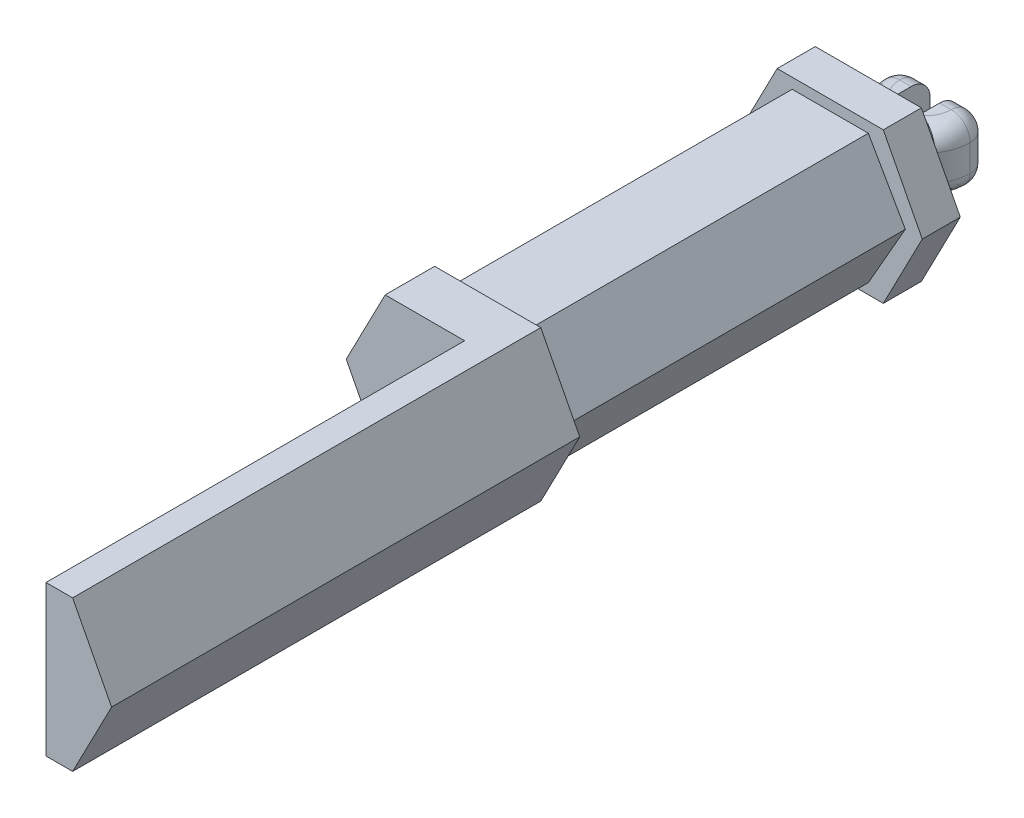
ISO-10303-21;
HEADER;
FILE_DESCRIPTION(('STEP AP214'),'2;1');
FILE_NAME('part.step','',(''),(''),'','','');
FILE_SCHEMA(('AUTOMOTIVE_DESIGN { 1 0 10303 214 1 1 1 1 }'));
ENDSEC;
DATA;
#1=APPLICATION_CONTEXT('core data for automotive mechanical design processes');
#2=APPLICATION_PROTOCOL_DEFINITION('international standard','automotive_design',2000,#1);
#3=PRODUCT_CONTEXT('',#1,'mechanical');
#4=PRODUCT('Part','Part','',(#3));
#5=PRODUCT_RELATED_PRODUCT_CATEGORY('part','',(#4));
#6=PRODUCT_DEFINITION_FORMATION('','',#4);
#7=PRODUCT_DEFINITION_CONTEXT('part definition',#1,'design');
#8=PRODUCT_DEFINITION('design','',#6,#7);
#9=PRODUCT_DEFINITION_SHAPE('','',#8);
#10=(LENGTH_UNIT() NAMED_UNIT(*) SI_UNIT(.MILLI.,.METRE.));
#11=(NAMED_UNIT(*) PLANE_ANGLE_UNIT() SI_UNIT($,.RADIAN.));
#12=(NAMED_UNIT(*) SI_UNIT($,.STERADIAN.) SOLID_ANGLE_UNIT());
#13=UNCERTAINTY_MEASURE_WITH_UNIT(LENGTH_MEASURE(1.E-05),#10,'distance_accuracy_value','');
#14=(GEOMETRIC_REPRESENTATION_CONTEXT(3) GLOBAL_UNCERTAINTY_ASSIGNED_CONTEXT((#13)) GLOBAL_UNIT_ASSIGNED_CONTEXT((#10,
#11,#12)) REPRESENTATION_CONTEXT('',''));
#15=CARTESIAN_POINT('',(0.,0.,0.));
#16=DIRECTION('',(0.,0.,1.));
#17=DIRECTION('',(1.,0.,0.));
#18=AXIS2_PLACEMENT_3D('',#15,#16,#17);
#19=CARTESIAN_POINT('',(-6.88166771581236,-3.95,0.));
#20=DIRECTION('',(0.,0.,1.));
#21=DIRECTION('',(1.,0.,0.));
#22=AXIS2_PLACEMENT_3D('',#19,#20,#21);
#23=PLANE('',#22);
#24=DIRECTION('',(-0.460063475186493,-0.887886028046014,0.));
#25=VECTOR('',#24,1.);
#26=CARTESIAN_POINT('',(-4.834951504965,0.,0.));
#27=LINE('',#26,#25);
#28=CARTESIAN_POINT('',(-2.78823529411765,3.95,0.));
#29=VERTEX_POINT('',#28);
#30=CARTESIAN_POINT('',(-4.834951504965,0.,0.));
#31=VERTEX_POINT('',#30);
#32=EDGE_CURVE('E1136',#29,#31,#27,.T.);
#33=ORIENTED_EDGE('',*,*,#32,.F.);
#34=DIRECTION('',(-1.,0.,0.));
#35=VECTOR('',#34,1.);
#36=CARTESIAN_POINT('',(-2.78823529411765,3.95,0.));
#37=LINE('',#36,#35);
#38=CARTESIAN_POINT('',(2.78823529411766,3.95,0.));
#39=VERTEX_POINT('',#38);
#40=EDGE_CURVE('E1147',#39,#29,#37,.T.);
#41=ORIENTED_EDGE('',*,*,#40,.F.);
#42=DIRECTION('',(-0.460063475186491,0.887886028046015,0.));
#43=VECTOR('',#42,1.);
#44=CARTESIAN_POINT('',(2.78823529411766,3.95,0.));
#45=LINE('',#44,#43);
#46=CARTESIAN_POINT('',(4.834951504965,0.,0.));
#47=VERTEX_POINT('',#46);
#48=EDGE_CURVE('E1145',#47,#39,#45,.T.);
#49=ORIENTED_EDGE('',*,*,#48,.F.);
#50=DIRECTION('',(0.460063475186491,0.887886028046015,0.));
#51=VECTOR('',#50,1.);
#52=CARTESIAN_POINT('',(4.834951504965,0.,0.));
#53=LINE('',#52,#51);
#54=CARTESIAN_POINT('',(2.78823529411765,-3.95000000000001,0.));
#55=VERTEX_POINT('',#54);
#56=EDGE_CURVE('E1143',#55,#47,#53,.T.);
#57=ORIENTED_EDGE('',*,*,#56,.F.);
#58=DIRECTION('',(1.,0.,0.));
#59=VECTOR('',#58,1.);
#60=CARTESIAN_POINT('',(2.78823529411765,-3.95000000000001,0.));
#61=LINE('',#60,#59);
#62=CARTESIAN_POINT('',(-2.78823529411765,-3.95000000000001,0.));
#63=VERTEX_POINT('',#62);
#64=EDGE_CURVE('E1141',#63,#55,#61,.T.);
#65=ORIENTED_EDGE('',*,*,#64,.F.);
#66=DIRECTION('',(0.460063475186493,-0.887886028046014,0.));
#67=VECTOR('',#66,1.);
#68=CARTESIAN_POINT('',(-2.78823529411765,-3.95000000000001,0.));
#69=LINE('',#68,#67);
#70=EDGE_CURVE('E1139',#31,#63,#69,.T.);
#71=ORIENTED_EDGE('',*,*,#70,.F.);
#72=EDGE_LOOP('',(#33,#41,#49,#57,#65,#71));
#73=FACE_BOUND('',#72,.T.);
#74=DIRECTION('',(0.,-1.,0.));
#75=VECTOR('',#74,1.);
#76=CARTESIAN_POINT('',(0.75,1.65,0.));
#77=LINE('',#76,#75);
#78=CARTESIAN_POINT('',(0.75,1.65,0.));
#79=VERTEX_POINT('',#78);
#80=CARTESIAN_POINT('',(0.75,-1.65,0.));
#81=VERTEX_POINT('',#80);
#82=EDGE_CURVE('E1753',#79,#81,#77,.T.);
#83=ORIENTED_EDGE('',*,*,#82,.T.);
#84=DIRECTION('',(1.,0.,0.));
#85=VECTOR('',#84,1.);
#86=CARTESIAN_POINT('',(1.9,-1.65,0.));
#87=LINE('',#86,#85);
#88=CARTESIAN_POINT('',(0.999999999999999,-1.65,0.));
#89=VERTEX_POINT('',#88);
#90=EDGE_CURVE('E357',#81,#89,#87,.T.);
#91=ORIENTED_EDGE('',*,*,#90,.T.);
#92=CARTESIAN_POINT('',(0.999999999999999,-1.65,0.));
#93=CARTESIAN_POINT('',(1.05063247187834,-1.65004300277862,0.));
#94=CARTESIAN_POINT('',(1.10125209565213,-1.64572982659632,0.));
#95=CARTESIAN_POINT('',(1.20102070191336,-1.62870844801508,0.));
#96=CARTESIAN_POINT('',(1.25017080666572,-1.61600683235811,0.));
#97=CARTESIAN_POINT('',(1.34566219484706,-1.58251695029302,0.));
#98=CARTESIAN_POINT('',(1.39200211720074,-1.56172480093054,0.));
#99=CARTESIAN_POINT('',(1.48052612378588,-1.51266221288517,0.));
#100=CARTESIAN_POINT('',(1.52271093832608,-1.48439309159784,0.));
#101=CARTESIAN_POINT('',(1.60173992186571,-1.42117094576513,0.));
#102=CARTESIAN_POINT('',(1.63858357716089,-1.38621727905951,0.));
#103=CARTESIAN_POINT('',(1.70587929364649,-1.31062004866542,0.));
#104=CARTESIAN_POINT('',(1.73633145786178,-1.26997657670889,0.));
#105=CARTESIAN_POINT('',(1.78998781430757,-1.18414578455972,0.));
#106=CARTESIAN_POINT('',(1.81318981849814,-1.13895709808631,0.));
#107=CARTESIAN_POINT('',(1.8516659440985,-1.0453347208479,0.));
#108=CARTESIAN_POINT('',(1.86694470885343,-0.996902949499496,0.));
#109=CARTESIAN_POINT('',(1.88534362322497,-0.915145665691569,0.));
#110=CARTESIAN_POINT('',(1.89083644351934,-0.88233446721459,0.));
#111=CARTESIAN_POINT('',(1.89816414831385,-0.816353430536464,0.));
#112=CARTESIAN_POINT('',(1.90000421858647,-0.783184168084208,0.));
#113=CARTESIAN_POINT('',(1.9,-0.75,0.));
#114=B_SPLINE_CURVE_WITH_KNOTS('',3,(#92,#93,#94,#95,#96,#97,#98,#99,#100,#101,#102,#103,#104,
#105,#106,#107,#108,#109,#110,#111,#112,#113),.UNSPECIFIED.,.F.,.F.,(4,2,2,2,2,2,2,2,2,2,4),(0.,
0.151695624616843,0.303272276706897,0.454921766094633,0.60654455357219,0.758181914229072,
0.909816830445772,1.06149746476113,1.2130891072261,1.31270313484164,1.41217563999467),.UNSPECIFIED.);
#115=CARTESIAN_POINT('',(1.9,-0.75,0.));
#116=VERTEX_POINT('',#115);
#117=EDGE_CURVE('E496',#89,#116,#114,.T.);
#118=ORIENTED_EDGE('',*,*,#117,.T.);
#119=DIRECTION('',(0.,-1.,0.));
#120=VECTOR('',#119,1.);
#121=CARTESIAN_POINT('',(1.9,1.65,0.));
#122=LINE('',#121,#120);
#123=CARTESIAN_POINT('',(1.9,0.65,0.));
#124=VERTEX_POINT('',#123);
#125=EDGE_CURVE('E1021',#124,#116,#122,.T.);
#126=ORIENTED_EDGE('',*,*,#125,.F.);
#127=CARTESIAN_POINT('',(1.9,0.65,0.));
#128=CARTESIAN_POINT('',(1.89999979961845,0.678134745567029,0.));
#129=CARTESIAN_POINT('',(1.89881190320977,0.70625600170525,0.));
#130=CARTESIAN_POINT('',(1.89407288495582,0.76229731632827,0.));
#131=CARTESIAN_POINT('',(1.89052187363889,0.790217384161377,0.));
#132=CARTESIAN_POINT('',(1.87635784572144,0.873326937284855,0.));
#133=CARTESIAN_POINT('',(1.86223374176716,0.927959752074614,0.));
#134=CARTESIAN_POINT('',(1.82501490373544,1.0340769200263,0.));
#135=CARTESIAN_POINT('',(1.8019158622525,1.08555974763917,0.));
#136=CARTESIAN_POINT('',(1.74740304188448,1.18391607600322,0.));
#137=CARTESIAN_POINT('',(1.71599072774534,1.23079038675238,0.));
#138=CARTESIAN_POINT('',(1.64574709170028,1.31859945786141,0.));
#139=CARTESIAN_POINT('',(1.60691505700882,1.35953364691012,0.));
#140=CARTESIAN_POINT('',(1.52290419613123,1.43431398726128,0.));
#141=CARTESIAN_POINT('',(1.4777254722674,1.46816025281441,0.));
#142=CARTESIAN_POINT('',(1.40621099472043,1.51287025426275,0.));
#143=CARTESIAN_POINT('',(1.38172690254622,1.52677256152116,0.));
#144=CARTESIAN_POINT('',(1.3316995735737,1.55245538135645,0.));
#145=CARTESIAN_POINT('',(1.30615729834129,1.56423777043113,0.));
#146=CARTESIAN_POINT('',(1.22817962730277,1.5962808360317,0.));
#147=CARTESIAN_POINT('',(1.17434360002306,1.61326847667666,0.));
#148=CARTESIAN_POINT('',(1.08349059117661,1.6337173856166,0.));
#149=CARTESIAN_POINT('',(1.04703600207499,1.63981939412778,0.));
#150=CARTESIAN_POINT('',(0.973728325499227,1.64795904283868,0.));
#151=CARTESIAN_POINT('',(0.936875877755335,1.65000244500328,0.));
#152=CARTESIAN_POINT('',(0.9,1.65,0.));
#153=B_SPLINE_CURVE_WITH_KNOTS('',3,(#127,#128,#129,#130,#131,#132,#133,#134,#135,#136,#137,
#138,#139,#140,#141,#142,#143,#144,#145,#146,#147,#148,#149,#150,#151,#152),.UNSPECIFIED.,.F.,
.F.,(4,2,2,2,2,2,2,2,2,2,2,2,4),(0.,0.0843523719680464,0.16870079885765,0.337119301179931,
0.505618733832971,0.674088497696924,0.842574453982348,1.01105769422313,1.095437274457,
1.17974179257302,1.34817695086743,1.45885920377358,1.56938420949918),.UNSPECIFIED.);
#154=CARTESIAN_POINT('',(0.9,1.65,0.));
#155=VERTEX_POINT('',#154);
#156=EDGE_CURVE('E786',#124,#155,#153,.T.);
#157=ORIENTED_EDGE('',*,*,#156,.T.);
#158=DIRECTION('',(1.,0.,0.));
#159=VECTOR('',#158,1.);
#160=CARTESIAN_POINT('',(1.9,1.65,0.));
#161=LINE('',#160,#159);
#162=EDGE_CURVE('E1757',#79,#155,#161,.T.);
#163=ORIENTED_EDGE('',*,*,#162,.F.);
#164=EDGE_LOOP('',(#83,#91,#118,#126,#157,#163));
#165=FACE_BOUND('',#164,.T.);
#166=DIRECTION('',(1.,0.,0.));
#167=VECTOR('',#166,1.);
#168=CARTESIAN_POINT('',(-2.,1.65,0.));
#169=LINE('',#168,#167);
#170=CARTESIAN_POINT('',(-1.,1.65,0.));
#171=VERTEX_POINT('',#170);
#172=CARTESIAN_POINT('',(-0.75,1.65,0.));
#173=VERTEX_POINT('',#172);
#174=EDGE_CURVE('E301',#171,#173,#169,.T.);
#175=ORIENTED_EDGE('',*,*,#174,.F.);
#176=CARTESIAN_POINT('',(-1.,1.65,0.));
#177=CARTESIAN_POINT('',(-1.02813474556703,1.64999979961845,0.));
#178=CARTESIAN_POINT('',(-1.05625600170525,1.64881190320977,0.));
#179=CARTESIAN_POINT('',(-1.11229731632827,1.64407288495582,0.));
#180=CARTESIAN_POINT('',(-1.14021738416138,1.6405218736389,0.));
#181=CARTESIAN_POINT('',(-1.22332693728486,1.62635784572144,0.));
#182=CARTESIAN_POINT('',(-1.27795975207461,1.61223374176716,0.));
#183=CARTESIAN_POINT('',(-1.3840769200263,1.57501490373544,0.));
#184=CARTESIAN_POINT('',(-1.43555974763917,1.5519158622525,0.));
#185=CARTESIAN_POINT('',(-1.53391607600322,1.49740304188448,0.));
#186=CARTESIAN_POINT('',(-1.58079038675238,1.46599072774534,0.));
#187=CARTESIAN_POINT('',(-1.66859945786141,1.39574709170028,0.));
#188=CARTESIAN_POINT('',(-1.70953364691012,1.35691505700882,0.));
#189=CARTESIAN_POINT('',(-1.78431398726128,1.27290419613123,0.));
#190=CARTESIAN_POINT('',(-1.81816025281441,1.2277254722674,0.));
#191=CARTESIAN_POINT('',(-1.86287025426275,1.15621099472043,0.));
#192=CARTESIAN_POINT('',(-1.87677256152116,1.13172690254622,0.));
#193=CARTESIAN_POINT('',(-1.90245538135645,1.0816995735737,0.));
#194=CARTESIAN_POINT('',(-1.91423777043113,1.05615729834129,0.));
#195=CARTESIAN_POINT('',(-1.9462808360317,0.978179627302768,0.));
#196=CARTESIAN_POINT('',(-1.96326847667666,0.924343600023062,0.));
#197=CARTESIAN_POINT('',(-1.9837173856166,0.833490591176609,0.));
#198=CARTESIAN_POINT('',(-1.98981939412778,0.797036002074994,0.));
#199=CARTESIAN_POINT('',(-1.99795904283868,0.723728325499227,0.));
#200=CARTESIAN_POINT('',(-2.00000244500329,0.686875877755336,0.));
#201=CARTESIAN_POINT('',(-2.,0.65,0.));
#202=B_SPLINE_CURVE_WITH_KNOTS('',3,(#176,#177,#178,#179,#180,#181,#182,#183,#184,#185,#186,
#187,#188,#189,#190,#191,#192,#193,#194,#195,#196,#197,#198,#199,#200,#201),.UNSPECIFIED.,.F.,
.F.,(4,2,2,2,2,2,2,2,2,2,2,2,4),(0.,0.0843523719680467,0.16870079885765,0.337119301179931,
0.505618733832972,0.674088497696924,0.842574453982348,1.01105769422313,1.095437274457,
1.17974179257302,1.34817695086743,1.45885920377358,1.56938420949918),.UNSPECIFIED.);
#203=CARTESIAN_POINT('',(-2.,0.65,0.));
#204=VERTEX_POINT('',#203);
#205=EDGE_CURVE('E436',#171,#204,#202,.T.);
#206=ORIENTED_EDGE('',*,*,#205,.T.);
#207=DIRECTION('',(0.,-1.,0.));
#208=VECTOR('',#207,1.);
#209=CARTESIAN_POINT('',(-2.,1.65,0.));
#210=LINE('',#209,#208);
#211=CARTESIAN_POINT('',(-2.,-0.75,0.));
#212=VERTEX_POINT('',#211);
#213=EDGE_CURVE('E325',#204,#212,#210,.T.);
#214=ORIENTED_EDGE('',*,*,#213,.T.);
#215=CARTESIAN_POINT('',(-2.,-0.75,0.));
#216=CARTESIAN_POINT('',(-2.00004300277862,-0.80063247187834,0.));
#217=CARTESIAN_POINT('',(-1.99572982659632,-0.851252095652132,0.));
#218=CARTESIAN_POINT('',(-1.97870844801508,-0.951020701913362,0.));
#219=CARTESIAN_POINT('',(-1.96600683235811,-1.00017080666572,0.));
#220=CARTESIAN_POINT('',(-1.93251695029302,-1.09566219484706,0.));
#221=CARTESIAN_POINT('',(-1.91172480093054,-1.14200211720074,0.));
#222=CARTESIAN_POINT('',(-1.86266221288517,-1.23052612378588,0.));
#223=CARTESIAN_POINT('',(-1.83439309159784,-1.27271093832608,0.));
#224=CARTESIAN_POINT('',(-1.77117094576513,-1.35173992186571,0.));
#225=CARTESIAN_POINT('',(-1.73621727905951,-1.38858357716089,0.));
#226=CARTESIAN_POINT('',(-1.66062004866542,-1.45587929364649,0.));
#227=CARTESIAN_POINT('',(-1.61997657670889,-1.48633145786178,0.));
#228=CARTESIAN_POINT('',(-1.53414578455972,-1.53998781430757,0.));
#229=CARTESIAN_POINT('',(-1.48895709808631,-1.56318981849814,0.));
#230=CARTESIAN_POINT('',(-1.3953347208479,-1.6016659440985,0.));
#231=CARTESIAN_POINT('',(-1.3469029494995,-1.61694470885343,0.));
#232=CARTESIAN_POINT('',(-1.26514566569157,-1.63534362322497,0.));
#233=CARTESIAN_POINT('',(-1.23233446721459,-1.64083644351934,0.));
#234=CARTESIAN_POINT('',(-1.16635343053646,-1.64816414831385,0.));
#235=CARTESIAN_POINT('',(-1.13318416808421,-1.65000421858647,0.));
#236=CARTESIAN_POINT('',(-1.1,-1.65,0.));
#237=B_SPLINE_CURVE_WITH_KNOTS('',3,(#215,#216,#217,#218,#219,#220,#221,#222,#223,#224,#225,
#226,#227,#228,#229,#230,#231,#232,#233,#234,#235,#236),.UNSPECIFIED.,.F.,.F.,(4,2,2,2,2,2,2,2,
2,2,4),(0.,0.151695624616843,0.303272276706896,0.454921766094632,0.60654455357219,
0.758181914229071,0.909816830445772,1.06149746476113,1.2130891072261,1.31270313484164,
1.41217563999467),.UNSPECIFIED.);
#238=CARTESIAN_POINT('',(-1.1,-1.65,0.));
#239=VERTEX_POINT('',#238);
#240=EDGE_CURVE('E11',#212,#239,#237,.T.);
#241=ORIENTED_EDGE('',*,*,#240,.T.);
#242=DIRECTION('',(1.,0.,0.));
#243=VECTOR('',#242,1.);
#244=CARTESIAN_POINT('',(-2.,-1.65,0.));
#245=LINE('',#244,#243);
#246=CARTESIAN_POINT('',(-0.75,-1.65,0.));
#247=VERTEX_POINT('',#246);
#248=EDGE_CURVE('E323',#239,#247,#245,.T.);
#249=ORIENTED_EDGE('',*,*,#248,.T.);
#250=DIRECTION('',(0.,-1.,0.));
#251=VECTOR('',#250,1.);
#252=CARTESIAN_POINT('',(-0.75,1.65,0.));
#253=LINE('',#252,#251);
#254=EDGE_CURVE('E316',#173,#247,#253,.T.);
#255=ORIENTED_EDGE('',*,*,#254,.F.);
#256=EDGE_LOOP('',(#175,#206,#214,#241,#249,#255));
#257=FACE_BOUND('',#256,.T.);
#258=ADVANCED_FACE('F30',(#73,#165,#257),#23,.F.);
#259=CARTESIAN_POINT('',(-4.834951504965,0.,44.6));
#260=DIRECTION('',(0.887886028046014,-0.460063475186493,0.));
#261=DIRECTION('',(0.460063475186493,0.887886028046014,0.));
#262=AXIS2_PLACEMENT_3D('',#259,#260,#261);
#263=PLANE('',#262);
#264=DIRECTION('',(-0.460063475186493,-0.887886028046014,0.));
#265=VECTOR('',#264,1.);
#266=CARTESIAN_POINT('',(-4.834951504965,0.,22.6));
#267=LINE('',#266,#265);
#268=CARTESIAN_POINT('',(-2.78823529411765,3.95,22.6));
#269=VERTEX_POINT('',#268);
#270=CARTESIAN_POINT('',(-4.834951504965,0.,22.6));
#271=VERTEX_POINT('',#270);
#272=EDGE_CURVE('E1037',#269,#271,#267,.T.);
#273=ORIENTED_EDGE('',*,*,#272,.F.);
#274=DIRECTION('',(0.,0.,-1.));
#275=VECTOR('',#274,1.);
#276=CARTESIAN_POINT('',(-2.78823529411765,3.95,44.6));
#277=LINE('',#276,#275);
#278=CARTESIAN_POINT('',(-2.78823529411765,3.95,20.));
#279=VERTEX_POINT('',#278);
#280=EDGE_CURVE('E1067',#269,#279,#277,.T.);
#281=ORIENTED_EDGE('',*,*,#280,.T.);
#282=DIRECTION('',(-0.460063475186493,-0.887886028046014,0.));
#283=VECTOR('',#282,1.);
#284=CARTESIAN_POINT('',(-4.834951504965,0.,20.));
#285=LINE('',#284,#283);
#286=CARTESIAN_POINT('',(-4.834951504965,0.,20.));
#287=VERTEX_POINT('',#286);
#288=EDGE_CURVE('E1043',#279,#287,#285,.T.);
#289=ORIENTED_EDGE('',*,*,#288,.T.);
#290=DIRECTION('',(0.,0.,-1.));
#291=VECTOR('',#290,1.);
#292=CARTESIAN_POINT('',(-4.834951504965,0.,44.6));
#293=LINE('',#292,#291);
#294=EDGE_CURVE('E1080',#271,#287,#293,.T.);
#295=ORIENTED_EDGE('',*,*,#294,.F.);
#296=EDGE_LOOP('',(#273,#281,#289,#295));
#297=FACE_BOUND('',#296,.T.);
#298=ADVANCED_FACE('F803',(#297),#263,.F.);
#299=CARTESIAN_POINT('',(-2.78823529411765,-3.94999999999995,44.6));
#300=DIRECTION('',(0.887886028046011,0.460063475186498,0.));
#301=DIRECTION('',(-0.460063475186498,0.887886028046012,0.));
#302=AXIS2_PLACEMENT_3D('',#299,#300,#301);
#303=PLANE('',#302);
#304=DIRECTION('',(0.460063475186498,-0.887886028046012,0.));
#305=VECTOR('',#304,1.);
#306=CARTESIAN_POINT('',(-2.78823529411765,-3.94999999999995,22.6));
#307=LINE('',#306,#305);
#308=CARTESIAN_POINT('',(-2.78823529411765,-3.94999999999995,22.6));
#309=VERTEX_POINT('',#308);
#310=EDGE_CURVE('E1039',#271,#309,#307,.T.);
#311=ORIENTED_EDGE('',*,*,#310,.F.);
#312=ORIENTED_EDGE('',*,*,#294,.T.);
#313=DIRECTION('',(0.460063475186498,-0.887886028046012,0.));
#314=VECTOR('',#313,1.);
#315=CARTESIAN_POINT('',(-2.78823529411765,-3.94999999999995,20.));
#316=LINE('',#315,#314);
#317=CARTESIAN_POINT('',(-2.78823529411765,-3.94999999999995,20.));
#318=VERTEX_POINT('',#317);
#319=EDGE_CURVE('E1046',#287,#318,#316,.T.);
#320=ORIENTED_EDGE('',*,*,#319,.T.);
#321=DIRECTION('',(0.,0.,-1.));
#322=VECTOR('',#321,1.);
#323=CARTESIAN_POINT('',(-2.78823529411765,-3.94999999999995,44.6));
#324=LINE('',#323,#322);
#325=EDGE_CURVE('E1078',#309,#318,#324,.T.);
#326=ORIENTED_EDGE('',*,*,#325,.F.);
#327=EDGE_LOOP('',(#311,#312,#320,#326));
#328=FACE_BOUND('',#327,.T.);
#329=ADVANCED_FACE('F1569',(#328),#303,.F.);
#330=CARTESIAN_POINT('',(-4.834951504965,0.,2.));
#331=DIRECTION('',(0.887886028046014,-0.460063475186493,0.));
#332=DIRECTION('',(0.460063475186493,0.887886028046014,0.));
#333=AXIS2_PLACEMENT_3D('',#330,#331,#332);
#334=PLANE('',#333);
#335=ORIENTED_EDGE('',*,*,#32,.T.);
#336=DIRECTION('',(0.,0.,-1.));
#337=VECTOR('',#336,1.);
#338=CARTESIAN_POINT('',(-4.834951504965,0.,2.));
#339=LINE('',#338,#337);
#340=CARTESIAN_POINT('',(-4.834951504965,0.,2.));
#341=VERTEX_POINT('',#340);
#342=EDGE_CURVE('E1177',#341,#31,#339,.T.);
#343=ORIENTED_EDGE('',*,*,#342,.F.);
#344=DIRECTION('',(-0.460063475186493,-0.887886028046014,0.));
#345=VECTOR('',#344,1.);
#346=CARTESIAN_POINT('',(-4.834951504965,0.,2.));
#347=LINE('',#346,#345);
#348=CARTESIAN_POINT('',(-2.78823529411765,3.95,2.));
#349=VERTEX_POINT('',#348);
#350=EDGE_CURVE('E1149',#349,#341,#347,.T.);
#351=ORIENTED_EDGE('',*,*,#350,.F.);
#352=DIRECTION('',(0.,0.,-1.));
#353=VECTOR('',#352,1.);
#354=CARTESIAN_POINT('',(-2.78823529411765,3.95,2.));
#355=LINE('',#354,#353);
#356=EDGE_CURVE('E1162',#349,#29,#355,.T.);
#357=ORIENTED_EDGE('',*,*,#356,.T.);
#358=EDGE_LOOP('',(#335,#343,#351,#357));
#359=FACE_BOUND('',#358,.T.);
#360=ADVANCED_FACE('F32',(#359),#334,.F.);
#361=CARTESIAN_POINT('',(-2.78823529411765,-3.95000000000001,2.));
#362=DIRECTION('',(0.887886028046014,0.460063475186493,0.));
#363=DIRECTION('',(-0.460063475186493,0.887886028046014,0.));
#364=AXIS2_PLACEMENT_3D('',#361,#362,#363);
#365=PLANE('',#364);
#366=ORIENTED_EDGE('',*,*,#70,.T.);
#367=DIRECTION('',(0.,0.,-1.));
#368=VECTOR('',#367,1.);
#369=CARTESIAN_POINT('',(-2.78823529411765,-3.95000000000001,2.));
#370=LINE('',#369,#368);
#371=CARTESIAN_POINT('',(-2.78823529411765,-3.95000000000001,2.));
#372=VERTEX_POINT('',#371);
#373=EDGE_CURVE('E1174',#372,#63,#370,.T.);
#374=ORIENTED_EDGE('',*,*,#373,.F.);
#375=DIRECTION('',(0.460063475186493,-0.887886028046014,0.));
#376=VECTOR('',#375,1.);
#377=CARTESIAN_POINT('',(-2.78823529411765,-3.95000000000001,2.));
#378=LINE('',#377,#376);
#379=EDGE_CURVE('E1152',#341,#372,#378,.T.);
#380=ORIENTED_EDGE('',*,*,#379,.F.);
#381=ORIENTED_EDGE('',*,*,#342,.T.);
#382=EDGE_LOOP('',(#366,#374,#380,#381));
#383=FACE_BOUND('',#382,.T.);
#384=ADVANCED_FACE('F1555',(#383),#365,.F.);
#385=CARTESIAN_POINT('',(2.78823529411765,-3.95000000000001,2.));
#386=DIRECTION('',(0.,1.,0.));
#387=DIRECTION('',(-1.,0.,0.));
#388=AXIS2_PLACEMENT_3D('',#385,#386,#387);
#389=PLANE('',#388);
#390=ORIENTED_EDGE('',*,*,#64,.T.);
#391=DIRECTION('',(0.,0.,-1.));
#392=VECTOR('',#391,1.);
#393=CARTESIAN_POINT('',(2.78823529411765,-3.95000000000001,2.));
#394=LINE('',#393,#392);
#395=CARTESIAN_POINT('',(2.78823529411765,-3.95000000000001,2.));
#396=VERTEX_POINT('',#395);
#397=EDGE_CURVE('E1171',#396,#55,#394,.T.);
#398=ORIENTED_EDGE('',*,*,#397,.F.);
#399=DIRECTION('',(1.,0.,0.));
#400=VECTOR('',#399,1.);
#401=CARTESIAN_POINT('',(2.78823529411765,-3.95000000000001,2.));
#402=LINE('',#401,#400);
#403=EDGE_CURVE('E1154',#372,#396,#402,.T.);
#404=ORIENTED_EDGE('',*,*,#403,.F.);
#405=ORIENTED_EDGE('',*,*,#373,.T.);
#406=EDGE_LOOP('',(#390,#398,#404,#405));
#407=FACE_BOUND('',#406,.T.);
#408=ADVANCED_FACE('F1547',(#407),#389,.F.);
#409=CARTESIAN_POINT('',(4.834951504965,0.,2.));
#410=DIRECTION('',(-0.887886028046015,0.460063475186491,0.));
#411=DIRECTION('',(-0.460063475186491,-0.887886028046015,0.));
#412=AXIS2_PLACEMENT_3D('',#409,#410,#411);
#413=PLANE('',#412);
#414=ORIENTED_EDGE('',*,*,#56,.T.);
#415=DIRECTION('',(0.,0.,-1.));
#416=VECTOR('',#415,1.);
#417=CARTESIAN_POINT('',(4.834951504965,0.,2.));
#418=LINE('',#417,#416);
#419=CARTESIAN_POINT('',(4.834951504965,0.,2.));
#420=VERTEX_POINT('',#419);
#421=EDGE_CURVE('E1168',#420,#47,#418,.T.);
#422=ORIENTED_EDGE('',*,*,#421,.F.);
#423=DIRECTION('',(0.460063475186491,0.887886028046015,0.));
#424=VECTOR('',#423,1.);
#425=CARTESIAN_POINT('',(4.834951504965,0.,2.));
#426=LINE('',#425,#424);
#427=EDGE_CURVE('E1156',#396,#420,#426,.T.);
#428=ORIENTED_EDGE('',*,*,#427,.F.);
#429=ORIENTED_EDGE('',*,*,#397,.T.);
#430=EDGE_LOOP('',(#414,#422,#428,#429));
#431=FACE_BOUND('',#430,.T.);
#432=ADVANCED_FACE('F1539',(#431),#413,.F.);
#433=CARTESIAN_POINT('',(2.78823529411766,3.95,2.));
#434=DIRECTION('',(-0.887886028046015,-0.460063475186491,0.));
#435=DIRECTION('',(0.460063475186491,-0.887886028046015,0.));
#436=AXIS2_PLACEMENT_3D('',#433,#434,#435);
#437=PLANE('',#436);
#438=ORIENTED_EDGE('',*,*,#48,.T.);
#439=DIRECTION('',(0.,0.,-1.));
#440=VECTOR('',#439,1.);
#441=CARTESIAN_POINT('',(2.78823529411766,3.95,2.));
#442=LINE('',#441,#440);
#443=CARTESIAN_POINT('',(2.78823529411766,3.95,2.));
#444=VERTEX_POINT('',#443);
#445=EDGE_CURVE('E1165',#444,#39,#442,.T.);
#446=ORIENTED_EDGE('',*,*,#445,.F.);
#447=DIRECTION('',(-0.460063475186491,0.887886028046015,0.));
#448=VECTOR('',#447,1.);
#449=CARTESIAN_POINT('',(2.78823529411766,3.95,2.));
#450=LINE('',#449,#448);
#451=EDGE_CURVE('E1158',#420,#444,#450,.T.);
#452=ORIENTED_EDGE('',*,*,#451,.F.);
#453=ORIENTED_EDGE('',*,*,#421,.T.);
#454=EDGE_LOOP('',(#438,#446,#452,#453));
#455=FACE_BOUND('',#454,.T.);
#456=ADVANCED_FACE('F1532',(#455),#437,.F.);
#457=CARTESIAN_POINT('',(-2.78823529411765,3.95,2.));
#458=DIRECTION('',(0.,-1.,0.));
#459=DIRECTION('',(1.,0.,0.));
#460=AXIS2_PLACEMENT_3D('',#457,#458,#459);
#461=PLANE('',#460);
#462=ORIENTED_EDGE('',*,*,#40,.T.);
#463=ORIENTED_EDGE('',*,*,#356,.F.);
#464=DIRECTION('',(-1.,0.,0.));
#465=VECTOR('',#464,1.);
#466=CARTESIAN_POINT('',(-2.78823529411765,3.95,2.));
#467=LINE('',#466,#465);
#468=EDGE_CURVE('E1160',#444,#349,#467,.T.);
#469=ORIENTED_EDGE('',*,*,#468,.F.);
#470=ORIENTED_EDGE('',*,*,#445,.T.);
#471=EDGE_LOOP('',(#462,#463,#469,#470));
#472=FACE_BOUND('',#471,.T.);
#473=ADVANCED_FACE('F1525',(#472),#461,.F.);
#474=CARTESIAN_POINT('',(-6.88166771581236,-3.95,2.));
#475=DIRECTION('',(0.,0.,1.));
#476=DIRECTION('',(1.,0.,0.));
#477=AXIS2_PLACEMENT_3D('',#474,#475,#476);
#478=PLANE('',#477);
#479=DIRECTION('',(-0.496477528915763,-0.868049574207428,0.));
#480=VECTOR('',#479,1.);
#481=CARTESIAN_POINT('',(-3.9446165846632,0.,2.));
#482=LINE('',#481,#480);
#483=CARTESIAN_POINT('',(-2.,3.4,2.));
#484=VERTEX_POINT('',#483);
#485=CARTESIAN_POINT('',(-3.9446165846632,0.,2.));
#486=VERTEX_POINT('',#485);
#487=EDGE_CURVE('E1082',#484,#486,#482,.T.);
#488=ORIENTED_EDGE('',*,*,#487,.F.);
#489=DIRECTION('',(-1.,0.,0.));
#490=VECTOR('',#489,1.);
#491=CARTESIAN_POINT('',(-2.,3.4,2.));
#492=LINE('',#491,#490);
#493=CARTESIAN_POINT('',(2.,3.4,2.));
#494=VERTEX_POINT('',#493);
#495=EDGE_CURVE('E1097',#494,#484,#492,.T.);
#496=ORIENTED_EDGE('',*,*,#495,.F.);
#497=DIRECTION('',(-0.496477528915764,0.868049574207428,0.));
#498=VECTOR('',#497,1.);
#499=CARTESIAN_POINT('',(2.,3.4,2.));
#500=LINE('',#499,#498);
#501=CARTESIAN_POINT('',(3.9446165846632,0.,2.));
#502=VERTEX_POINT('',#501);
#503=EDGE_CURVE('E1094',#502,#494,#500,.T.);
#504=ORIENTED_EDGE('',*,*,#503,.F.);
#505=DIRECTION('',(0.496477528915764,0.868049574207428,0.));
#506=VECTOR('',#505,1.);
#507=CARTESIAN_POINT('',(3.9446165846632,0.,2.));
#508=LINE('',#507,#506);
#509=CARTESIAN_POINT('',(2.,-3.4,2.));
#510=VERTEX_POINT('',#509);
#511=EDGE_CURVE('E1091',#510,#502,#508,.T.);
#512=ORIENTED_EDGE('',*,*,#511,.F.);
#513=DIRECTION('',(1.,0.,0.));
#514=VECTOR('',#513,1.);
#515=CARTESIAN_POINT('',(2.,-3.4,2.));
#516=LINE('',#515,#514);
#517=CARTESIAN_POINT('',(-2.,-3.4,2.));
#518=VERTEX_POINT('',#517);
#519=EDGE_CURVE('E1088',#518,#510,#516,.T.);
#520=ORIENTED_EDGE('',*,*,#519,.F.);
#521=DIRECTION('',(0.496477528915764,-0.868049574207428,0.));
#522=VECTOR('',#521,1.);
#523=CARTESIAN_POINT('',(-2.,-3.4,2.));
#524=LINE('',#523,#522);
#525=EDGE_CURVE('E1085',#486,#518,#524,.T.);
#526=ORIENTED_EDGE('',*,*,#525,.F.);
#527=EDGE_LOOP('',(#488,#496,#504,#512,#520,#526));
#528=FACE_BOUND('',#527,.T.);
#529=ORIENTED_EDGE('',*,*,#350,.T.);
#530=ORIENTED_EDGE('',*,*,#379,.T.);
#531=ORIENTED_EDGE('',*,*,#403,.T.);
#532=ORIENTED_EDGE('',*,*,#427,.T.);
#533=ORIENTED_EDGE('',*,*,#451,.T.);
#534=ORIENTED_EDGE('',*,*,#468,.T.);
#535=EDGE_LOOP('',(#529,#530,#531,#532,#533,#534));
#536=FACE_BOUND('',#535,.T.);
#537=ADVANCED_FACE('F807',(#528,#536),#478,.T.);
#538=CARTESIAN_POINT('',(-3.9446165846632,0.,20.));
#539=DIRECTION('',(0.868049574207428,-0.496477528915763,0.));
#540=DIRECTION('',(0.496477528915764,0.868049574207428,0.));
#541=AXIS2_PLACEMENT_3D('',#538,#539,#540);
#542=PLANE('',#541);
#543=ORIENTED_EDGE('',*,*,#487,.T.);
#544=DIRECTION('',(0.,0.,-1.));
#545=VECTOR('',#544,1.);
#546=CARTESIAN_POINT('',(-3.9446165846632,0.,20.));
#547=LINE('',#546,#545);
#548=CARTESIAN_POINT('',(-3.9446165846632,0.,20.));
#549=VERTEX_POINT('',#548);
#550=EDGE_CURVE('E1133',#549,#486,#547,.T.);
#551=ORIENTED_EDGE('',*,*,#550,.F.);
#552=DIRECTION('',(-0.496477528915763,-0.868049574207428,0.));
#553=VECTOR('',#552,1.);
#554=CARTESIAN_POINT('',(-3.9446165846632,0.,20.));
#555=LINE('',#554,#553);
#556=CARTESIAN_POINT('',(-2.,3.4,20.));
#557=VERTEX_POINT('',#556);
#558=EDGE_CURVE('E1100',#557,#549,#555,.T.);
#559=ORIENTED_EDGE('',*,*,#558,.F.);
#560=DIRECTION('',(0.,0.,-1.));
#561=VECTOR('',#560,1.);
#562=CARTESIAN_POINT('',(-2.,3.4,20.));
#563=LINE('',#562,#561);
#564=EDGE_CURVE('E1118',#557,#484,#563,.T.);
#565=ORIENTED_EDGE('',*,*,#564,.T.);
#566=EDGE_LOOP('',(#543,#551,#559,#565));
#567=FACE_BOUND('',#566,.T.);
#568=ADVANCED_FACE('F805',(#567),#542,.F.);
#569=CARTESIAN_POINT('',(-2.,-3.4,20.));
#570=DIRECTION('',(0.868049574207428,0.496477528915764,0.));
#571=DIRECTION('',(-0.496477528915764,0.868049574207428,0.));
#572=AXIS2_PLACEMENT_3D('',#569,#570,#571);
#573=PLANE('',#572);
#574=ORIENTED_EDGE('',*,*,#525,.T.);
#575=DIRECTION('',(0.,0.,-1.));
#576=VECTOR('',#575,1.);
#577=CARTESIAN_POINT('',(-2.,-3.4,20.));
#578=LINE('',#577,#576);
#579=CARTESIAN_POINT('',(-2.,-3.4,20.));
#580=VERTEX_POINT('',#579);
#581=EDGE_CURVE('E1130',#580,#518,#578,.T.);
#582=ORIENTED_EDGE('',*,*,#581,.F.);
#583=DIRECTION('',(0.496477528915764,-0.868049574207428,0.));
#584=VECTOR('',#583,1.);
#585=CARTESIAN_POINT('',(-2.,-3.4,20.));
#586=LINE('',#585,#584);
#587=EDGE_CURVE('E1103',#549,#580,#586,.T.);
#588=ORIENTED_EDGE('',*,*,#587,.F.);
#589=ORIENTED_EDGE('',*,*,#550,.T.);
#590=EDGE_LOOP('',(#574,#582,#588,#589));
#591=FACE_BOUND('',#590,.T.);
#592=ADVANCED_FACE('F1505',(#591),#573,.F.);
#593=CARTESIAN_POINT('',(2.,-3.4,20.));
#594=DIRECTION('',(0.,1.,0.));
#595=DIRECTION('',(-1.,0.,0.));
#596=AXIS2_PLACEMENT_3D('',#593,#594,#595);
#597=PLANE('',#596);
#598=ORIENTED_EDGE('',*,*,#519,.T.);
#599=DIRECTION('',(0.,0.,-1.));
#600=VECTOR('',#599,1.);
#601=CARTESIAN_POINT('',(2.,-3.4,20.));
#602=LINE('',#601,#600);
#603=CARTESIAN_POINT('',(2.,-3.4,20.));
#604=VERTEX_POINT('',#603);
#605=EDGE_CURVE('E1127',#604,#510,#602,.T.);
#606=ORIENTED_EDGE('',*,*,#605,.F.);
#607=DIRECTION('',(1.,0.,0.));
#608=VECTOR('',#607,1.);
#609=CARTESIAN_POINT('',(2.,-3.4,20.));
#610=LINE('',#609,#608);
#611=EDGE_CURVE('E1106',#580,#604,#610,.T.);
#612=ORIENTED_EDGE('',*,*,#611,.F.);
#613=ORIENTED_EDGE('',*,*,#581,.T.);
#614=EDGE_LOOP('',(#598,#606,#612,#613));
#615=FACE_BOUND('',#614,.T.);
#616=ADVANCED_FACE('F1497',(#615),#597,.F.);
#617=CARTESIAN_POINT('',(3.9446165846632,0.,20.));
#618=DIRECTION('',(-0.868049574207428,0.496477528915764,0.));
#619=DIRECTION('',(-0.496477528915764,-0.868049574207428,0.));
#620=AXIS2_PLACEMENT_3D('',#617,#618,#619);
#621=PLANE('',#620);
#622=ORIENTED_EDGE('',*,*,#511,.T.);
#623=DIRECTION('',(0.,0.,-1.));
#624=VECTOR('',#623,1.);
#625=CARTESIAN_POINT('',(3.9446165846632,0.,20.));
#626=LINE('',#625,#624);
#627=CARTESIAN_POINT('',(3.9446165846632,0.,20.));
#628=VERTEX_POINT('',#627);
#629=EDGE_CURVE('E1124',#628,#502,#626,.T.);
#630=ORIENTED_EDGE('',*,*,#629,.F.);
#631=DIRECTION('',(0.496477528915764,0.868049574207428,0.));
#632=VECTOR('',#631,1.);
#633=CARTESIAN_POINT('',(3.9446165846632,0.,20.));
#634=LINE('',#633,#632);
#635=EDGE_CURVE('E1109',#604,#628,#634,.T.);
#636=ORIENTED_EDGE('',*,*,#635,.F.);
#637=ORIENTED_EDGE('',*,*,#605,.T.);
#638=EDGE_LOOP('',(#622,#630,#636,#637));
#639=FACE_BOUND('',#638,.T.);
#640=ADVANCED_FACE('F1489',(#639),#621,.F.);
#641=CARTESIAN_POINT('',(2.,3.4,20.));
#642=DIRECTION('',(-0.868049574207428,-0.496477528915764,0.));
#643=DIRECTION('',(0.496477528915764,-0.868049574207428,0.));
#644=AXIS2_PLACEMENT_3D('',#641,#642,#643);
#645=PLANE('',#644);
#646=ORIENTED_EDGE('',*,*,#503,.T.);
#647=DIRECTION('',(0.,0.,-1.));
#648=VECTOR('',#647,1.);
#649=CARTESIAN_POINT('',(2.,3.4,20.));
#650=LINE('',#649,#648);
#651=CARTESIAN_POINT('',(2.,3.4,20.));
#652=VERTEX_POINT('',#651);
#653=EDGE_CURVE('E1121',#652,#494,#650,.T.);
#654=ORIENTED_EDGE('',*,*,#653,.F.);
#655=DIRECTION('',(-0.496477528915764,0.868049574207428,0.));
#656=VECTOR('',#655,1.);
#657=CARTESIAN_POINT('',(2.,3.4,20.));
#658=LINE('',#657,#656);
#659=EDGE_CURVE('E1112',#628,#652,#658,.T.);
#660=ORIENTED_EDGE('',*,*,#659,.F.);
#661=ORIENTED_EDGE('',*,*,#629,.T.);
#662=EDGE_LOOP('',(#646,#654,#660,#661));
#663=FACE_BOUND('',#662,.T.);
#664=ADVANCED_FACE('F1481',(#663),#645,.F.);
#665=CARTESIAN_POINT('',(-2.,3.4,20.));
#666=DIRECTION('',(0.,-1.,0.));
#667=DIRECTION('',(1.,0.,0.));
#668=AXIS2_PLACEMENT_3D('',#665,#666,#667);
#669=PLANE('',#668);
#670=ORIENTED_EDGE('',*,*,#495,.T.);
#671=ORIENTED_EDGE('',*,*,#564,.F.);
#672=DIRECTION('',(-1.,0.,0.));
#673=VECTOR('',#672,1.);
#674=CARTESIAN_POINT('',(-2.,3.4,20.));
#675=LINE('',#674,#673);
#676=EDGE_CURVE('E1115',#652,#557,#675,.T.);
#677=ORIENTED_EDGE('',*,*,#676,.F.);
#678=ORIENTED_EDGE('',*,*,#653,.T.);
#679=EDGE_LOOP('',(#670,#671,#677,#678));
#680=FACE_BOUND('',#679,.T.);
#681=ADVANCED_FACE('F1473',(#680),#669,.F.);
#682=CARTESIAN_POINT('',(-6.88166771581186,-3.94999999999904,20.));
#683=DIRECTION('',(0.,0.,1.));
#684=DIRECTION('',(1.,0.,0.));
#685=AXIS2_PLACEMENT_3D('',#682,#683,#684);
#686=PLANE('',#685);
#687=ORIENTED_EDGE('',*,*,#288,.F.);
#688=DIRECTION('',(-1.,0.,0.));
#689=VECTOR('',#688,1.);
#690=CARTESIAN_POINT('',(-2.78823529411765,3.95,20.));
#691=LINE('',#690,#689);
#692=CARTESIAN_POINT('',(2.78823529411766,3.95,20.));
#693=VERTEX_POINT('',#692);
#694=EDGE_CURVE('E1055',#693,#279,#691,.T.);
#695=ORIENTED_EDGE('',*,*,#694,.F.);
#696=DIRECTION('',(-0.460063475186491,0.887886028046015,0.));
#697=VECTOR('',#696,1.);
#698=CARTESIAN_POINT('',(2.78823529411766,3.95,20.));
#699=LINE('',#698,#697);
#700=CARTESIAN_POINT('',(4.834951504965,0.,20.));
#701=VERTEX_POINT('',#700);
#702=EDGE_CURVE('E1053',#701,#693,#699,.T.);
#703=ORIENTED_EDGE('',*,*,#702,.F.);
#704=DIRECTION('',(0.460063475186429,0.887886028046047,0.));
#705=VECTOR('',#704,1.);
#706=CARTESIAN_POINT('',(4.834951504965,0.,20.));
#707=LINE('',#706,#705);
#708=CARTESIAN_POINT('',(2.78823529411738,-3.9500000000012,20.));
#709=VERTEX_POINT('',#708);
#710=EDGE_CURVE('E1051',#709,#701,#707,.T.);
#711=ORIENTED_EDGE('',*,*,#710,.F.);
#712=DIRECTION('',(1.,-2.23821415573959E-13,0.));
#713=VECTOR('',#712,1.);
#714=CARTESIAN_POINT('',(2.78823529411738,-3.9500000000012,20.));
#715=LINE('',#714,#713);
#716=EDGE_CURVE('E1049',#318,#709,#715,.T.);
#717=ORIENTED_EDGE('',*,*,#716,.F.);
#718=ORIENTED_EDGE('',*,*,#319,.F.);
#719=EDGE_LOOP('',(#687,#695,#703,#711,#717,#718));
#720=FACE_BOUND('',#719,.T.);
#721=ORIENTED_EDGE('',*,*,#676,.T.);
#722=ORIENTED_EDGE('',*,*,#558,.T.);
#723=ORIENTED_EDGE('',*,*,#587,.T.);
#724=ORIENTED_EDGE('',*,*,#611,.T.);
#725=ORIENTED_EDGE('',*,*,#635,.T.);
#726=ORIENTED_EDGE('',*,*,#659,.T.);
#727=EDGE_LOOP('',(#721,#722,#723,#724,#725,#726));
#728=FACE_BOUND('',#727,.T.);
#729=ADVANCED_FACE('F1465',(#720,#728),#686,.F.);
#730=CARTESIAN_POINT('',(2.78823529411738,-3.9500000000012,44.6));
#731=DIRECTION('',(2.23821415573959E-13,1.,0.));
#732=DIRECTION('',(-1.,2.23821415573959E-13,0.));
#733=AXIS2_PLACEMENT_3D('',#730,#731,#732);
#734=PLANE('',#733);
#735=DIRECTION('',(1.,-2.23821415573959E-13,0.));
#736=VECTOR('',#735,1.);
#737=CARTESIAN_POINT('',(2.78823529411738,-3.9500000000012,44.6));
#738=LINE('',#737,#736);
#739=CARTESIAN_POINT('',(1.38823529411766,-3.95000000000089,44.6));
#740=VERTEX_POINT('',#739);
#741=CARTESIAN_POINT('',(2.78823529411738,-3.9500000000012,44.6));
#742=VERTEX_POINT('',#741);
#743=EDGE_CURVE('E1058',#740,#742,#738,.T.);
#744=ORIENTED_EDGE('',*,*,#743,.F.);
#745=DIRECTION('',(0.,0.,-1.));
#746=VECTOR('',#745,1.);
#747=CARTESIAN_POINT('',(1.38823529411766,-3.95000000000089,44.6));
#748=LINE('',#747,#746);
#749=CARTESIAN_POINT('',(1.38823529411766,-3.95000000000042,22.6));
#750=VERTEX_POINT('',#749);
#751=EDGE_CURVE('E1034',#740,#750,#748,.T.);
#752=ORIENTED_EDGE('',*,*,#751,.T.);
#753=DIRECTION('',(1.,-2.23821415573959E-13,0.));
#754=VECTOR('',#753,1.);
#755=CARTESIAN_POINT('',(2.78823529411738,-3.9500000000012,22.6));
#756=LINE('',#755,#754);
#757=EDGE_CURVE('E1041',#309,#750,#756,.T.);
#758=ORIENTED_EDGE('',*,*,#757,.F.);
#759=ORIENTED_EDGE('',*,*,#325,.T.);
#760=ORIENTED_EDGE('',*,*,#716,.T.);
#761=DIRECTION('',(0.,0.,-1.));
#762=VECTOR('',#761,1.);
#763=CARTESIAN_POINT('',(2.78823529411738,-3.9500000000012,44.6));
#764=LINE('',#763,#762);
#765=EDGE_CURVE('E1075',#742,#709,#764,.T.);
#766=ORIENTED_EDGE('',*,*,#765,.F.);
#767=EDGE_LOOP('',(#744,#752,#758,#759,#760,#766));
#768=FACE_BOUND('',#767,.T.);
#769=ADVANCED_FACE('F1457',(#768),#734,.F.);
#770=CARTESIAN_POINT('',(4.834951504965,0.,44.6));
#771=DIRECTION('',(-0.887886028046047,0.460063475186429,0.));
#772=DIRECTION('',(-0.460063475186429,-0.887886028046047,0.));
#773=AXIS2_PLACEMENT_3D('',#770,#771,#772);
#774=PLANE('',#773);
#775=ORIENTED_EDGE('',*,*,#710,.T.);
#776=DIRECTION('',(0.,0.,-1.));
#777=VECTOR('',#776,1.);
#778=CARTESIAN_POINT('',(4.834951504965,0.,44.6));
#779=LINE('',#778,#777);
#780=CARTESIAN_POINT('',(4.834951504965,0.,44.6));
#781=VERTEX_POINT('',#780);
#782=EDGE_CURVE('E1072',#781,#701,#779,.T.);
#783=ORIENTED_EDGE('',*,*,#782,.F.);
#784=DIRECTION('',(0.460063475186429,0.887886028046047,0.));
#785=VECTOR('',#784,1.);
#786=CARTESIAN_POINT('',(4.834951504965,0.,44.6));
#787=LINE('',#786,#785);
#788=EDGE_CURVE('E1060',#742,#781,#787,.T.);
#789=ORIENTED_EDGE('',*,*,#788,.F.);
#790=ORIENTED_EDGE('',*,*,#765,.T.);
#791=EDGE_LOOP('',(#775,#783,#789,#790));
#792=FACE_BOUND('',#791,.T.);
#793=ADVANCED_FACE('F1449',(#792),#774,.F.);
#794=CARTESIAN_POINT('',(2.78823529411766,3.95,44.6));
#795=DIRECTION('',(-0.887886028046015,-0.460063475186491,0.));
#796=DIRECTION('',(0.460063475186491,-0.887886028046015,0.));
#797=AXIS2_PLACEMENT_3D('',#794,#795,#796);
#798=PLANE('',#797);
#799=ORIENTED_EDGE('',*,*,#702,.T.);
#800=DIRECTION('',(0.,0.,-1.));
#801=VECTOR('',#800,1.);
#802=CARTESIAN_POINT('',(2.78823529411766,3.95,44.6));
#803=LINE('',#802,#801);
#804=CARTESIAN_POINT('',(2.78823529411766,3.95,44.6));
#805=VERTEX_POINT('',#804);
#806=EDGE_CURVE('E1069',#805,#693,#803,.T.);
#807=ORIENTED_EDGE('',*,*,#806,.F.);
#808=DIRECTION('',(-0.460063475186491,0.887886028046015,0.));
#809=VECTOR('',#808,1.);
#810=CARTESIAN_POINT('',(2.78823529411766,3.95,44.6));
#811=LINE('',#810,#809);
#812=EDGE_CURVE('E1062',#781,#805,#811,.T.);
#813=ORIENTED_EDGE('',*,*,#812,.F.);
#814=ORIENTED_EDGE('',*,*,#782,.T.);
#815=EDGE_LOOP('',(#799,#807,#813,#814));
#816=FACE_BOUND('',#815,.T.);
#817=ADVANCED_FACE('F1441',(#816),#798,.F.);
#818=CARTESIAN_POINT('',(-2.78823529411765,3.95,44.6));
#819=DIRECTION('',(0.,-1.,0.));
#820=DIRECTION('',(1.,0.,0.));
#821=AXIS2_PLACEMENT_3D('',#818,#819,#820);
#822=PLANE('',#821);
#823=DIRECTION('',(-1.,0.,0.));
#824=VECTOR('',#823,1.);
#825=CARTESIAN_POINT('',(-2.78823529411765,3.95,22.6));
#826=LINE('',#825,#824);
#827=CARTESIAN_POINT('',(1.38823529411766,3.95,22.6));
#828=VERTEX_POINT('',#827);
#829=EDGE_CURVE('E1180',#828,#269,#826,.T.);
#830=ORIENTED_EDGE('',*,*,#829,.F.);
#831=DIRECTION('',(0.,0.,1.));
#832=VECTOR('',#831,1.);
#833=CARTESIAN_POINT('',(1.38823529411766,3.95,44.6));
#834=LINE('',#833,#832);
#835=CARTESIAN_POINT('',(1.38823529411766,3.95,44.6));
#836=VERTEX_POINT('',#835);
#837=EDGE_CURVE('E1031',#828,#836,#834,.T.);
#838=ORIENTED_EDGE('',*,*,#837,.T.);
#839=DIRECTION('',(-1.,0.,0.));
#840=VECTOR('',#839,1.);
#841=CARTESIAN_POINT('',(-2.78823529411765,3.95,44.6));
#842=LINE('',#841,#840);
#843=EDGE_CURVE('E1064',#805,#836,#842,.T.);
#844=ORIENTED_EDGE('',*,*,#843,.F.);
#845=ORIENTED_EDGE('',*,*,#806,.T.);
#846=ORIENTED_EDGE('',*,*,#694,.T.);
#847=ORIENTED_EDGE('',*,*,#280,.F.);
#848=EDGE_LOOP('',(#830,#838,#844,#845,#846,#847));
#849=FACE_BOUND('',#848,.T.);
#850=ADVANCED_FACE('F1433',(#849),#822,.F.);
#851=CARTESIAN_POINT('',(-6.88166771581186,-3.94999999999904,44.6));
#852=DIRECTION('',(0.,0.,1.));
#853=DIRECTION('',(1.,0.,0.));
#854=AXIS2_PLACEMENT_3D('',#851,#852,#853);
#855=PLANE('',#854);
#856=DIRECTION('',(0.,1.,0.));
#857=VECTOR('',#856,1.);
#858=CARTESIAN_POINT('',(1.38823529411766,4.,44.6));
#859=LINE('',#858,#857);
#860=EDGE_CURVE('E1026',#740,#836,#859,.T.);
#861=ORIENTED_EDGE('',*,*,#860,.F.);
#862=ORIENTED_EDGE('',*,*,#743,.T.);
#863=ORIENTED_EDGE('',*,*,#788,.T.);
#864=ORIENTED_EDGE('',*,*,#812,.T.);
#865=ORIENTED_EDGE('',*,*,#843,.T.);
#866=EDGE_LOOP('',(#861,#862,#863,#864,#865));
#867=FACE_BOUND('',#866,.T.);
#868=ADVANCED_FACE('F1426',(#867),#855,.T.);
#869=CARTESIAN_POINT('',(-5.61197303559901,-4.,22.6));
#870=DIRECTION('',(0.,0.,1.));
#871=DIRECTION('',(1.,0.,0.));
#872=AXIS2_PLACEMENT_3D('',#869,#870,#871);
#873=PLANE('',#872);
#874=ORIENTED_EDGE('',*,*,#757,.T.);
#875=DIRECTION('',(0.,1.,0.));
#876=VECTOR('',#875,1.);
#877=CARTESIAN_POINT('',(1.38823529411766,4.,22.6));
#878=LINE('',#877,#876);
#879=EDGE_CURVE('E1028',#750,#828,#878,.T.);
#880=ORIENTED_EDGE('',*,*,#879,.T.);
#881=ORIENTED_EDGE('',*,*,#829,.T.);
#882=ORIENTED_EDGE('',*,*,#272,.T.);
#883=ORIENTED_EDGE('',*,*,#310,.T.);
#884=EDGE_LOOP('',(#874,#880,#881,#882,#883));
#885=FACE_BOUND('',#884,.T.);
#886=ADVANCED_FACE('F1418',(#885),#873,.T.);
#887=CARTESIAN_POINT('',(1.38823529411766,4.,22.6));
#888=DIRECTION('',(1.,0.,0.));
#889=DIRECTION('',(0.,1.,0.));
#890=AXIS2_PLACEMENT_3D('',#887,#888,#889);
#891=PLANE('',#890);
#892=ORIENTED_EDGE('',*,*,#860,.T.);
#893=ORIENTED_EDGE('',*,*,#837,.F.);
#894=ORIENTED_EDGE('',*,*,#879,.F.);
#895=ORIENTED_EDGE('',*,*,#751,.F.);
#896=EDGE_LOOP('',(#892,#893,#894,#895));
#897=FACE_BOUND('',#896,.T.);
#898=ADVANCED_FACE('F1412',(#897),#891,.F.);
#899=CARTESIAN_POINT('',(1.9,1.65,-1.61706833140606));
#900=DIRECTION('',(-1.,0.,0.));
#901=DIRECTION('',(0.,0.,1.));
#902=AXIS2_PLACEMENT_3D('',#899,#900,#901);
#903=PLANE('',#902);
#904=ORIENTED_EDGE('',*,*,#125,.T.);
#905=CARTESIAN_POINT('',(1.9,-0.75,3.9));
#906=CARTESIAN_POINT('',(1.9,-0.75,2.6));
#907=CARTESIAN_POINT('',(1.9,-0.75,1.3));
#908=CARTESIAN_POINT('',(1.9,-0.75,0.));
#909=CARTESIAN_POINT('',(1.9,-0.75,-0.539022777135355));
#910=CARTESIAN_POINT('',(1.9,-0.75,-1.07804555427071));
#911=CARTESIAN_POINT('',(1.9,-0.75,-1.61706833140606));
#912=CARTESIAN_POINT('',(1.9,-0.75,-3.02804555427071));
#913=CARTESIAN_POINT('',(1.9,-0.75,-4.43902277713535));
#914=CARTESIAN_POINT('',(1.9,-0.75,-5.85));
#915=(BOUNDED_CURVE() B_SPLINE_CURVE(3,(#905,#906,#907,#908,#909,#910,#911,#912,#913,#914),
.UNSPECIFIED.,.F.,.F.) B_SPLINE_CURVE_WITH_KNOTS((4,3,3,4),(0.,0.4,0.565853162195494,1.),
.UNSPECIFIED.) CURVE() GEOMETRIC_REPRESENTATION_ITEM() RATIONAL_B_SPLINE_CURVE((1.,1.,1.,1.,1.,
1.,1.,1.,1.,1.)) REPRESENTATION_ITEM(''));
#916=CARTESIAN_POINT('',(1.89992231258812,-0.75,-1.6171248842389));
#917=VERTEX_POINT('',#916);
#918=EDGE_CURVE('E501',#116,#917,#915,.T.);
#919=ORIENTED_EDGE('',*,*,#918,.T.);
#920=DIRECTION('',(0.,-1.,0.));
#921=VECTOR('',#920,1.);
#922=CARTESIAN_POINT('',(1.9,1.65,-1.61706833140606));
#923=LINE('',#922,#921);
#924=CARTESIAN_POINT('',(1.9,0.65,-1.61724984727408));
#925=VERTEX_POINT('',#924);
#926=EDGE_CURVE('E1019',#925,#917,#923,.T.);
#927=ORIENTED_EDGE('',*,*,#926,.F.);
#928=CARTESIAN_POINT('',(1.9,0.65,3.98753882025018));
#929=CARTESIAN_POINT('',(1.9,0.65,2.65835921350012));
#930=CARTESIAN_POINT('',(1.9,0.65,1.32917960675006));
#931=CARTESIAN_POINT('',(1.9,0.65,0.));
#932=CARTESIAN_POINT('',(1.9,0.65,-0.539022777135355));
#933=CARTESIAN_POINT('',(1.9,0.65,-1.07804555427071));
#934=CARTESIAN_POINT('',(1.9,0.65,-1.61706833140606));
#935=CARTESIAN_POINT('',(1.9,0.65,-3.0718149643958));
#936=CARTESIAN_POINT('',(1.9,0.65,-4.52656159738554));
#937=CARTESIAN_POINT('',(1.9,0.65,-5.98130823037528));
#938=(BOUNDED_CURVE() B_SPLINE_CURVE(3,(#928,#929,#930,#931,#932,#933,#934,#935,#936,#937),
.UNSPECIFIED.,.F.,.F.) B_SPLINE_CURVE_WITH_KNOTS((4,3,3,4),(0.,0.4,0.562212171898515,1.),
.UNSPECIFIED.) CURVE() GEOMETRIC_REPRESENTATION_ITEM() RATIONAL_B_SPLINE_CURVE((1.,1.,1.,1.,1.,
1.,1.,1.,1.,1.)) REPRESENTATION_ITEM(''));
#939=EDGE_CURVE('E792',#925,#124,#938,.F.);
#940=ORIENTED_EDGE('',*,*,#939,.T.);
#941=EDGE_LOOP('',(#904,#919,#927,#940));
#942=FACE_BOUND('',#941,.T.);
#943=ADVANCED_FACE('F987',(#942),#903,.F.);
#944=CARTESIAN_POINT('',(0.,1.65,-3.));
#945=DIRECTION('',(0.,-1.,0.));
#946=DIRECTION('',(0.,0.,-1.));
#947=AXIS2_PLACEMENT_3D('',#944,#945,#946);
#948=CYLINDRICAL_SURFACE('',#947,2.35);
#949=ORIENTED_EDGE('',*,*,#926,.T.);
#950=CARTESIAN_POINT('',(2.35,-0.75,-3.));
#951=CARTESIAN_POINT('',(2.35,-0.749999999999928,-2.66689416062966));
#952=CARTESIAN_POINT('',(2.27816273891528,-0.75,-2.33413276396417));
#953=CARTESIAN_POINT('',(2.00345498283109,-0.75,-1.72737563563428));
#954=CARTESIAN_POINT('',(1.80079463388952,-0.75,-1.45384406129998));
#955=CARTESIAN_POINT('',(1.55047879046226,-0.75,-1.23406808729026));
#956=(BOUNDED_CURVE() B_SPLINE_CURVE(3,(#950,#951,#952,#953,#954,#955),.UNSPECIFIED.,.F.,
.F.) B_SPLINE_CURVE_WITH_KNOTS((4,2,4),(0.72052357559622,1.14565995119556,1.5707963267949),
.UNSPECIFIED.) CURVE() GEOMETRIC_REPRESENTATION_ITEM() RATIONAL_B_SPLINE_CURVE((1.,1.,1.,1.,1.,1.)) REPRESENTATION_ITEM(''));
#957=CARTESIAN_POINT('',(2.35,-0.75,-3.));
#958=VERTEX_POINT('',#957);
#959=EDGE_CURVE('E932',#917,#958,#956,.F.);
#960=ORIENTED_EDGE('',*,*,#959,.T.);
#961=DIRECTION('',(0.,-1.,0.));
#962=VECTOR('',#961,1.);
#963=CARTESIAN_POINT('',(2.35,1.65,-3.));
#964=LINE('',#963,#962);
#965=CARTESIAN_POINT('',(2.35,0.65,-3.));
#966=VERTEX_POINT('',#965);
#967=EDGE_CURVE('E1016',#966,#958,#964,.T.);
#968=ORIENTED_EDGE('',*,*,#967,.F.);
#969=CARTESIAN_POINT('',(1.49164303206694,0.65,-1.18409772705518));
#970=CARTESIAN_POINT('',(1.75899711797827,0.65,-1.40371134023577));
#971=CARTESIAN_POINT('',(1.97678494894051,0.65,-1.68301070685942));
#972=CARTESIAN_POINT('',(2.27241759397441,0.65,-2.30843813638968));
#973=CARTESIAN_POINT('',(2.35,0.65,-2.65401106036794));
#974=CARTESIAN_POINT('',(2.35,0.65,-3.));
#975=(BOUNDED_CURVE() B_SPLINE_CURVE(3,(#969,#970,#971,#972,#973,#974),.UNSPECIFIED.,.F.,
.F.) B_SPLINE_CURVE_WITH_KNOTS((4,2,4),(0.687674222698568,1.12923527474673,1.5707963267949),
.UNSPECIFIED.) CURVE() GEOMETRIC_REPRESENTATION_ITEM() RATIONAL_B_SPLINE_CURVE((1.,1.,1.,1.,1.,1.)) REPRESENTATION_ITEM(''));
#976=EDGE_CURVE('E1007',#966,#925,#975,.F.);
#977=ORIENTED_EDGE('',*,*,#976,.T.);
#978=EDGE_LOOP('',(#949,#960,#968,#977));
#979=FACE_BOUND('',#978,.T.);
#980=ADVANCED_FACE('F983',(#979),#948,.T.);
#981=CARTESIAN_POINT('',(1.35,1.65,-3.));
#982=DIRECTION('',(0.,-1.,0.));
#983=DIRECTION('',(0.,0.,-1.));
#984=AXIS2_PLACEMENT_3D('',#981,#982,#983);
#985=CYLINDRICAL_SURFACE('',#984,1.);
#986=ORIENTED_EDGE('',*,*,#967,.T.);
#987=CARTESIAN_POINT('',(1.35,-0.749999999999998,-4.));
#988=CARTESIAN_POINT('',(1.61253469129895,-0.749999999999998,-4.));
#989=CARTESIAN_POINT('',(1.87198668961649,-0.749999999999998,-3.89222687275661));
#990=CARTESIAN_POINT('',(2.2422268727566,-0.749999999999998,-3.52198668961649));
#991=CARTESIAN_POINT('',(2.35,-0.749999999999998,-3.26253469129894));
#992=CARTESIAN_POINT('',(2.35,-0.749999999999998,-3.));
#993=(BOUNDED_CURVE() B_SPLINE_CURVE(3,(#987,#988,#989,#990,#991,#992),.UNSPECIFIED.,.F.,
.F.) B_SPLINE_CURVE_WITH_KNOTS((4,2,4),(1.5707963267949,2.35619449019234,3.14159265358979),
.UNSPECIFIED.) CURVE() GEOMETRIC_REPRESENTATION_ITEM() RATIONAL_B_SPLINE_CURVE((1.,1.,1.,1.,1.,1.)) REPRESENTATION_ITEM(''));
#994=CARTESIAN_POINT('',(1.35,-0.749999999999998,-4.));
#995=VERTEX_POINT('',#994);
#996=EDGE_CURVE('E885',#958,#995,#993,.F.);
#997=ORIENTED_EDGE('',*,*,#996,.T.);
#998=DIRECTION('',(0.,-1.,0.));
#999=VECTOR('',#998,1.);
#1000=CARTESIAN_POINT('',(1.35,1.65,-4.));
#1001=LINE('',#1000,#999);
#1002=CARTESIAN_POINT('',(1.35,0.65,-4.));
#1003=VERTEX_POINT('',#1002);
#1004=EDGE_CURVE('E797',#1003,#995,#1001,.T.);
#1005=ORIENTED_EDGE('',*,*,#1004,.F.);
#1006=CARTESIAN_POINT('',(1.35,0.65,-3.));
#1007=DIRECTION('',(0.,-1.,0.));
#1008=DIRECTION('',(0.,0.,-1.));
#1009=AXIS2_PLACEMENT_3D('',#1006,#1007,#1008);
#1010=CIRCLE('',#1009,1.);
#1011=EDGE_CURVE('E1012',#1003,#966,#1010,.T.);
#1012=ORIENTED_EDGE('',*,*,#1011,.T.);
#1013=EDGE_LOOP('',(#986,#997,#1005,#1012));
#1014=FACE_BOUND('',#1013,.T.);
#1015=ADVANCED_FACE('F974',(#1014),#985,.T.);
#1016=CARTESIAN_POINT('',(0.75,1.65,-4.));
#1017=DIRECTION('',(0.,0.,1.));
#1018=DIRECTION('',(1.,0.,0.));
#1019=AXIS2_PLACEMENT_3D('',#1016,#1017,#1018);
#1020=PLANE('',#1019);
#1021=ORIENTED_EDGE('',*,*,#1004,.T.);
#1022=CARTESIAN_POINT('',(1.35,-0.75,-4.));
#1023=CARTESIAN_POINT('',(1.15,-0.75,-4.));
#1024=CARTESIAN_POINT('',(0.949999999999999,-0.75,-4.));
#1025=CARTESIAN_POINT('',(0.749999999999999,-0.75,-4.));
#1026=CARTESIAN_POINT('',(0.349999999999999,-0.75,-4.));
#1027=CARTESIAN_POINT('',(-0.0500000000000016,-0.75,-4.));
#1028=CARTESIAN_POINT('',(-0.450000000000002,-0.75,-4.));
#1029=(BOUNDED_CURVE() B_SPLINE_CURVE(3,(#1022,#1023,#1024,#1025,#1026,#1027,#1028),
.UNSPECIFIED.,.F.,.F.) B_SPLINE_CURVE_WITH_KNOTS((4,3,4),(0.,0.333333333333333,1.),
.UNSPECIFIED.) CURVE() GEOMETRIC_REPRESENTATION_ITEM() RATIONAL_B_SPLINE_CURVE((1.,1.,1.,1.,1.,
1.,1.)) REPRESENTATION_ITEM(''));
#1030=CARTESIAN_POINT('',(0.75,-0.75,-4.));
#1031=VERTEX_POINT('',#1030);
#1032=EDGE_CURVE('E646',#995,#1031,#1029,.T.);
#1033=ORIENTED_EDGE('',*,*,#1032,.T.);
#1034=DIRECTION('',(0.,-1.,0.));
#1035=VECTOR('',#1034,1.);
#1036=CARTESIAN_POINT('',(0.75,1.65,-4.));
#1037=LINE('',#1036,#1035);
#1038=CARTESIAN_POINT('',(0.75,0.65,-4.));
#1039=VERTEX_POINT('',#1038);
#1040=EDGE_CURVE('E1759',#1039,#1031,#1037,.T.);
#1041=ORIENTED_EDGE('',*,*,#1040,.F.);
#1042=CARTESIAN_POINT('',(1.35,0.65,-4.));
#1043=CARTESIAN_POINT('',(1.15,0.65,-4.));
#1044=CARTESIAN_POINT('',(0.949999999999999,0.65,-4.));
#1045=CARTESIAN_POINT('',(0.749999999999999,0.65,-4.));
#1046=CARTESIAN_POINT('',(0.349999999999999,0.65,-4.));
#1047=CARTESIAN_POINT('',(-0.0500000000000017,0.65,-4.));
#1048=CARTESIAN_POINT('',(-0.450000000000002,0.65,-4.));
#1049=(BOUNDED_CURVE() B_SPLINE_CURVE(3,(#1042,#1043,#1044,#1045,#1046,#1047,#1048),
.UNSPECIFIED.,.F.,.F.) B_SPLINE_CURVE_WITH_KNOTS((4,3,4),(0.,0.333333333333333,1.),
.UNSPECIFIED.) CURVE() GEOMETRIC_REPRESENTATION_ITEM() RATIONAL_B_SPLINE_CURVE((1.,1.,1.,1.,1.,
1.,1.)) REPRESENTATION_ITEM(''));
#1050=EDGE_CURVE('E671',#1039,#1003,#1049,.F.);
#1051=ORIENTED_EDGE('',*,*,#1050,.T.);
#1052=EDGE_LOOP('',(#1021,#1033,#1041,#1051));
#1053=FACE_BOUND('',#1052,.T.);
#1054=ADVANCED_FACE('F658',(#1053),#1020,.F.);
#1055=CARTESIAN_POINT('',(0.75,1.65,0.));
#1056=DIRECTION('',(1.,0.,0.));
#1057=DIRECTION('',(0.,0.,-1.));
#1058=AXIS2_PLACEMENT_3D('',#1055,#1056,#1057);
#1059=PLANE('',#1058);
#1060=ORIENTED_EDGE('',*,*,#1040,.T.);
#1061=CARTESIAN_POINT('',(0.749999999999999,-0.75,-4.));
#1062=CARTESIAN_POINT('',(0.75,-0.800632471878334,-4.00004300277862));
#1063=CARTESIAN_POINT('',(0.75,-0.851252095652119,-3.99572982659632));
#1064=CARTESIAN_POINT('',(0.75,-0.951020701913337,-3.97870844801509));
#1065=CARTESIAN_POINT('',(0.75,-1.00017080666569,-3.96600683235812));
#1066=CARTESIAN_POINT('',(0.75,-1.09566219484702,-3.93251695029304));
#1067=CARTESIAN_POINT('',(0.75,-1.14200211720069,-3.91172480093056));
#1068=CARTESIAN_POINT('',(0.75,-1.23052612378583,-3.8626622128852));
#1069=CARTESIAN_POINT('',(0.75,-1.27271093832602,-3.83439309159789));
#1070=CARTESIAN_POINT('',(0.75,-1.35173992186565,-3.77117094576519));
#1071=CARTESIAN_POINT('',(0.75,-1.38858357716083,-3.73621727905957));
#1072=CARTESIAN_POINT('',(0.75,-1.45587929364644,-3.66062004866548));
#1073=CARTESIAN_POINT('',(0.75,-1.48633145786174,-3.61997657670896));
#1074=CARTESIAN_POINT('',(0.75,-1.53998781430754,-3.53414578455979));
#1075=CARTESIAN_POINT('',(0.75,-1.5631898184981,-3.48895709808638));
#1076=CARTESIAN_POINT('',(0.75,-1.60166594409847,-3.39533472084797));
#1077=CARTESIAN_POINT('',(0.75,-1.61694470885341,-3.34690294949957));
#1078=CARTESIAN_POINT('',(0.75,-1.63534362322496,-3.26514566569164));
#1079=CARTESIAN_POINT('',(0.75,-1.64083644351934,-3.23233446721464));
#1080=CARTESIAN_POINT('',(0.75,-1.64816414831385,-3.16635343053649));
#1081=CARTESIAN_POINT('',(0.75,-1.65000421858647,-3.13318416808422));
#1082=CARTESIAN_POINT('',(0.75,-1.65,-3.1));
#1083=B_SPLINE_CURVE_WITH_KNOTS('',3,(#1061,#1062,#1063,#1064,#1065,#1066,#1067,#1068,#1069,
#1070,#1071,#1072,#1073,#1074,#1075,#1076,#1077,#1078,#1079,#1080,#1081,#1082),.UNSPECIFIED.,
.F.,.F.,(4,2,2,2,2,2,2,2,2,2,4),(0.,0.151695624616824,0.303272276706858,0.454921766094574,
0.60654455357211,0.758181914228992,0.909816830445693,1.06149746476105,1.21308910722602,
1.3127031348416,1.41217563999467),.UNSPECIFIED.);
#1084=CARTESIAN_POINT('',(0.75,-1.65,-3.1));
#1085=VERTEX_POINT('',#1084);
#1086=EDGE_CURVE('E638',#1031,#1085,#1083,.T.);
#1087=ORIENTED_EDGE('',*,*,#1086,.T.);
#1088=DIRECTION('',(0.,0.,1.));
#1089=VECTOR('',#1088,1.);
#1090=CARTESIAN_POINT('',(0.75,-1.65,0.));
#1091=LINE('',#1090,#1089);
#1092=EDGE_CURVE('E1768',#1085,#81,#1091,.T.);
#1093=ORIENTED_EDGE('',*,*,#1092,.T.);
#1094=ORIENTED_EDGE('',*,*,#82,.F.);
#1095=DIRECTION('',(0.,0.,1.));
#1096=VECTOR('',#1095,1.);
#1097=CARTESIAN_POINT('',(0.75,1.65,0.));
#1098=LINE('',#1097,#1096);
#1099=CARTESIAN_POINT('',(0.75,1.65,-3.));
#1100=VERTEX_POINT('',#1099);
#1101=EDGE_CURVE('E1760',#1100,#79,#1098,.T.);
#1102=ORIENTED_EDGE('',*,*,#1101,.F.);
#1103=CARTESIAN_POINT('',(0.75,1.65,-3.));
#1104=CARTESIAN_POINT('',(0.75,1.64999979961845,-3.02813474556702));
#1105=CARTESIAN_POINT('',(0.75,1.64881190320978,-3.05625600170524));
#1106=CARTESIAN_POINT('',(0.75,1.64407288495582,-3.11229731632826));
#1107=CARTESIAN_POINT('',(0.75,1.6405218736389,-3.14021738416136));
#1108=CARTESIAN_POINT('',(0.75,1.62635784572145,-3.22332693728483));
#1109=CARTESIAN_POINT('',(0.75,1.61223374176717,-3.27795975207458));
#1110=CARTESIAN_POINT('',(0.75,1.57501490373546,-3.38407692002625));
#1111=CARTESIAN_POINT('',(0.75,1.55191586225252,-3.43555974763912));
#1112=CARTESIAN_POINT('',(0.75,1.49740304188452,-3.53391607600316));
#1113=CARTESIAN_POINT('',(0.75,1.46599072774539,-3.58079038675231));
#1114=CARTESIAN_POINT('',(0.75,1.39574709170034,-3.66859945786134));
#1115=CARTESIAN_POINT('',(0.75,1.35691505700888,-3.70953364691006));
#1116=CARTESIAN_POINT('',(0.75,1.2729041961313,-3.78431398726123));
#1117=CARTESIAN_POINT('',(0.75,1.22772547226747,-3.81816025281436));
#1118=CARTESIAN_POINT('',(0.75,1.15621099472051,-3.86287025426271));
#1119=CARTESIAN_POINT('',(0.75,1.1317269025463,-3.87677256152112));
#1120=CARTESIAN_POINT('',(0.75,1.08169957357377,-3.90245538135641));
#1121=CARTESIAN_POINT('',(0.75,1.05615729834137,-3.91423777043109));
#1122=CARTESIAN_POINT('',(0.75,0.978179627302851,-3.94628083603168));
#1123=CARTESIAN_POINT('',(0.749999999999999,0.924343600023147,-3.96326847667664));
#1124=CARTESIAN_POINT('',(0.749999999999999,0.833490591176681,-3.98371738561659));
#1125=CARTESIAN_POINT('',(0.75,0.797036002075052,-3.98981939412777));
#1126=CARTESIAN_POINT('',(0.75,0.723728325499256,-3.99795904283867));
#1127=CARTESIAN_POINT('',(0.75,0.68687587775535,-4.00000244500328));
#1128=CARTESIAN_POINT('',(0.749999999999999,0.65,-4.));
#1129=B_SPLINE_CURVE_WITH_KNOTS('',3,(#1103,#1104,#1105,#1106,#1107,#1108,#1109,#1110,#1111,
#1112,#1113,#1114,#1115,#1116,#1117,#1118,#1119,#1120,#1121,#1122,#1123,#1124,#1125,#1126,#1127,
#1128),.UNSPECIFIED.,.F.,.F.,(4,2,2,2,2,2,2,2,2,2,2,2,4),(0.,0.0843523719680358,
0.168700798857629,0.33711930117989,0.505618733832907,0.674088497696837,0.842574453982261,
1.01105769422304,1.09543727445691,1.17974179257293,1.34817695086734,1.45885920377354,
1.56938420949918),.UNSPECIFIED.);
#1130=EDGE_CURVE('E664',#1100,#1039,#1129,.T.);
#1131=ORIENTED_EDGE('',*,*,#1130,.T.);
#1132=EDGE_LOOP('',(#1060,#1087,#1093,#1094,#1102,#1131));
#1133=FACE_BOUND('',#1132,.T.);
#1134=ADVANCED_FACE('F652',(#1133),#1059,.F.);
#1135=CARTESIAN_POINT('',(1.35,1.65,-3.));
#1136=DIRECTION('',(0.,1.,0.));
#1137=DIRECTION('',(0.,0.,1.));
#1138=AXIS2_PLACEMENT_3D('',#1135,#1136,#1137);
#1139=PLANE('',#1138);
#1140=CARTESIAN_POINT('',(1.35,1.65,-3.));
#1141=CARTESIAN_POINT('',(1.34999999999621,1.65,-2.80124039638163));
#1142=CARTESIAN_POINT('',(1.30543138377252,1.65,-2.60271978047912));
#1143=CARTESIAN_POINT('',(1.13559986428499,1.65,-2.24343168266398));
#1144=CARTESIAN_POINT('',(1.01048770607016,1.65,-2.08298311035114));
#1145=CARTESIAN_POINT('',(0.856901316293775,1.65,-1.95682209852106));
#1146=(BOUNDED_CURVE() B_SPLINE_CURVE(3,(#1140,#1141,#1142,#1143,#1144,#1145),.UNSPECIFIED.,.F.,
.F.) B_SPLINE_CURVE_WITH_KNOTS((4,2,4),(0.687674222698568,1.12923527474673,1.5707963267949),
.UNSPECIFIED.) CURVE() GEOMETRIC_REPRESENTATION_ITEM() RATIONAL_B_SPLINE_CURVE((1.,1.,1.,1.,1.,1.)) REPRESENTATION_ITEM(''));
#1147=CARTESIAN_POINT('',(0.9,1.65,-1.99378966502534));
#1148=VERTEX_POINT('',#1147);
#1149=CARTESIAN_POINT('',(1.35,1.65,-3.));
#1150=VERTEX_POINT('',#1149);
#1151=EDGE_CURVE('E737',#1148,#1150,#1146,.F.);
#1152=ORIENTED_EDGE('',*,*,#1151,.T.);
#1153=CARTESIAN_POINT('',(1.35,1.65,-3.));
#1154=CARTESIAN_POINT('',(1.15,1.65,-3.));
#1155=CARTESIAN_POINT('',(0.95,1.65,-3.));
#1156=CARTESIAN_POINT('',(0.75,1.65,-3.));
#1157=CARTESIAN_POINT('',(0.35,1.65,-3.));
#1158=CARTESIAN_POINT('',(-0.0500000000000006,1.65,-3.));
#1159=CARTESIAN_POINT('',(-0.450000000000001,1.65,-3.));
#1160=(BOUNDED_CURVE() B_SPLINE_CURVE(3,(#1153,#1154,#1155,#1156,#1157,#1158,#1159),
.UNSPECIFIED.,.F.,.F.) B_SPLINE_CURVE_WITH_KNOTS((4,3,4),(0.,0.333333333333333,1.),
.UNSPECIFIED.) CURVE() GEOMETRIC_REPRESENTATION_ITEM() RATIONAL_B_SPLINE_CURVE((1.,1.,1.,1.,1.,
1.,1.)) REPRESENTATION_ITEM(''));
#1161=EDGE_CURVE('E672',#1150,#1100,#1160,.T.);
#1162=ORIENTED_EDGE('',*,*,#1161,.T.);
#1163=ORIENTED_EDGE('',*,*,#1101,.T.);
#1164=ORIENTED_EDGE('',*,*,#162,.T.);
#1165=CARTESIAN_POINT('',(0.9,1.65,3.98753882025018));
#1166=CARTESIAN_POINT('',(0.9,1.65,2.65835921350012));
#1167=CARTESIAN_POINT('',(0.9,1.65,1.32917960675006));
#1168=CARTESIAN_POINT('',(0.9,1.65,0.));
#1169=CARTESIAN_POINT('',(0.9,1.65,-0.539022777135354));
#1170=CARTESIAN_POINT('',(0.9,1.65,-1.07804555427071));
#1171=CARTESIAN_POINT('',(0.9,1.65,-1.61706833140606));
#1172=CARTESIAN_POINT('',(0.899999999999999,1.65,-3.0718149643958));
#1173=CARTESIAN_POINT('',(0.899999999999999,1.65,-4.52656159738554));
#1174=CARTESIAN_POINT('',(0.899999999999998,1.65,-5.98130823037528));
#1175=(BOUNDED_CURVE() B_SPLINE_CURVE(3,(#1165,#1166,#1167,#1168,#1169,#1170,#1171,#1172,#1173,
#1174),.UNSPECIFIED.,.F.,.F.) B_SPLINE_CURVE_WITH_KNOTS((4,3,3,4),(0.,0.4,0.562212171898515,1.),
.UNSPECIFIED.) CURVE() GEOMETRIC_REPRESENTATION_ITEM() RATIONAL_B_SPLINE_CURVE((1.,1.,1.,1.,1.,
1.,1.,1.,1.,1.)) REPRESENTATION_ITEM(''));
#1176=EDGE_CURVE('E1789',#155,#1148,#1175,.T.);
#1177=ORIENTED_EDGE('',*,*,#1176,.T.);
#1178=EDGE_LOOP('',(#1152,#1162,#1163,#1164,#1177));
#1179=FACE_BOUND('',#1178,.T.);
#1180=ADVANCED_FACE('F657',(#1179),#1139,.T.);
#1181=CARTESIAN_POINT('',(1.35,-1.65,-3.));
#1182=DIRECTION('',(0.,1.,0.));
#1183=DIRECTION('',(0.,0.,1.));
#1184=AXIS2_PLACEMENT_3D('',#1181,#1182,#1183);
#1185=PLANE('',#1184);
#1186=ORIENTED_EDGE('',*,*,#1092,.F.);
#1187=CARTESIAN_POINT('',(1.35,-1.65,-3.1));
#1188=CARTESIAN_POINT('',(1.15,-1.65,-3.1));
#1189=CARTESIAN_POINT('',(0.95,-1.65,-3.1));
#1190=CARTESIAN_POINT('',(0.75,-1.65,-3.1));
#1191=CARTESIAN_POINT('',(0.35,-1.65,-3.1));
#1192=CARTESIAN_POINT('',(-0.0500000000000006,-1.65,-3.1));
#1193=CARTESIAN_POINT('',(-0.450000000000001,-1.65,-3.1));
#1194=(BOUNDED_CURVE() B_SPLINE_CURVE(3,(#1187,#1188,#1189,#1190,#1191,#1192,#1193),
.UNSPECIFIED.,.F.,.F.) B_SPLINE_CURVE_WITH_KNOTS((4,3,4),(0.,0.333333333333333,1.),
.UNSPECIFIED.) CURVE() GEOMETRIC_REPRESENTATION_ITEM() RATIONAL_B_SPLINE_CURVE((1.,1.,1.,1.,1.,
1.,1.)) REPRESENTATION_ITEM(''));
#1195=CARTESIAN_POINT('',(1.35,-1.65,-3.1));
#1196=VERTEX_POINT('',#1195);
#1197=EDGE_CURVE('E876',#1085,#1196,#1194,.F.);
#1198=ORIENTED_EDGE('',*,*,#1197,.T.);
#1199=CARTESIAN_POINT('',(1.45,-1.65,-3.));
#1200=CARTESIAN_POINT('',(1.4499999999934,-1.65,-3.02625346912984));
#1201=CARTESIAN_POINT('',(1.43922268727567,-1.65,-3.05219866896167));
#1202=CARTESIAN_POINT('',(1.40219866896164,-1.65,-3.08922268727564));
#1203=CARTESIAN_POINT('',(1.37625346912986,-1.65,-3.0999999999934));
#1204=CARTESIAN_POINT('',(1.35,-1.65,-3.1));
#1205=(BOUNDED_CURVE() B_SPLINE_CURVE(3,(#1199,#1200,#1201,#1202,#1203,#1204),.UNSPECIFIED.,.F.,
.F.) B_SPLINE_CURVE_WITH_KNOTS((4,2,4),(1.5707963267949,2.35619449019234,3.14159265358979),
.UNSPECIFIED.) CURVE() GEOMETRIC_REPRESENTATION_ITEM() RATIONAL_B_SPLINE_CURVE((1.,1.,1.,1.,1.,1.)) REPRESENTATION_ITEM(''));
#1206=CARTESIAN_POINT('',(1.45,-1.65,-3.));
#1207=VERTEX_POINT('',#1206);
#1208=EDGE_CURVE('E887',#1196,#1207,#1205,.F.);
#1209=ORIENTED_EDGE('',*,*,#1208,.T.);
#1210=CARTESIAN_POINT('',(0.95667840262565,-1.65,-1.91038243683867));
#1211=CARTESIAN_POINT('',(1.11112860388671,-1.65,-2.04598888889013));
#1212=CARTESIAN_POINT('',(1.23617435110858,-1.65,-2.2147636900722));
#1213=CARTESIAN_POINT('',(1.40567488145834,-1.65,-2.58914574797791));
#1214=CARTESIAN_POINT('',(1.44999999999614,-1.65,-2.7944666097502));
#1215=CARTESIAN_POINT('',(1.45,-1.65,-3.));
#1216=(BOUNDED_CURVE() B_SPLINE_CURVE(3,(#1210,#1211,#1212,#1213,#1214,#1215),.UNSPECIFIED.,.F.,
.F.) B_SPLINE_CURVE_WITH_KNOTS((4,2,4),(0.72052357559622,1.14565995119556,1.5707963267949),
.UNSPECIFIED.) CURVE() GEOMETRIC_REPRESENTATION_ITEM() RATIONAL_B_SPLINE_CURVE((1.,1.,1.,1.,1.,1.)) REPRESENTATION_ITEM(''));
#1217=CARTESIAN_POINT('',(1.,-1.65,-1.95001931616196));
#1218=VERTEX_POINT('',#1217);
#1219=EDGE_CURVE('E848',#1207,#1218,#1216,.F.);
#1220=ORIENTED_EDGE('',*,*,#1219,.T.);
#1221=CARTESIAN_POINT('',(1.,-1.65,3.9));
#1222=CARTESIAN_POINT('',(1.,-1.65,2.6));
#1223=CARTESIAN_POINT('',(1.,-1.65,1.3));
#1224=CARTESIAN_POINT('',(0.999999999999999,-1.65,0.));
#1225=CARTESIAN_POINT('',(1.,-1.65,-0.539022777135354));
#1226=CARTESIAN_POINT('',(1.,-1.65,-1.07804555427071));
#1227=CARTESIAN_POINT('',(1.,-1.65,-1.61706833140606));
#1228=CARTESIAN_POINT('',(0.999999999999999,-1.65,-3.02804555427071));
#1229=CARTESIAN_POINT('',(0.999999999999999,-1.65,-4.43902277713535));
#1230=CARTESIAN_POINT('',(0.999999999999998,-1.65,-5.85));
#1231=(BOUNDED_CURVE() B_SPLINE_CURVE(3,(#1221,#1222,#1223,#1224,#1225,#1226,#1227,#1228,#1229,
#1230),.UNSPECIFIED.,.F.,.F.) B_SPLINE_CURVE_WITH_KNOTS((4,3,3,4),(0.,0.4,0.565853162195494,1.),
.UNSPECIFIED.) CURVE() GEOMETRIC_REPRESENTATION_ITEM() RATIONAL_B_SPLINE_CURVE((1.,1.,1.,1.,1.,
1.,1.,1.,1.,1.)) REPRESENTATION_ITEM(''));
#1232=EDGE_CURVE('E645',#1218,#89,#1231,.F.);
#1233=ORIENTED_EDGE('',*,*,#1232,.T.);
#1234=ORIENTED_EDGE('',*,*,#90,.F.);
#1235=EDGE_LOOP('',(#1186,#1198,#1209,#1220,#1233,#1234));
#1236=FACE_BOUND('',#1235,.T.);
#1237=ADVANCED_FACE('F1377',(#1236),#1185,.F.);
#1238=CARTESIAN_POINT('',(-1.35,1.65,-3.));
#1239=DIRECTION('',(0.,-1.,0.));
#1240=DIRECTION('',(0.,0.,-1.));
#1241=AXIS2_PLACEMENT_3D('',#1238,#1239,#1240);
#1242=CYLINDRICAL_SURFACE('',#1241,1.);
#1243=DIRECTION('',(0.,-1.,0.));
#1244=VECTOR('',#1243,1.);
#1245=CARTESIAN_POINT('',(-1.35,1.65,-4.));
#1246=LINE('',#1245,#1244);
#1247=CARTESIAN_POINT('',(-1.35,0.65,-4.));
#1248=VERTEX_POINT('',#1247);
#1249=CARTESIAN_POINT('',(-1.35,-0.749999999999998,-4.));
#1250=VERTEX_POINT('',#1249);
#1251=EDGE_CURVE('E320',#1248,#1250,#1246,.T.);
#1252=ORIENTED_EDGE('',*,*,#1251,.T.);
#1253=CARTESIAN_POINT('',(-2.35,-0.749999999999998,-3.));
#1254=CARTESIAN_POINT('',(-2.35,-0.749999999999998,-3.26253469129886));
#1255=CARTESIAN_POINT('',(-2.2422268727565,-0.749999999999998,-3.5219866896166));
#1256=CARTESIAN_POINT('',(-1.87198668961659,-0.749999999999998,-3.8922268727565));
#1257=CARTESIAN_POINT('',(-1.61253469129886,-0.749999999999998,-4.));
#1258=CARTESIAN_POINT('',(-1.35,-0.749999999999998,-4.));
#1259=(BOUNDED_CURVE() B_SPLINE_CURVE(3,(#1253,#1254,#1255,#1256,#1257,#1258),.UNSPECIFIED.,.F.,
.F.) B_SPLINE_CURVE_WITH_KNOTS((4,2,4),(0.,0.785398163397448,1.5707963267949),
.UNSPECIFIED.) CURVE() GEOMETRIC_REPRESENTATION_ITEM() RATIONAL_B_SPLINE_CURVE((1.,1.,1.,1.,1.,1.)) REPRESENTATION_ITEM(''));
#1260=CARTESIAN_POINT('',(-2.35,-0.75,-3.));
#1261=VERTEX_POINT('',#1260);
#1262=EDGE_CURVE('E399',#1250,#1261,#1259,.F.);
#1263=ORIENTED_EDGE('',*,*,#1262,.T.);
#1264=DIRECTION('',(0.,-1.,0.));
#1265=VECTOR('',#1264,1.);
#1266=CARTESIAN_POINT('',(-2.35,1.65,-3.));
#1267=LINE('',#1266,#1265);
#1268=CARTESIAN_POINT('',(-2.35,0.65,-3.));
#1269=VERTEX_POINT('',#1268);
#1270=EDGE_CURVE('E341',#1269,#1261,#1267,.T.);
#1271=ORIENTED_EDGE('',*,*,#1270,.F.);
#1272=CARTESIAN_POINT('',(-1.35,0.65,-3.));
#1273=DIRECTION('',(0.,-1.,0.));
#1274=DIRECTION('',(0.,0.,-1.));
#1275=AXIS2_PLACEMENT_3D('',#1272,#1273,#1274);
#1276=CIRCLE('',#1275,1.);
#1277=EDGE_CURVE('E365',#1269,#1248,#1276,.T.);
#1278=ORIENTED_EDGE('',*,*,#1277,.T.);
#1279=EDGE_LOOP('',(#1252,#1263,#1271,#1278));
#1280=FACE_BOUND('',#1279,.T.);
#1281=ADVANCED_FACE('F378',(#1280),#1242,.T.);
#1282=CARTESIAN_POINT('',(0.,1.65,-3.));
#1283=DIRECTION('',(0.,-1.,0.));
#1284=DIRECTION('',(0.,0.,-1.));
#1285=AXIS2_PLACEMENT_3D('',#1282,#1283,#1284);
#1286=CYLINDRICAL_SURFACE('',#1285,2.35);
#1287=ORIENTED_EDGE('',*,*,#1270,.T.);
#1288=CARTESIAN_POINT('',(-1.72732433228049,-0.75,-1.40662287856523));
#1289=CARTESIAN_POINT('',(-1.92521961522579,-0.75,-1.6211542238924));
#1290=CARTESIAN_POINT('',(-2.08258317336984,-0.75,-1.87283157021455));
#1291=CARTESIAN_POINT('',(-2.29502169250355,-0.75,-2.41644471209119));
#1292=CARTESIAN_POINT('',(-2.35,-0.749999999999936,-2.70813317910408));
#1293=CARTESIAN_POINT('',(-2.35,-0.75,-3.));
#1294=(BOUNDED_CURVE() B_SPLINE_CURVE(3,(#1288,#1289,#1290,#1291,#1292,#1293),.UNSPECIFIED.,.F.,
.F.) B_SPLINE_CURVE_WITH_KNOTS((4,2,4),(4.71238898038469,5.08493047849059,5.45747197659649),
.UNSPECIFIED.) CURVE() GEOMETRIC_REPRESENTATION_ITEM() RATIONAL_B_SPLINE_CURVE((1.,1.,1.,1.,1.,1.)) REPRESENTATION_ITEM(''));
#1295=CARTESIAN_POINT('',(-2.,-0.75,-1.76621267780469));
#1296=VERTEX_POINT('',#1295);
#1297=EDGE_CURVE('E57',#1261,#1296,#1294,.F.);
#1298=ORIENTED_EDGE('',*,*,#1297,.T.);
#1299=DIRECTION('',(0.,-1.,0.));
#1300=VECTOR('',#1299,1.);
#1301=CARTESIAN_POINT('',(-2.,1.65,-1.76610373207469));
#1302=LINE('',#1301,#1300);
#1303=CARTESIAN_POINT('',(-2.,0.65,-1.76622519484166));
#1304=VERTEX_POINT('',#1303);
#1305=EDGE_CURVE('E328',#1304,#1296,#1302,.T.);
#1306=ORIENTED_EDGE('',*,*,#1305,.F.);
#1307=CARTESIAN_POINT('',(-2.35,0.65,-3.));
#1308=CARTESIAN_POINT('',(-2.35,0.65,-2.69701200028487));
#1309=CARTESIAN_POINT('',(-2.29070383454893,0.65,-2.39423888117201));
#1310=CARTESIAN_POINT('',(-2.06219286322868,0.65,-1.83311046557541));
#1311=CARTESIAN_POINT('',(-1.89309852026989,0.65,-1.57505097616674));
#1312=CARTESIAN_POINT('',(-1.68142758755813,0.65,-1.35826272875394));
#1313=(BOUNDED_CURVE() B_SPLINE_CURVE(3,(#1307,#1308,#1309,#1310,#1311,#1312),.UNSPECIFIED.,.F.,
.F.) B_SPLINE_CURVE_WITH_KNOTS((4,2,4),(4.71238898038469,5.09911658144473,5.48584418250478),
.UNSPECIFIED.) CURVE() GEOMETRIC_REPRESENTATION_ITEM() RATIONAL_B_SPLINE_CURVE((1.,1.,1.,1.,1.,1.)) REPRESENTATION_ITEM(''));
#1314=EDGE_CURVE('E348',#1304,#1269,#1313,.F.);
#1315=ORIENTED_EDGE('',*,*,#1314,.T.);
#1316=EDGE_LOOP('',(#1287,#1298,#1306,#1315));
#1317=FACE_BOUND('',#1316,.T.);
#1318=ADVANCED_FACE('F367',(#1317),#1286,.T.);
#1319=CARTESIAN_POINT('',(-2.,1.65,-1.76610373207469));
#1320=DIRECTION('',(1.,0.,0.));
#1321=DIRECTION('',(0.,0.,-1.));
#1322=AXIS2_PLACEMENT_3D('',#1319,#1320,#1321);
#1323=PLANE('',#1322);
#1324=ORIENTED_EDGE('',*,*,#1305,.T.);
#1325=CARTESIAN_POINT('',(-2.,-0.75,-6.16583345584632));
#1326=CARTESIAN_POINT('',(-2.,-0.75,-4.69925688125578));
#1327=CARTESIAN_POINT('',(-2.,-0.75,-3.23268030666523));
#1328=CARTESIAN_POINT('',(-2.,-0.75,-1.76610373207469));
#1329=CARTESIAN_POINT('',(-2.,-0.75,-1.17740248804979));
#1330=CARTESIAN_POINT('',(-2.,-0.75,-0.588701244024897));
#1331=CARTESIAN_POINT('',(-2.,-0.75,0.));
#1332=CARTESIAN_POINT('',(-2.,-0.75,1.37018521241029));
#1333=CARTESIAN_POINT('',(-2.,-0.75,2.74037042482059));
#1334=CARTESIAN_POINT('',(-2.,-0.75,4.11055563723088));
#1335=(BOUNDED_CURVE() B_SPLINE_CURVE(3,(#1325,#1326,#1327,#1328,#1329,#1330,#1331,#1332,#1333,
#1334),.UNSPECIFIED.,.F.,.F.) B_SPLINE_CURVE_WITH_KNOTS((4,3,3,4),(0.,0.428139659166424,0.6,1.),
.UNSPECIFIED.) CURVE() GEOMETRIC_REPRESENTATION_ITEM() RATIONAL_B_SPLINE_CURVE((1.,1.,1.,1.,1.,
1.,1.,1.,1.,1.)) REPRESENTATION_ITEM(''));
#1336=EDGE_CURVE('E43',#1296,#212,#1335,.T.);
#1337=ORIENTED_EDGE('',*,*,#1336,.T.);
#1338=ORIENTED_EDGE('',*,*,#213,.F.);
#1339=CARTESIAN_POINT('',(-2.,0.65,-6.27924642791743));
#1340=CARTESIAN_POINT('',(-2.,0.65,-4.77486552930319));
#1341=CARTESIAN_POINT('',(-2.,0.65,-3.27048463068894));
#1342=CARTESIAN_POINT('',(-2.,0.65,-1.76610373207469));
#1343=CARTESIAN_POINT('',(-2.,0.65,-1.17740248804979));
#1344=CARTESIAN_POINT('',(-2.,0.65,-0.588701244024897));
#1345=CARTESIAN_POINT('',(-2.,0.65,0.));
#1346=CARTESIAN_POINT('',(-2.,0.65,1.39538809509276));
#1347=CARTESIAN_POINT('',(-2.,0.65,2.79077619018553));
#1348=CARTESIAN_POINT('',(-2.,0.65,4.18616428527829));
#1349=(BOUNDED_CURVE() B_SPLINE_CURVE(3,(#1339,#1340,#1341,#1342,#1343,#1344,#1345,#1346,#1347,
#1348),.UNSPECIFIED.,.F.,.F.) B_SPLINE_CURVE_WITH_KNOTS((4,3,3,4),(0.,0.4312437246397,0.6,1.),
.UNSPECIFIED.) CURVE() GEOMETRIC_REPRESENTATION_ITEM() RATIONAL_B_SPLINE_CURVE((1.,1.,1.,1.,1.,
1.,1.,1.,1.,1.)) REPRESENTATION_ITEM(''));
#1350=EDGE_CURVE('E346',#204,#1304,#1349,.F.);
#1351=ORIENTED_EDGE('',*,*,#1350,.T.);
#1352=EDGE_LOOP('',(#1324,#1337,#1338,#1351));
#1353=FACE_BOUND('',#1352,.T.);
#1354=ADVANCED_FACE('F377',(#1353),#1323,.F.);
#1355=CARTESIAN_POINT('',(-0.75,1.65,0.));
#1356=DIRECTION('',(-1.,0.,0.));
#1357=DIRECTION('',(0.,0.,1.));
#1358=AXIS2_PLACEMENT_3D('',#1355,#1356,#1357);
#1359=PLANE('',#1358);
#1360=DIRECTION('',(0.,0.,-1.));
#1361=VECTOR('',#1360,1.);
#1362=CARTESIAN_POINT('',(-0.75,-1.65,0.));
#1363=LINE('',#1362,#1361);
#1364=CARTESIAN_POINT('',(-0.75,-1.65,-3.1));
#1365=VERTEX_POINT('',#1364);
#1366=EDGE_CURVE('E310',#247,#1365,#1363,.T.);
#1367=ORIENTED_EDGE('',*,*,#1366,.T.);
#1368=CARTESIAN_POINT('',(-0.75,-1.65,-3.1));
#1369=CARTESIAN_POINT('',(-0.75,-1.65004300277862,-3.15063247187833));
#1370=CARTESIAN_POINT('',(-0.75,-1.64572982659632,-3.20125209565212));
#1371=CARTESIAN_POINT('',(-0.75,-1.62870844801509,-3.30102070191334));
#1372=CARTESIAN_POINT('',(-0.75,-1.61600683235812,-3.35017080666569));
#1373=CARTESIAN_POINT('',(-0.75,-1.58251695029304,-3.44566219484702));
#1374=CARTESIAN_POINT('',(-0.75,-1.56172480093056,-3.49200211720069));
#1375=CARTESIAN_POINT('',(-0.75,-1.5126622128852,-3.58052612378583));
#1376=CARTESIAN_POINT('',(-0.75,-1.48439309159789,-3.62271093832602));
#1377=CARTESIAN_POINT('',(-0.75,-1.42117094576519,-3.70173992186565));
#1378=CARTESIAN_POINT('',(-0.75,-1.38621727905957,-3.73858357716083));
#1379=CARTESIAN_POINT('',(-0.75,-1.31062004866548,-3.80587929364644));
#1380=CARTESIAN_POINT('',(-0.75,-1.26997657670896,-3.83633145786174));
#1381=CARTESIAN_POINT('',(-0.75,-1.18414578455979,-3.88998781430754));
#1382=CARTESIAN_POINT('',(-0.75,-1.13895709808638,-3.9131898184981));
#1383=CARTESIAN_POINT('',(-0.75,-1.04533472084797,-3.95166594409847));
#1384=CARTESIAN_POINT('',(-0.75,-0.996902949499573,-3.96694470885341));
#1385=CARTESIAN_POINT('',(-0.75,-0.915145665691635,-3.98534362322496));
#1386=CARTESIAN_POINT('',(-0.75,-0.882334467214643,-3.99083644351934));
#1387=CARTESIAN_POINT('',(-0.75,-0.81635343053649,-3.99816414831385));
#1388=CARTESIAN_POINT('',(-0.75,-0.783184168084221,-4.00000421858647));
#1389=CARTESIAN_POINT('',(-0.75,-0.75,-4.));
#1390=B_SPLINE_CURVE_WITH_KNOTS('',3,(#1368,#1369,#1370,#1371,#1372,#1373,#1374,#1375,#1376,
#1377,#1378,#1379,#1380,#1381,#1382,#1383,#1384,#1385,#1386,#1387,#1388,#1389),.UNSPECIFIED.,
.F.,.F.,(4,2,2,2,2,2,2,2,2,2,4),(0.,0.151695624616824,0.303272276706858,0.454921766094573,
0.606544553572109,0.758181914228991,0.909816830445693,1.06149746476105,1.21308910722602,
1.3127031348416,1.41217563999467),.UNSPECIFIED.);
#1391=CARTESIAN_POINT('',(-0.75,-0.75,-4.));
#1392=VERTEX_POINT('',#1391);
#1393=EDGE_CURVE('E400',#1365,#1392,#1390,.T.);
#1394=ORIENTED_EDGE('',*,*,#1393,.T.);
#1395=DIRECTION('',(0.,-1.,0.));
#1396=VECTOR('',#1395,1.);
#1397=CARTESIAN_POINT('',(-0.75,1.65,-4.));
#1398=LINE('',#1397,#1396);
#1399=CARTESIAN_POINT('',(-0.75,0.65,-4.));
#1400=VERTEX_POINT('',#1399);
#1401=EDGE_CURVE('E326',#1400,#1392,#1398,.T.);
#1402=ORIENTED_EDGE('',*,*,#1401,.F.);
#1403=CARTESIAN_POINT('',(-0.750000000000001,0.65,-4.));
#1404=CARTESIAN_POINT('',(-0.75,0.678134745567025,-3.99999979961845));
#1405=CARTESIAN_POINT('',(-0.75,0.706256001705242,-3.99881190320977));
#1406=CARTESIAN_POINT('',(-0.75,0.762297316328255,-3.99407288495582));
#1407=CARTESIAN_POINT('',(-0.75,0.790217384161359,-3.9905218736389));
#1408=CARTESIAN_POINT('',(-0.75,0.873326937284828,-3.97635784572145));
#1409=CARTESIAN_POINT('',(-0.75,0.92795975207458,-3.96223374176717));
#1410=CARTESIAN_POINT('',(-0.75,1.03407692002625,-3.92501490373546));
#1411=CARTESIAN_POINT('',(-0.75,1.08555974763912,-3.90191586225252));
#1412=CARTESIAN_POINT('',(-0.75,1.18391607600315,-3.84740304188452));
#1413=CARTESIAN_POINT('',(-0.75,1.23079038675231,-3.81599072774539));
#1414=CARTESIAN_POINT('',(-0.75,1.31859945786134,-3.74574709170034));
#1415=CARTESIAN_POINT('',(-0.75,1.35953364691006,-3.70691505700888));
#1416=CARTESIAN_POINT('',(-0.75,1.43431398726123,-3.6229041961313));
#1417=CARTESIAN_POINT('',(-0.75,1.46816025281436,-3.57772547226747));
#1418=CARTESIAN_POINT('',(-0.75,1.5128702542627,-3.50621099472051));
#1419=CARTESIAN_POINT('',(-0.75,1.52677256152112,-3.4817269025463));
#1420=CARTESIAN_POINT('',(-0.75,1.55245538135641,-3.43169957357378));
#1421=CARTESIAN_POINT('',(-0.75,1.56423777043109,-3.40615729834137));
#1422=CARTESIAN_POINT('',(-0.75,1.59628083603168,-3.32817962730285));
#1423=CARTESIAN_POINT('',(-0.75,1.61326847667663,-3.27434360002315));
#1424=CARTESIAN_POINT('',(-0.75,1.63371738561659,-3.18349059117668));
#1425=CARTESIAN_POINT('',(-0.75,1.63981939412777,-3.14703600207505));
#1426=CARTESIAN_POINT('',(-0.75,1.64795904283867,-3.07372832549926));
#1427=CARTESIAN_POINT('',(-0.75,1.65000244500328,-3.03687587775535));
#1428=CARTESIAN_POINT('',(-0.75,1.65,-3.));
#1429=B_SPLINE_CURVE_WITH_KNOTS('',3,(#1403,#1404,#1405,#1406,#1407,#1408,#1409,#1410,#1411,
#1412,#1413,#1414,#1415,#1416,#1417,#1418,#1419,#1420,#1421,#1422,#1423,#1424,#1425,#1426,#1427,
#1428),.UNSPECIFIED.,.F.,.F.,(4,2,2,2,2,2,2,2,2,2,2,2,4),(0.,0.0843523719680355,
0.168700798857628,0.337119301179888,0.505618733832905,0.674088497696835,0.842574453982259,
1.01105769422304,1.09543727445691,1.17974179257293,1.34817695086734,1.45885920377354,
1.56938420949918),.UNSPECIFIED.);
#1430=CARTESIAN_POINT('',(-0.75,1.65,-3.));
#1431=VERTEX_POINT('',#1430);
#1432=EDGE_CURVE('E319',#1400,#1431,#1429,.T.);
#1433=ORIENTED_EDGE('',*,*,#1432,.T.);
#1434=DIRECTION('',(0.,0.,-1.));
#1435=VECTOR('',#1434,1.);
#1436=CARTESIAN_POINT('',(-0.75,1.65,0.));
#1437=LINE('',#1436,#1435);
#1438=EDGE_CURVE('E304',#173,#1431,#1437,.T.);
#1439=ORIENTED_EDGE('',*,*,#1438,.F.);
#1440=ORIENTED_EDGE('',*,*,#254,.T.);
#1441=EDGE_LOOP('',(#1367,#1394,#1402,#1433,#1439,#1440));
#1442=FACE_BOUND('',#1441,.T.);
#1443=ADVANCED_FACE('F315',(#1442),#1359,.F.);
#1444=CARTESIAN_POINT('',(-0.75,1.65,-4.));
#1445=DIRECTION('',(0.,0.,1.));
#1446=DIRECTION('',(1.,0.,0.));
#1447=AXIS2_PLACEMENT_3D('',#1444,#1445,#1446);
#1448=PLANE('',#1447);
#1449=ORIENTED_EDGE('',*,*,#1401,.T.);
#1450=CARTESIAN_POINT('',(0.45,-0.75,-4.));
#1451=CARTESIAN_POINT('',(0.0500000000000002,-0.75,-4.));
#1452=CARTESIAN_POINT('',(-0.35,-0.75,-4.));
#1453=CARTESIAN_POINT('',(-0.75,-0.75,-4.));
#1454=CARTESIAN_POINT('',(-0.950000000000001,-0.75,-4.));
#1455=CARTESIAN_POINT('',(-1.15,-0.75,-4.));
#1456=CARTESIAN_POINT('',(-1.35,-0.75,-4.));
#1457=(BOUNDED_CURVE() B_SPLINE_CURVE(3,(#1450,#1451,#1452,#1453,#1454,#1455,#1456),
.UNSPECIFIED.,.F.,.F.) B_SPLINE_CURVE_WITH_KNOTS((4,3,4),(0.,0.666666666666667,1.),
.UNSPECIFIED.) CURVE() GEOMETRIC_REPRESENTATION_ITEM() RATIONAL_B_SPLINE_CURVE((1.,1.,1.,1.,1.,
1.,1.)) REPRESENTATION_ITEM(''));
#1458=EDGE_CURVE('E492',#1392,#1250,#1457,.T.);
#1459=ORIENTED_EDGE('',*,*,#1458,.T.);
#1460=ORIENTED_EDGE('',*,*,#1251,.F.);
#1461=CARTESIAN_POINT('',(0.45,0.65,-4.));
#1462=CARTESIAN_POINT('',(0.0500000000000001,0.65,-4.));
#1463=CARTESIAN_POINT('',(-0.35,0.65,-4.));
#1464=CARTESIAN_POINT('',(-0.750000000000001,0.65,-4.));
#1465=CARTESIAN_POINT('',(-0.950000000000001,0.65,-4.));
#1466=CARTESIAN_POINT('',(-1.15,0.65,-4.));
#1467=CARTESIAN_POINT('',(-1.35,0.65,-4.));
#1468=(BOUNDED_CURVE() B_SPLINE_CURVE(3,(#1461,#1462,#1463,#1464,#1465,#1466,#1467),
.UNSPECIFIED.,.F.,.F.) B_SPLINE_CURVE_WITH_KNOTS((4,3,4),(0.,0.666666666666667,1.),
.UNSPECIFIED.) CURVE() GEOMETRIC_REPRESENTATION_ITEM() RATIONAL_B_SPLINE_CURVE((1.,1.,1.,1.,1.,
1.,1.)) REPRESENTATION_ITEM(''));
#1469=EDGE_CURVE('E437',#1248,#1400,#1468,.F.);
#1470=ORIENTED_EDGE('',*,*,#1469,.T.);
#1471=EDGE_LOOP('',(#1449,#1459,#1460,#1470));
#1472=FACE_BOUND('',#1471,.T.);
#1473=ADVANCED_FACE('F426',(#1472),#1448,.F.);
#1474=CARTESIAN_POINT('',(-1.35,1.65,-3.));
#1475=DIRECTION('',(0.,-1.,0.));
#1476=DIRECTION('',(0.,0.,-1.));
#1477=AXIS2_PLACEMENT_3D('',#1474,#1475,#1476);
#1478=PLANE('',#1477);
#1479=CARTESIAN_POINT('',(-0.965926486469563,1.65,-2.0568743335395));
#1480=CARTESIAN_POINT('',(-1.08752468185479,1.65,-2.18141226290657));
#1481=CARTESIAN_POINT('',(-1.18466398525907,1.65,-2.32965920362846));
#1482=CARTESIAN_POINT('',(-1.31593624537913,1.65,-2.65200957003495));
#1483=CARTESIAN_POINT('',(-1.34999999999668,1.65,-2.82594306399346));
#1484=CARTESIAN_POINT('',(-1.35,1.65,-3.));
#1485=(BOUNDED_CURVE() B_SPLINE_CURVE(3,(#1479,#1480,#1481,#1482,#1483,#1484),.UNSPECIFIED.,.F.,
.F.) B_SPLINE_CURVE_WITH_KNOTS((4,2,4),(4.71238898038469,5.09911658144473,5.48584418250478),
.UNSPECIFIED.) CURVE() GEOMETRIC_REPRESENTATION_ITEM() RATIONAL_B_SPLINE_CURVE((1.,1.,1.,1.,1.,1.)) REPRESENTATION_ITEM(''));
#1486=CARTESIAN_POINT('',(-1.35,1.65,-3.));
#1487=VERTEX_POINT('',#1486);
#1488=CARTESIAN_POINT('',(-0.99999999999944,1.65,-2.09309552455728));
#1489=VERTEX_POINT('',#1488);
#1490=EDGE_CURVE('E1185',#1487,#1489,#1485,.F.);
#1491=ORIENTED_EDGE('',*,*,#1490,.T.);
#1492=CARTESIAN_POINT('',(-1.,1.65,-6.27924642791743));
#1493=CARTESIAN_POINT('',(-1.,1.65,-4.77486552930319));
#1494=CARTESIAN_POINT('',(-1.,1.65,-3.27048463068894));
#1495=CARTESIAN_POINT('',(-1.,1.65,-1.76610373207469));
#1496=CARTESIAN_POINT('',(-1.,1.65,-1.17740248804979));
#1497=CARTESIAN_POINT('',(-1.,1.65,-0.588701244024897));
#1498=CARTESIAN_POINT('',(-1.,1.65,0.));
#1499=CARTESIAN_POINT('',(-1.,1.65,1.39538809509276));
#1500=CARTESIAN_POINT('',(-1.,1.65,2.79077619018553));
#1501=CARTESIAN_POINT('',(-1.,1.65,4.18616428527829));
#1502=(BOUNDED_CURVE() B_SPLINE_CURVE(3,(#1492,#1493,#1494,#1495,#1496,#1497,#1498,#1499,#1500,
#1501),.UNSPECIFIED.,.F.,.F.) B_SPLINE_CURVE_WITH_KNOTS((4,3,3,4),(0.,0.4312437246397,0.6,1.),
.UNSPECIFIED.) CURVE() GEOMETRIC_REPRESENTATION_ITEM() RATIONAL_B_SPLINE_CURVE((1.,1.,1.,1.,1.,
1.,1.,1.,1.,1.)) REPRESENTATION_ITEM(''));
#1503=EDGE_CURVE('E307',#1489,#171,#1502,.T.);
#1504=ORIENTED_EDGE('',*,*,#1503,.T.);
#1505=ORIENTED_EDGE('',*,*,#174,.T.);
#1506=ORIENTED_EDGE('',*,*,#1438,.T.);
#1507=CARTESIAN_POINT('',(0.450000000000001,1.65,-3.));
#1508=CARTESIAN_POINT('',(0.0500000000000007,1.65,-3.));
#1509=CARTESIAN_POINT('',(-0.35,1.65,-3.));
#1510=CARTESIAN_POINT('',(-0.75,1.65,-3.));
#1511=CARTESIAN_POINT('',(-0.95,1.65,-3.));
#1512=CARTESIAN_POINT('',(-1.15,1.65,-3.));
#1513=CARTESIAN_POINT('',(-1.35,1.65,-3.));
#1514=(BOUNDED_CURVE() B_SPLINE_CURVE(3,(#1507,#1508,#1509,#1510,#1511,#1512,#1513),
.UNSPECIFIED.,.F.,.F.) B_SPLINE_CURVE_WITH_KNOTS((4,3,4),(0.,0.666666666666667,1.),
.UNSPECIFIED.) CURVE() GEOMETRIC_REPRESENTATION_ITEM() RATIONAL_B_SPLINE_CURVE((1.,1.,1.,1.,1.,
1.,1.)) REPRESENTATION_ITEM(''));
#1515=EDGE_CURVE('E1182',#1431,#1487,#1514,.T.);
#1516=ORIENTED_EDGE('',*,*,#1515,.T.);
#1517=EDGE_LOOP('',(#1491,#1504,#1505,#1506,#1516));
#1518=FACE_BOUND('',#1517,.T.);
#1519=ADVANCED_FACE('F303',(#1518),#1478,.F.);
#1520=CARTESIAN_POINT('',(-1.35,-1.65,-3.));
#1521=DIRECTION('',(0.,-1.,0.));
#1522=DIRECTION('',(0.,0.,-1.));
#1523=AXIS2_PLACEMENT_3D('',#1520,#1521,#1522);
#1524=PLANE('',#1523);
#1525=CARTESIAN_POINT('',(-1.35,-1.65,-3.1));
#1526=CARTESIAN_POINT('',(-1.37625346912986,-1.65,-3.0999999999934));
#1527=CARTESIAN_POINT('',(-1.40219866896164,-1.65,-3.08922268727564));
#1528=CARTESIAN_POINT('',(-1.43922268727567,-1.65,-3.05219866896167));
#1529=CARTESIAN_POINT('',(-1.4499999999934,-1.65,-3.02625346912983));
#1530=CARTESIAN_POINT('',(-1.45,-1.65,-3.));
#1531=(BOUNDED_CURVE() B_SPLINE_CURVE(3,(#1525,#1526,#1527,#1528,#1529,#1530),.UNSPECIFIED.,.F.,
.F.) B_SPLINE_CURVE_WITH_KNOTS((4,2,4),(0.,0.785398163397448,1.5707963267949),
.UNSPECIFIED.) CURVE() GEOMETRIC_REPRESENTATION_ITEM() RATIONAL_B_SPLINE_CURVE((1.,1.,1.,1.,1.,1.)) REPRESENTATION_ITEM(''));
#1532=CARTESIAN_POINT('',(-1.45,-1.65,-3.));
#1533=VERTEX_POINT('',#1532);
#1534=CARTESIAN_POINT('',(-1.35,-1.65,-3.1));
#1535=VERTEX_POINT('',#1534);
#1536=EDGE_CURVE('E408',#1533,#1535,#1531,.F.);
#1537=ORIENTED_EDGE('',*,*,#1536,.T.);
#1538=CARTESIAN_POINT('',(0.450000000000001,-1.65,-3.1));
#1539=CARTESIAN_POINT('',(0.0500000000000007,-1.65,-3.1));
#1540=CARTESIAN_POINT('',(-0.35,-1.65,-3.1));
#1541=CARTESIAN_POINT('',(-0.75,-1.65,-3.1));
#1542=CARTESIAN_POINT('',(-0.95,-1.65,-3.1));
#1543=CARTESIAN_POINT('',(-1.15,-1.65,-3.1));
#1544=CARTESIAN_POINT('',(-1.35,-1.65,-3.1));
#1545=(BOUNDED_CURVE() B_SPLINE_CURVE(3,(#1538,#1539,#1540,#1541,#1542,#1543,#1544),
.UNSPECIFIED.,.F.,.F.) B_SPLINE_CURVE_WITH_KNOTS((4,3,4),(0.,0.666666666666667,1.),
.UNSPECIFIED.) CURVE() GEOMETRIC_REPRESENTATION_ITEM() RATIONAL_B_SPLINE_CURVE((1.,1.,1.,1.,1.,
1.,1.)) REPRESENTATION_ITEM(''));
#1546=EDGE_CURVE('E405',#1535,#1365,#1545,.F.);
#1547=ORIENTED_EDGE('',*,*,#1546,.T.);
#1548=ORIENTED_EDGE('',*,*,#1366,.F.);
#1549=ORIENTED_EDGE('',*,*,#248,.F.);
#1550=CARTESIAN_POINT('',(-1.1,-1.65,-6.16583345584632));
#1551=CARTESIAN_POINT('',(-1.1,-1.65,-4.69925688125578));
#1552=CARTESIAN_POINT('',(-1.1,-1.65,-3.23268030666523));
#1553=CARTESIAN_POINT('',(-1.1,-1.65,-1.76610373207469));
#1554=CARTESIAN_POINT('',(-1.1,-1.65,-1.17740248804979));
#1555=CARTESIAN_POINT('',(-1.1,-1.65,-0.588701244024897));
#1556=CARTESIAN_POINT('',(-1.1,-1.65,0.));
#1557=CARTESIAN_POINT('',(-1.1,-1.65,1.37018521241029));
#1558=CARTESIAN_POINT('',(-1.1,-1.65,2.74037042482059));
#1559=CARTESIAN_POINT('',(-1.1,-1.65,4.11055563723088));
#1560=(BOUNDED_CURVE() B_SPLINE_CURVE(3,(#1550,#1551,#1552,#1553,#1554,#1555,#1556,#1557,#1558,
#1559),.UNSPECIFIED.,.F.,.F.) B_SPLINE_CURVE_WITH_KNOTS((4,3,3,4),(0.,0.428139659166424,0.6,1.),
.UNSPECIFIED.) CURVE() GEOMETRIC_REPRESENTATION_ITEM() RATIONAL_B_SPLINE_CURVE((1.,1.,1.,1.,1.,
1.,1.,1.,1.,1.)) REPRESENTATION_ITEM(''));
#1561=CARTESIAN_POINT('',(-1.1,-1.65,-2.05529061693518));
#1562=VERTEX_POINT('',#1561);
#1563=EDGE_CURVE('E487',#239,#1562,#1560,.F.);
#1564=ORIENTED_EDGE('',*,*,#1563,.T.);
#1565=CARTESIAN_POINT('',(-1.45,-1.65,-3.));
#1566=CARTESIAN_POINT('',(-1.44999999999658,-1.65,-2.81991196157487));
#1567=CARTESIAN_POINT('',(-1.41607721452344,-1.65,-2.6399339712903));
#1568=CARTESIAN_POINT('',(-1.2849981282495,-1.65,-2.30451309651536));
#1569=CARTESIAN_POINT('',(-1.1879014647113,-1.65,-2.14922281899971));
#1570=CARTESIAN_POINT('',(-1.0657958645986,-1.65,-2.01685241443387));
#1571=(BOUNDED_CURVE() B_SPLINE_CURVE(3,(#1565,#1566,#1567,#1568,#1569,#1570),.UNSPECIFIED.,.F.,
.F.) B_SPLINE_CURVE_WITH_KNOTS((4,2,4),(4.71238898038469,5.08493047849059,5.45747197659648),
.UNSPECIFIED.) CURVE() GEOMETRIC_REPRESENTATION_ITEM() RATIONAL_B_SPLINE_CURVE((1.,1.,1.,1.,1.,1.)) REPRESENTATION_ITEM(''));
#1572=EDGE_CURVE('E491',#1562,#1533,#1571,.F.);
#1573=ORIENTED_EDGE('',*,*,#1572,.T.);
#1574=EDGE_LOOP('',(#1537,#1547,#1548,#1549,#1564,#1573));
#1575=FACE_BOUND('',#1574,.T.);
#1576=ADVANCED_FACE('F453',(#1575),#1524,.T.);
#1577=CARTESIAN_POINT('',(0.450000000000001,1.65,-3.));
#1578=CARTESIAN_POINT('',(0.0500000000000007,1.65,-3.));
#1579=CARTESIAN_POINT('',(-0.35,1.65,-3.));
#1580=CARTESIAN_POINT('',(-0.75,1.65,-3.));
#1581=CARTESIAN_POINT('',(-0.95,1.65,-3.));
#1582=CARTESIAN_POINT('',(-1.15,1.65,-3.));
#1583=CARTESIAN_POINT('',(-1.35,1.65,-3.));
#1584=CARTESIAN_POINT('',(0.450000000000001,1.65,-4.));
#1585=CARTESIAN_POINT('',(0.0500000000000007,1.65,-4.));
#1586=CARTESIAN_POINT('',(-0.35,1.65,-4.));
#1587=CARTESIAN_POINT('',(-0.75,1.65,-4.));
#1588=CARTESIAN_POINT('',(-0.95,1.65,-4.));
#1589=CARTESIAN_POINT('',(-1.15,1.65,-4.));
#1590=CARTESIAN_POINT('',(-1.35,1.65,-4.));
#1591=CARTESIAN_POINT('',(0.45,0.65,-4.));
#1592=CARTESIAN_POINT('',(0.0500000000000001,0.65,-4.));
#1593=CARTESIAN_POINT('',(-0.35,0.65,-4.));
#1594=CARTESIAN_POINT('',(-0.750000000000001,0.65,-4.));
#1595=CARTESIAN_POINT('',(-0.950000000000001,0.65,-4.));
#1596=CARTESIAN_POINT('',(-1.15,0.65,-4.));
#1597=CARTESIAN_POINT('',(-1.35,0.65,-4.));
#1598=(BOUNDED_SURFACE() B_SPLINE_SURFACE(2,3,((#1577,#1578,#1579,#1580,#1581,#1582,#1583),
(#1584,#1585,#1586,#1587,#1588,#1589,#1590),(#1591,#1592,#1593,#1594,#1595,#1596,#1597)),
.UNSPECIFIED.,.F.,.F.,.F.) B_SPLINE_SURFACE_WITH_KNOTS((3,3),(4,3,4),(0.,1.),(0.,
0.666666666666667,1.),
.UNSPECIFIED.) GEOMETRIC_REPRESENTATION_ITEM() RATIONAL_B_SPLINE_SURFACE(((1.,1.,1.,1.,1.,1.,
1.),(0.707106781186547,0.707106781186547,0.707106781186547,0.707106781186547,0.707106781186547,
0.707106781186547,0.707106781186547),(1.,1.,1.,1.,1.,1.,1.))) REPRESENTATION_ITEM('') SURFACE());
#1599=CARTESIAN_POINT('',(-1.35,1.65,-3.));
#1600=CARTESIAN_POINT('',(-1.35,1.65,-4.));
#1601=CARTESIAN_POINT('',(-1.35,0.65,-4.));
#1602=(BOUNDED_CURVE() B_SPLINE_CURVE(2,(#1599,#1600,#1601),.UNSPECIFIED.,.F.,
.F.) B_SPLINE_CURVE_WITH_KNOTS((3,3),(0.,1.),
.UNSPECIFIED.) CURVE() GEOMETRIC_REPRESENTATION_ITEM() RATIONAL_B_SPLINE_CURVE((1.,
0.707106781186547,1.)) REPRESENTATION_ITEM(''));
#1603=EDGE_CURVE('E1205',#1487,#1248,#1602,.T.);
#1604=ORIENTED_EDGE('',*,*,#1432,.F.);
#1605=ORIENTED_EDGE('',*,*,#1469,.F.);
#1606=ORIENTED_EDGE('',*,*,#1603,.F.);
#1607=ORIENTED_EDGE('',*,*,#1515,.F.);
#1608=EDGE_LOOP('',(#1604,#1605,#1606,#1607));
#1609=FACE_BOUND('',#1608,.T.);
#1610=ADVANCED_FACE('F445',(#1609),#1598,.T.);
#1611=CARTESIAN_POINT('',(-1.35,0.65,-3.));
#1612=DIRECTION('',(0.,0.,1.));
#1613=DIRECTION('',(1.,0.,0.));
#1614=AXIS2_PLACEMENT_3D('',#1611,#1612,#1613);
#1615=SPHERICAL_SURFACE('',#1614,1.);
#1616=ORIENTED_EDGE('',*,*,#1603,.T.);
#1617=ORIENTED_EDGE('',*,*,#1277,.F.);
#1618=CARTESIAN_POINT('',(-1.35,1.65,-3.));
#1619=CARTESIAN_POINT('',(-2.35,1.65,-3.));
#1620=CARTESIAN_POINT('',(-2.35,0.65,-3.));
#1621=(BOUNDED_CURVE() B_SPLINE_CURVE(2,(#1618,#1619,#1620),.UNSPECIFIED.,.F.,
.F.) B_SPLINE_CURVE_WITH_KNOTS((3,3),(0.,1.),
.UNSPECIFIED.) CURVE() GEOMETRIC_REPRESENTATION_ITEM() RATIONAL_B_SPLINE_CURVE((1.,
0.707106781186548,1.)) REPRESENTATION_ITEM(''));
#1622=EDGE_CURVE('E1209',#1487,#1269,#1621,.T.);
#1623=ORIENTED_EDGE('',*,*,#1622,.F.);
#1624=EDGE_LOOP('',(#1616,#1617,#1623));
#1625=FACE_BOUND('',#1624,.T.);
#1626=ADVANCED_FACE('F452',(#1625),#1615,.T.);
#1627=CARTESIAN_POINT('',(-1.35,1.65,-3.));
#1628=CARTESIAN_POINT('',(-1.34999999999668,1.65,-2.82594306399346));
#1629=CARTESIAN_POINT('',(-1.31593624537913,1.65,-2.65200957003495));
#1630=CARTESIAN_POINT('',(-1.18466398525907,1.65,-2.32965920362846));
#1631=CARTESIAN_POINT('',(-1.08752468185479,1.65,-2.18141226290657));
#1632=CARTESIAN_POINT('',(-0.965926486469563,1.65,-2.0568743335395));
#1633=CARTESIAN_POINT('',(-2.35,1.65,-3.));
#1634=CARTESIAN_POINT('',(-2.34999999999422,1.64999999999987,-2.69701200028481));
#1635=CARTESIAN_POINT('',(-2.29070383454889,1.65,-2.39423888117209));
#1636=CARTESIAN_POINT('',(-2.06219286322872,1.65,-1.83311046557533));
#1637=CARTESIAN_POINT('',(-1.89309852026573,1.6499999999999,-1.57505097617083));
#1638=CARTESIAN_POINT('',(-1.68142758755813,1.65,-1.35826272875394));
#1639=CARTESIAN_POINT('',(-2.35,0.65,-3.));
#1640=CARTESIAN_POINT('',(-2.35,0.65,-2.69701200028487));
#1641=CARTESIAN_POINT('',(-2.29070383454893,0.65,-2.39423888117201));
#1642=CARTESIAN_POINT('',(-2.06219286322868,0.65,-1.83311046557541));
#1643=CARTESIAN_POINT('',(-1.89309852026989,0.65,-1.57505097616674));
#1644=CARTESIAN_POINT('',(-1.68142758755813,0.65,-1.35826272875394));
#1645=(BOUNDED_SURFACE() B_SPLINE_SURFACE(2,3,((#1627,#1628,#1629,#1630,#1631,#1632),(#1633,
#1634,#1635,#1636,#1637,#1638),(#1639,#1640,#1641,#1642,#1643,#1644)),.UNSPECIFIED.,.F.,.F.,
.F.) B_SPLINE_SURFACE_WITH_KNOTS((3,3),(4,2,4),(0.,1.),(4.71238898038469,5.09911658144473,
5.48584418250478),.UNSPECIFIED.) GEOMETRIC_REPRESENTATION_ITEM() RATIONAL_B_SPLINE_SURFACE(((1.,
1.,1.,1.,1.,1.),(0.707106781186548,0.707106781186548,0.707106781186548,0.707106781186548,
0.707106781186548,0.707106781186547),(1.,1.,1.,1.,1.,1.))) REPRESENTATION_ITEM('') SURFACE());
#1646=CARTESIAN_POINT('',(-1.,1.65,-2.09309552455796));
#1647=CARTESIAN_POINT('',(-1.01319456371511,1.65000018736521,-2.0880140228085));
#1648=CARTESIAN_POINT('',(-1.02640610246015,1.64973885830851,-2.08297647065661));
#1649=CARTESIAN_POINT('',(-1.05242262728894,1.64870709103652,-2.07314477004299));
#1650=CARTESIAN_POINT('',(-1.06522725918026,1.64795301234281,-2.0683479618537));
#1651=CARTESIAN_POINT('',(-1.09038186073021,1.64598429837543,-2.05899763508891));
#1652=CARTESIAN_POINT('',(-1.10273216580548,1.64478658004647,-2.05444145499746));
#1653=CARTESIAN_POINT('',(-1.12693588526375,1.64198286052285,-2.0455724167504));
#1654=CARTESIAN_POINT('',(-1.13879032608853,1.64039412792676,-2.04125689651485));
#1655=CARTESIAN_POINT('',(-1.16196611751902,1.63686301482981,-2.03286915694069));
#1656=CARTESIAN_POINT('',(-1.1732891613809,1.63493806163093,-2.02879427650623));
#1657=CARTESIAN_POINT('',(-1.19537192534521,1.63079062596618,-2.02088786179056));
#1658=CARTESIAN_POINT('',(-1.20613395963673,1.62858553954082,-2.01705365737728));
#1659=CARTESIAN_POINT('',(-1.22707039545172,1.62393444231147,-2.00962847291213));
#1660=CARTESIAN_POINT('',(-1.23724765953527,1.62150562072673,-2.00603480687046));
#1661=CARTESIAN_POINT('',(-1.25699539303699,1.61646344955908,-1.99909121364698));
#1662=CARTESIAN_POINT('',(-1.26656920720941,1.61386691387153,-1.99573852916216));
#1663=CARTESIAN_POINT('',(-1.29351355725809,1.60612635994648,-1.98633942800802));
#1664=CARTESIAN_POINT('',(-1.31080869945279,1.60064609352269,-1.98034959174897));
#1665=CARTESIAN_POINT('',(-1.34284511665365,1.58952388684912,-1.96936062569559));
#1666=CARTESIAN_POINT('',(-1.35761918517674,1.58400112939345,-1.96433596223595));
#1667=CARTESIAN_POINT('',(-1.38289741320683,1.57386167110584,-1.9558319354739));
#1668=CARTESIAN_POINT('',(-1.39345531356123,1.56941522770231,-1.95230861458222));
#1669=CARTESIAN_POINT('',(-1.4143292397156,1.56019788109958,-1.94537571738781));
#1670=CARTESIAN_POINT('',(-1.42464662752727,1.55543065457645,-1.94196535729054));
#1671=CARTESIAN_POINT('',(-1.44502449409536,1.5455890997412,-1.9352632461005));
#1672=CARTESIAN_POINT('',(-1.45508654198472,1.54051861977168,-1.93197061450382));
#1673=CARTESIAN_POINT('',(-1.47493868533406,1.53008949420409,-1.92550273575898));
#1674=CARTESIAN_POINT('',(-1.48473057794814,1.52473483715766,-1.92232657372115));
#1675=CARTESIAN_POINT('',(-1.50402942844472,1.51375694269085,-1.91609201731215));
#1676=CARTESIAN_POINT('',(-1.51353840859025,1.50813780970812,-1.91303265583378));
#1677=CARTESIAN_POINT('',(-1.53226001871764,1.49665123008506,-1.90703165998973));
#1678=CARTESIAN_POINT('',(-1.54147489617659,1.49078797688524,-1.9040890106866));
#1679=CARTESIAN_POINT('',(-1.55959861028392,1.4788338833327,-1.89832151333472));
#1680=CARTESIAN_POINT('',(-1.56850991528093,1.47274729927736,-1.89549560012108));
#1681=CARTESIAN_POINT('',(-1.58601847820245,1.46036758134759,-1.88996161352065));
#1682=CARTESIAN_POINT('',(-1.59461841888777,1.4540787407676,-1.88725242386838));
#1683=CARTESIAN_POINT('',(-1.61149792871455,1.44131568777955,-1.88195196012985));
#1684=CARTESIAN_POINT('',(-1.61978038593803,1.4348457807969,-1.8793595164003));
#1685=CARTESIAN_POINT('',(-1.63602022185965,1.42174178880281,-1.87429251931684));
#1686=CARTESIAN_POINT('',(-1.6439806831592,1.41511199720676,-1.87181674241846));
#1687=CARTESIAN_POINT('',(-1.65957348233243,1.40170920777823,-1.86698342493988));
#1688=CARTESIAN_POINT('',(-1.66720908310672,1.3949404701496,-1.86462459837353));
#1689=CARTESIAN_POINT('',(-1.68215037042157,1.38128075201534,-1.86002419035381));
#1690=CARTESIAN_POINT('',(-1.68945949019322,1.37439397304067,-1.85778128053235));
#1691=CARTESIAN_POINT('',(-1.70478485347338,1.35951128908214,-1.85310001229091));
#1692=CARTESIAN_POINT('',(-1.71277464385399,1.35148469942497,-1.85067247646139));
#1693=CARTESIAN_POINT('',(-1.72849717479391,1.33514269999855,-1.84592151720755));
#1694=CARTESIAN_POINT('',(-1.73622973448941,1.32682709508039,-1.84359816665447));
#1695=CARTESIAN_POINT('',(-1.75142209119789,1.30991971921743,-1.8390544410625));
#1696=CARTESIAN_POINT('',(-1.75888183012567,1.3013278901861,-1.83683408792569));
#1697=CARTESIAN_POINT('',(-1.77351382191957,1.28388165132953,-1.83249672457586));
#1698=CARTESIAN_POINT('',(-1.7806861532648,1.27502731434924,-1.830379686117));
#1699=CARTESIAN_POINT('',(-1.79472949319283,1.25707070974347,-1.82624891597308));
#1700=CARTESIAN_POINT('',(-1.80160072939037,1.247968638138,-1.82423510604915));
#1701=CARTESIAN_POINT('',(-1.81502906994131,1.22953214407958,-1.82031086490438));
#1702=CARTESIAN_POINT('',(-1.82158656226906,1.22019803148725,-1.81840030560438));
#1703=CARTESIAN_POINT('',(-1.83437569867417,1.20131389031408,-1.81468260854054));
#1704=CARTESIAN_POINT('',(-1.84060790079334,1.19176427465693,-1.81287529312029));
#1705=CARTESIAN_POINT('',(-1.85273590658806,1.17246631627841,-1.80936413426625));
#1706=CARTESIAN_POINT('',(-1.85863244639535,1.16271847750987,-1.80766006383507));
#1707=CARTESIAN_POINT('',(-1.87007980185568,1.14304191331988,-1.80435544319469));
#1708=CARTESIAN_POINT('',(-1.87563153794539,1.13311376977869,-1.80275461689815));
#1709=CARTESIAN_POINT('',(-1.88638123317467,1.11309497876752,-1.79965653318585));
#1710=CARTESIAN_POINT('',(-1.89158030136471,1.10300497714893,-1.7981589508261));
#1711=CARTESIAN_POINT('',(-1.90161791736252,1.08268128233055,-1.79526740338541));
#1712=CARTESIAN_POINT('',(-1.90645776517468,1.0724482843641,-1.79387306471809));
#1713=CARTESIAN_POINT('',(-1.91577153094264,1.051857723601,-1.79118805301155));
#1714=CARTESIAN_POINT('',(-1.92024694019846,1.0415008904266,-1.78989695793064));
#1715=CARTESIAN_POINT('',(-1.92882776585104,1.0206819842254,-1.78741848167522));
#1716=CARTESIAN_POINT('',(-1.9329348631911,1.010220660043,-1.78623063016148));
#1717=CARTESIAN_POINT('',(-1.94077634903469,0.989212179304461,-1.7839586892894));
#1718=CARTESIAN_POINT('',(-1.94451260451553,0.97866577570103,-1.78287408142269));
#1719=CARTESIAN_POINT('',(-1.95161102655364,0.957506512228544,-1.7808086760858));
#1720=CARTESIAN_POINT('',(-1.95497524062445,0.946894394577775,-1.77982731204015));
#1721=CARTESIAN_POINT('',(-1.96132951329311,0.925622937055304,-1.7779684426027));
#1722=CARTESIAN_POINT('',(-1.96432179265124,0.914964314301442,-1.77709032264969));
#1723=CARTESIAN_POINT('',(-1.96993340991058,0.89361883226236,-1.77543798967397));
#1724=CARTESIAN_POINT('',(-1.97255513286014,0.882932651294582,-1.77466311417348));
#1725=CARTESIAN_POINT('',(-1.97742808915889,0.861550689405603,-1.77321731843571));
#1726=CARTESIAN_POINT('',(-1.97968186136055,0.850855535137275,-1.77254568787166));
#1727=CARTESIAN_POINT('',(-1.9838225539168,0.829473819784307,-1.77130643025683));
#1728=CARTESIAN_POINT('',(-1.98571215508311,0.818787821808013,-1.77073804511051));
#1729=CARTESIAN_POINT('',(-1.98912927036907,0.797442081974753,-1.76970532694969));
#1730=CARTESIAN_POINT('',(-1.99065959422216,0.786782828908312,-1.7692401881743));
#1731=CARTESIAN_POINT('',(-1.99336397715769,0.765507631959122,-1.76841400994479));
#1732=CARTESIAN_POINT('',(-1.99454096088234,0.754892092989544,-1.76805211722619));
#1733=CARTESIAN_POINT('',(-1.99654548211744,0.733720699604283,-1.76743248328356));
#1734=CARTESIAN_POINT('',(-1.99737604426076,0.723165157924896,-1.76717384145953));
#1735=CARTESIAN_POINT('',(-1.99869541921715,0.702129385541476,-1.76676074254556));
#1736=CARTESIAN_POINT('',(-1.99918734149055,0.69164936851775,-1.7666053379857));
#1737=CARTESIAN_POINT('',(-1.9998380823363,0.67077950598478,-1.76639881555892));
#1738=CARTESIAN_POINT('',(-2.00000007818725,0.660389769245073,-1.76634670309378));
#1739=CARTESIAN_POINT('',(-2.,0.65,-1.76634665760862));
#1740=B_SPLINE_CURVE_WITH_KNOTS('',3,(#1646,#1647,#1648,#1649,#1650,#1651,#1652,#1653,#1654,
#1655,#1656,#1657,#1658,#1659,#1660,#1661,#1662,#1663,#1664,#1665,#1666,#1667,#1668,#1669,#1670,
#1671,#1672,#1673,#1674,#1675,#1676,#1677,#1678,#1679,#1680,#1681,#1682,#1683,#1684,#1685,#1686,
#1687,#1688,#1689,#1690,#1691,#1692,#1693,#1694,#1695,#1696,#1697,#1698,#1699,#1700,#1701,#1702,
#1703,#1704,#1705,#1706,#1707,#1708,#1709,#1710,#1711,#1712,#1713,#1714,#1715,#1716,#1717,#1718,
#1719,#1720,#1721,#1722,#1723,#1724,#1725,#1726,#1727,#1728,#1729,#1730,#1731,#1732,#1733,#1734,
#1735,#1736,#1737,#1738,#1739),.UNSPECIFIED.,.F.,.F.,(4,2,2,2,2,2,2,2,2,2,2,2,2,2,2,2,2,2,2,2,2,
2,2,2,2,2,2,2,2,2,2,2,2,2,2,2,2,2,2,2,2,2,2,2,2,2,4),(0.,0.0424152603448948,0.0834893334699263,
0.12313592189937,0.161274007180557,0.197828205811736,0.232728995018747,0.265912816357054,
0.297322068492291,0.354610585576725,0.404253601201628,0.440203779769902,0.475795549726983,
0.511005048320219,0.545809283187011,0.580186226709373,0.614114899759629,0.647575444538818,
0.680549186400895,0.713018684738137,0.744967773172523,0.776381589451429,0.807246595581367,
0.841987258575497,0.87675185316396,0.911523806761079,0.946286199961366,0.981021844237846,
1.01571336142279,1.05034326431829,1.08489403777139,1.11934821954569,1.15368848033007,
1.18789770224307,1.22195905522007,1.25585607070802,1.28957271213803,1.3230934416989,
1.35640328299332,1.38948787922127,1.42233354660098,1.4549273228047,1.48725701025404,
1.51931121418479,1.55107937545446,1.58255179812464,1.61371967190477),.UNSPECIFIED.);
#1741=EDGE_CURVE('E1215',#1489,#1304,#1740,.T.);
#1742=ORIENTED_EDGE('',*,*,#1622,.T.);
#1743=ORIENTED_EDGE('',*,*,#1314,.F.);
#1744=ORIENTED_EDGE('',*,*,#1741,.F.);
#1745=ORIENTED_EDGE('',*,*,#1490,.F.);
#1746=EDGE_LOOP('',(#1742,#1743,#1744,#1745));
#1747=FACE_BOUND('',#1746,.T.);
#1748=ADVANCED_FACE('F1219',(#1747),#1645,.T.);
#1749=CARTESIAN_POINT('',(-1.,1.65,-6.27924642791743));
#1750=CARTESIAN_POINT('',(-1.,1.65,-4.77486552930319));
#1751=CARTESIAN_POINT('',(-1.,1.65,-3.27048463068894));
#1752=CARTESIAN_POINT('',(-1.,1.65,-1.76610373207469));
#1753=CARTESIAN_POINT('',(-1.,1.65,-1.17740248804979));
#1754=CARTESIAN_POINT('',(-1.,1.65,-0.588701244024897));
#1755=CARTESIAN_POINT('',(-1.,1.65,0.));
#1756=CARTESIAN_POINT('',(-1.,1.65,1.39538809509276));
#1757=CARTESIAN_POINT('',(-1.,1.65,2.79077619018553));
#1758=CARTESIAN_POINT('',(-1.,1.65,4.18616428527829));
#1759=CARTESIAN_POINT('',(-2.,1.65,-6.27924642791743));
#1760=CARTESIAN_POINT('',(-2.,1.65,-4.77486552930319));
#1761=CARTESIAN_POINT('',(-2.,1.65,-3.27048463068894));
#1762=CARTESIAN_POINT('',(-2.,1.65,-1.76610373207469));
#1763=CARTESIAN_POINT('',(-2.,1.65,-1.17740248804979));
#1764=CARTESIAN_POINT('',(-2.,1.65,-0.588701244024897));
#1765=CARTESIAN_POINT('',(-2.,1.65,0.));
#1766=CARTESIAN_POINT('',(-2.,1.65,1.39538809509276));
#1767=CARTESIAN_POINT('',(-2.,1.65,2.79077619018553));
#1768=CARTESIAN_POINT('',(-2.,1.65,4.18616428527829));
#1769=CARTESIAN_POINT('',(-2.,0.65,-6.27924642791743));
#1770=CARTESIAN_POINT('',(-2.,0.65,-4.77486552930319));
#1771=CARTESIAN_POINT('',(-2.,0.65,-3.27048463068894));
#1772=CARTESIAN_POINT('',(-2.,0.65,-1.76610373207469));
#1773=CARTESIAN_POINT('',(-2.,0.65,-1.17740248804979));
#1774=CARTESIAN_POINT('',(-2.,0.65,-0.588701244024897));
#1775=CARTESIAN_POINT('',(-2.,0.65,0.));
#1776=CARTESIAN_POINT('',(-2.,0.65,1.39538809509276));
#1777=CARTESIAN_POINT('',(-2.,0.65,2.79077619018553));
#1778=CARTESIAN_POINT('',(-2.,0.65,4.18616428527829));
#1779=(BOUNDED_SURFACE() B_SPLINE_SURFACE(2,3,((#1749,#1750,#1751,#1752,#1753,#1754,#1755,#1756,
#1757,#1758),(#1759,#1760,#1761,#1762,#1763,#1764,#1765,#1766,#1767,#1768),(#1769,#1770,#1771,
#1772,#1773,#1774,#1775,#1776,#1777,#1778)),.UNSPECIFIED.,.F.,.F.,
.F.) B_SPLINE_SURFACE_WITH_KNOTS((3,3),(4,3,3,4),(0.,1.),(0.,0.4312437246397,0.6,1.),
.UNSPECIFIED.) GEOMETRIC_REPRESENTATION_ITEM() RATIONAL_B_SPLINE_SURFACE(((1.,1.,1.,1.,1.,1.,1.,
1.,1.,1.),(0.707106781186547,0.707106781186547,0.707106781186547,0.707106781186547,
0.707106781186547,0.707106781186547,0.707106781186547,0.707106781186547,0.707106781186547,
0.707106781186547),(1.,1.,1.,1.,1.,1.,1.,1.,1.,1.))) REPRESENTATION_ITEM('') SURFACE());
#1780=ORIENTED_EDGE('',*,*,#1741,.T.);
#1781=ORIENTED_EDGE('',*,*,#1350,.F.);
#1782=ORIENTED_EDGE('',*,*,#205,.F.);
#1783=ORIENTED_EDGE('',*,*,#1503,.F.);
#1784=EDGE_LOOP('',(#1780,#1781,#1782,#1783));
#1785=FACE_BOUND('',#1784,.T.);
#1786=ADVANCED_FACE('F775',(#1785),#1779,.T.);
#1787=CARTESIAN_POINT('',(0.9,1.65,3.98753882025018));
#1788=CARTESIAN_POINT('',(0.9,1.65,2.65835921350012));
#1789=CARTESIAN_POINT('',(0.9,1.65,1.32917960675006));
#1790=CARTESIAN_POINT('',(0.9,1.65,0.));
#1791=CARTESIAN_POINT('',(0.9,1.65,-0.539022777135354));
#1792=CARTESIAN_POINT('',(0.9,1.65,-1.07804555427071));
#1793=CARTESIAN_POINT('',(0.9,1.65,-1.61706833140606));
#1794=CARTESIAN_POINT('',(0.899999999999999,1.65,-3.0718149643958));
#1795=CARTESIAN_POINT('',(0.899999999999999,1.65,-4.52656159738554));
#1796=CARTESIAN_POINT('',(0.899999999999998,1.65,-5.98130823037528));
#1797=CARTESIAN_POINT('',(1.9,1.65,3.98753882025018));
#1798=CARTESIAN_POINT('',(1.9,1.65,2.65835921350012));
#1799=CARTESIAN_POINT('',(1.9,1.65,1.32917960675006));
#1800=CARTESIAN_POINT('',(1.9,1.65,0.));
#1801=CARTESIAN_POINT('',(1.9,1.65,-0.539022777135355));
#1802=CARTESIAN_POINT('',(1.9,1.65,-1.07804555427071));
#1803=CARTESIAN_POINT('',(1.9,1.65,-1.61706833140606));
#1804=CARTESIAN_POINT('',(1.9,1.65,-3.0718149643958));
#1805=CARTESIAN_POINT('',(1.9,1.65,-4.52656159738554));
#1806=CARTESIAN_POINT('',(1.9,1.65,-5.98130823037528));
#1807=CARTESIAN_POINT('',(1.9,0.65,3.98753882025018));
#1808=CARTESIAN_POINT('',(1.9,0.65,2.65835921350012));
#1809=CARTESIAN_POINT('',(1.9,0.65,1.32917960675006));
#1810=CARTESIAN_POINT('',(1.9,0.65,0.));
#1811=CARTESIAN_POINT('',(1.9,0.65,-0.539022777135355));
#1812=CARTESIAN_POINT('',(1.9,0.65,-1.07804555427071));
#1813=CARTESIAN_POINT('',(1.9,0.65,-1.61706833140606));
#1814=CARTESIAN_POINT('',(1.9,0.65,-3.0718149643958));
#1815=CARTESIAN_POINT('',(1.9,0.65,-4.52656159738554));
#1816=CARTESIAN_POINT('',(1.9,0.65,-5.98130823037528));
#1817=(BOUNDED_SURFACE() B_SPLINE_SURFACE(2,3,((#1787,#1788,#1789,#1790,#1791,#1792,#1793,#1794,
#1795,#1796),(#1797,#1798,#1799,#1800,#1801,#1802,#1803,#1804,#1805,#1806),(#1807,#1808,#1809,
#1810,#1811,#1812,#1813,#1814,#1815,#1816)),.UNSPECIFIED.,.F.,.F.,
.F.) B_SPLINE_SURFACE_WITH_KNOTS((3,3),(4,3,3,4),(0.,1.),(0.,0.4,0.562212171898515,1.),
.UNSPECIFIED.) GEOMETRIC_REPRESENTATION_ITEM() RATIONAL_B_SPLINE_SURFACE(((1.,1.,1.,1.,1.,1.,1.,
1.,1.,1.),(0.707106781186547,0.707106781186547,0.707106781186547,0.707106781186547,
0.707106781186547,0.707106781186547,0.707106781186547,0.707106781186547,0.707106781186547,
0.707106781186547),(1.,1.,1.,1.,1.,1.,1.,1.,1.,1.))) REPRESENTATION_ITEM('') SURFACE());
#1818=CARTESIAN_POINT('',(0.899999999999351,1.65,-1.99378966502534));
#1819=CARTESIAN_POINT('',(0.914467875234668,1.65000022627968,-1.98733344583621));
#1820=CARTESIAN_POINT('',(0.928956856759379,1.64968633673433,-1.98092384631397));
#1821=CARTESIAN_POINT('',(0.958151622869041,1.64841641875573,-1.96811842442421));
#1822=CARTESIAN_POINT('',(0.972857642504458,1.64745159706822,-1.96172401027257));
#1823=CARTESIAN_POINT('',(1.00245071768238,1.64484878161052,-1.94896609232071));
#1824=CARTESIAN_POINT('',(1.01733765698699,1.64320225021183,-1.94260405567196));
#1825=CARTESIAN_POINT('',(1.047252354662,1.6392079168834,-1.92992861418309));
#1826=CARTESIAN_POINT('',(1.06227965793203,1.63685193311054,-1.92361671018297));
#1827=CARTESIAN_POINT('',(1.09243084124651,1.63141365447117,-1.91105974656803));
#1828=CARTESIAN_POINT('',(1.10755395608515,1.62832362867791,-1.90481619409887));
#1829=CARTESIAN_POINT('',(1.13784862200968,1.62139595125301,-1.89241441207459));
#1830=CARTESIAN_POINT('',(1.15301913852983,1.61755111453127,-1.88625766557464));
#1831=CARTESIAN_POINT('',(1.18335688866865,1.6090967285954,-1.87404802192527));
#1832=CARTESIAN_POINT('',(1.19852287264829,1.6044806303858,-1.86799655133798));
#1833=CARTESIAN_POINT('',(1.22879664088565,1.59447137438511,-1.85601579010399));
#1834=CARTESIAN_POINT('',(1.24390302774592,1.589072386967,-1.85008783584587));
#1835=CARTESIAN_POINT('',(1.27399996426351,1.57749019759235,-1.83837198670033));
#1836=CARTESIAN_POINT('',(1.28898904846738,1.57130195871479,-1.83258530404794));
#1837=CARTESIAN_POINT('',(1.31879158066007,1.55813969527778,-1.82116916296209));
#1838=CARTESIAN_POINT('',(1.3336035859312,1.55116148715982,-1.81554075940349));
#1839=CARTESIAN_POINT('',(1.36299063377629,1.53642360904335,-1.80445735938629));
#1840=CARTESIAN_POINT('',(1.3775643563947,1.52866065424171,-1.79900322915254));
#1841=CARTESIAN_POINT('',(1.40641268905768,1.51236372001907,-1.78828332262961));
#1842=CARTESIAN_POINT('',(1.42068620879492,1.50382738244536,-1.78301819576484));
#1843=CARTESIAN_POINT('',(1.44887189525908,1.4860003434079,-1.77268973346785));
#1844=CARTESIAN_POINT('',(1.46278331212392,1.47670821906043,-1.76762680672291));
#1845=CARTESIAN_POINT('',(1.49018330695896,1.45739249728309,-1.7577145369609));
#1846=CARTESIAN_POINT('',(1.50367158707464,1.44736840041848,-1.75286534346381));
#1847=CARTESIAN_POINT('',(1.53016513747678,1.42661770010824,-1.74339013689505));
#1848=CARTESIAN_POINT('',(1.54317067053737,1.41589148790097,-1.73876400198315));
#1849=CARTESIAN_POINT('',(1.56864153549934,1.39377147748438,-1.72974344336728));
#1850=CARTESIAN_POINT('',(1.58110779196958,1.38237890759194,-1.72534862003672));
#1851=CARTESIAN_POINT('',(1.60480423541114,1.35958115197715,-1.7170178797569));
#1852=CARTESIAN_POINT('',(1.61606463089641,1.34821170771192,-1.71307002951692));
#1853=CARTESIAN_POINT('',(1.63816057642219,1.32479095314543,-1.70534247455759));
#1854=CARTESIAN_POINT('',(1.64899096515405,1.31273411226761,-1.70156476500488));
#1855=CARTESIAN_POINT('',(1.6701698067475,1.2879618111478,-1.69419881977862));
#1856=CARTESIAN_POINT('',(1.68051339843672,1.27524163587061,-1.69061246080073));
#1857=CARTESIAN_POINT('',(1.70066219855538,1.24917237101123,-1.68364843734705));
#1858=CARTESIAN_POINT('',(1.71046296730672,1.23581939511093,-1.68027247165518));
#1859=CARTESIAN_POINT('',(1.72947173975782,1.20852098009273,-1.67374732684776));
#1860=CARTESIAN_POINT('',(1.73867585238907,1.19457247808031,-1.67059962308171));
#1861=CARTESIAN_POINT('',(1.75643971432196,1.16612587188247,-1.66454727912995));
#1862=CARTESIAN_POINT('',(1.76499624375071,1.15162549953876,-1.66164384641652));
#1863=CARTESIAN_POINT('',(1.78141701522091,1.12212406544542,-1.65609429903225));
#1864=CARTESIAN_POINT('',(1.78927882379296,1.10712147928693,-1.65344908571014));
#1865=CARTESIAN_POINT('',(1.80426669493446,1.07667004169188,-1.64842791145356));
#1866=CARTESIAN_POINT('',(1.81139121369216,1.06122033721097,-1.64605251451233));
#1867=CARTESIAN_POINT('',(1.82486624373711,1.02993393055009,-1.64158036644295));
#1868=CARTESIAN_POINT('',(1.83121618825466,1.01409695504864,-1.63948381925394));
#1869=CARTESIAN_POINT('',(1.84310963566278,0.982099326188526,-1.63557604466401));
#1870=CARTESIAN_POINT('',(1.8486536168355,0.965938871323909,-1.63376464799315));
#1871=CARTESIAN_POINT('',(1.85890904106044,0.933360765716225,-1.6304310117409));
#1872=CARTESIAN_POINT('',(1.86362205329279,0.916943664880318,-1.62890822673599));
#1873=CARTESIAN_POINT('',(1.87219616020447,0.883920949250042,-1.62615275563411));
#1874=CARTESIAN_POINT('',(1.87605993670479,0.867316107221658,-1.6249191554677));
#1875=CARTESIAN_POINT('',(1.88292312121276,0.833987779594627,-1.6227401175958));
#1876=CARTESIAN_POINT('',(1.88592632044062,0.817265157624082,-1.62179341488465));
#1877=CARTESIAN_POINT('',(1.89106296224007,0.783771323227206,-1.62018339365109));
#1878=CARTESIAN_POINT('',(1.89320127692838,0.767000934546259,-1.61951848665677));
#1879=CARTESIAN_POINT('',(1.89660952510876,0.733480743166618,-1.61846469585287));
#1880=CARTESIAN_POINT('',(1.89788536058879,0.716731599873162,-1.61807393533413));
#1881=CARTESIAN_POINT('',(1.89957738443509,0.683321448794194,-1.61755820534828));
#1882=CARTESIAN_POINT('',(1.9000004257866,0.666660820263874,-1.61743111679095));
#1883=CARTESIAN_POINT('',(1.9,0.65,-1.6174313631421));
#1884=B_SPLINE_CURVE_WITH_KNOTS('',3,(#1818,#1819,#1820,#1821,#1822,#1823,#1824,#1825,#1826,
#1827,#1828,#1829,#1830,#1831,#1832,#1833,#1834,#1835,#1836,#1837,#1838,#1839,#1840,#1841,#1842,
#1843,#1844,#1845,#1846,#1847,#1848,#1849,#1850,#1851,#1852,#1853,#1854,#1855,#1856,#1857,#1858,
#1859,#1860,#1861,#1862,#1863,#1864,#1865,#1866,#1867,#1868,#1869,#1870,#1871,#1872,#1873,#1874,
#1875,#1876,#1877,#1878,#1879,#1880,#1881,#1882,#1883),.UNSPECIFIED.,.F.,.F.,(4,2,2,2,2,2,2,2,2,
2,2,2,2,2,2,2,2,2,2,2,2,2,2,2,2,2,2,2,2,2,2,2,4),(0.,0.0475263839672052,0.095707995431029,
0.144512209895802,0.193902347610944,0.243837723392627,0.294273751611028,0.345162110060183,
0.396450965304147,0.448085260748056,0.500007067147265,0.552155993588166,0.604469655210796,
0.656884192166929,0.709334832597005,0.761756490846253,0.814084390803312,0.863510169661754,
0.913413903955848,0.963740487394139,1.01443140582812,1.06542515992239,1.11665775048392,
1.16806321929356,1.21957423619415,1.27112272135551,1.32264049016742,1.37405990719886,
1.42531453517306,1.47633976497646,1.52707341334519,1.57745627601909,1.62743262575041),.UNSPECIFIED.);
#1885=EDGE_CURVE('E748',#1148,#925,#1884,.T.);
#1886=ORIENTED_EDGE('',*,*,#156,.F.);
#1887=ORIENTED_EDGE('',*,*,#939,.F.);
#1888=ORIENTED_EDGE('',*,*,#1885,.F.);
#1889=ORIENTED_EDGE('',*,*,#1176,.F.);
#1890=EDGE_LOOP('',(#1886,#1887,#1888,#1889));
#1891=FACE_BOUND('',#1890,.T.);
#1892=ADVANCED_FACE('F765',(#1891),#1817,.T.);
#1893=CARTESIAN_POINT('',(0.856901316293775,1.65,-1.95682209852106));
#1894=CARTESIAN_POINT('',(1.01048770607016,1.65,-2.08298311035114));
#1895=CARTESIAN_POINT('',(1.13559986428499,1.65,-2.24343168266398));
#1896=CARTESIAN_POINT('',(1.30543138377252,1.65,-2.60271978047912));
#1897=CARTESIAN_POINT('',(1.34999999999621,1.65,-2.80124039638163));
#1898=CARTESIAN_POINT('',(1.35,1.65,-3.));
#1899=CARTESIAN_POINT('',(1.49164303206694,1.65,-1.18409772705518));
#1900=CARTESIAN_POINT('',(1.75899711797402,1.65,-1.40371134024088));
#1901=CARTESIAN_POINT('',(1.97678494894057,1.64999999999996,-1.68301070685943));
#1902=CARTESIAN_POINT('',(2.27241759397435,1.65000000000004,-2.30843813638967));
#1903=CARTESIAN_POINT('',(2.3499999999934,1.64999999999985,-2.65401106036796));
#1904=CARTESIAN_POINT('',(2.35,1.65,-3.));
#1905=CARTESIAN_POINT('',(1.49164303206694,0.65,-1.18409772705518));
#1906=CARTESIAN_POINT('',(1.75899711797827,0.65,-1.40371134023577));
#1907=CARTESIAN_POINT('',(1.97678494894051,0.65,-1.68301070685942));
#1908=CARTESIAN_POINT('',(2.27241759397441,0.65,-2.30843813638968));
#1909=CARTESIAN_POINT('',(2.35,0.65,-2.65401106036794));
#1910=CARTESIAN_POINT('',(2.35,0.65,-3.));
#1911=(BOUNDED_SURFACE() B_SPLINE_SURFACE(2,3,((#1893,#1894,#1895,#1896,#1897,#1898),(#1899,
#1900,#1901,#1902,#1903,#1904),(#1905,#1906,#1907,#1908,#1909,#1910)),.UNSPECIFIED.,.F.,.F.,
.F.) B_SPLINE_SURFACE_WITH_KNOTS((3,3),(4,2,4),(0.,1.),(0.687674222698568,1.12923527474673,
1.5707963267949),.UNSPECIFIED.) GEOMETRIC_REPRESENTATION_ITEM() RATIONAL_B_SPLINE_SURFACE(((1.,
1.,1.,1.,1.,1.),(0.707106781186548,0.707106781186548,0.707106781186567,0.707106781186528,
0.707106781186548,0.707106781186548),(1.,1.,1.,1.,1.,1.))) REPRESENTATION_ITEM('') SURFACE());
#1912=CARTESIAN_POINT('',(2.35,0.65,-3.));
#1913=CARTESIAN_POINT('',(2.35000024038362,0.664864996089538,-3.));
#1914=CARTESIAN_POINT('',(2.34966855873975,0.679729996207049,-3.));
#1915=CARTESIAN_POINT('',(2.34833137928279,0.70969210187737,-3.));
#1916=CARTESIAN_POINT('',(2.34731411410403,0.724788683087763,-3.));
#1917=CARTESIAN_POINT('',(2.3445729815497,0.755172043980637,-3.));
#1918=CARTESIAN_POINT('',(2.3428375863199,0.770457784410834,-3.));
#1919=CARTESIAN_POINT('',(2.3386307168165,0.801173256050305,-3.));
#1920=CARTESIAN_POINT('',(2.33614806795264,0.816601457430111,-3.));
#1921=CARTESIAN_POINT('',(2.3304206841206,0.84755152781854,-3.));
#1922=CARTESIAN_POINT('',(2.32716523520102,0.863071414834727,-3.));
#1923=CARTESIAN_POINT('',(2.31987045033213,0.894150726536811,-3.));
#1924=CARTESIAN_POINT('',(2.31582096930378,0.90970777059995,-3.));
#1925=CARTESIAN_POINT('',(2.30692107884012,0.940803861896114,-3.));
#1926=CARTESIAN_POINT('',(2.30206119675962,0.956340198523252,-3.));
#1927=CARTESIAN_POINT('',(2.29152877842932,0.987334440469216,-3.));
#1928=CARTESIAN_POINT('',(2.2858475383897,1.00278938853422,-3.));
#1929=CARTESIAN_POINT('',(2.27366647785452,1.03355811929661,-3.));
#1930=CARTESIAN_POINT('',(2.26715880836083,1.04886879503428,-3.));
#1931=CARTESIAN_POINT('',(2.25332517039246,1.07928463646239,-3.));
#1932=CARTESIAN_POINT('',(2.24599228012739,1.09438665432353,-3.));
#1933=CARTESIAN_POINT('',(2.23051500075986,1.12431999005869,-3.));
#1934=CARTESIAN_POINT('',(2.22236467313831,1.13914823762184,-3.));
#1935=CARTESIAN_POINT('',(2.20526603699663,1.16846882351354,-3.));
#1936=CARTESIAN_POINT('',(2.19631281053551,1.18295829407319,-3.));
#1937=CARTESIAN_POINT('',(2.1776286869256,1.21153696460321,-3.));
#1938=CARTESIAN_POINT('',(2.16789390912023,1.22562362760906,-3.));
#1939=CARTESIAN_POINT('',(2.1476737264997,1.25333405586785,-3.));
#1940=CARTESIAN_POINT('',(2.13718547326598,1.26695574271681,-3.));
#1941=CARTESIAN_POINT('',(2.11549192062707,1.29367620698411,-3.));
#1942=CARTESIAN_POINT('',(2.10428477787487,1.30677348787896,-3.));
#1943=CARTESIAN_POINT('',(2.08119323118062,1.33238859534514,-3.));
#1944=CARTESIAN_POINT('',(2.06930794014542,1.34490562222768,-3.));
#1945=CARTESIAN_POINT('',(2.04490562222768,1.36930794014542,-3.));
#1946=CARTESIAN_POINT('',(2.03238859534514,1.38119323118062,-3.));
#1947=CARTESIAN_POINT('',(2.00677348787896,1.40428477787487,-3.));
#1948=CARTESIAN_POINT('',(1.99367620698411,1.41549192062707,-3.));
#1949=CARTESIAN_POINT('',(1.96695574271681,1.43718547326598,-3.));
#1950=CARTESIAN_POINT('',(1.95333405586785,1.4476737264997,-3.));
#1951=CARTESIAN_POINT('',(1.92562362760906,1.46789390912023,-3.));
#1952=CARTESIAN_POINT('',(1.91153696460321,1.4776286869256,-3.));
#1953=CARTESIAN_POINT('',(1.88295829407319,1.49631281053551,-3.));
#1954=CARTESIAN_POINT('',(1.86846882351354,1.50526603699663,-3.));
#1955=CARTESIAN_POINT('',(1.83914823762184,1.52236467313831,-3.));
#1956=CARTESIAN_POINT('',(1.82431999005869,1.53051500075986,-3.));
#1957=CARTESIAN_POINT('',(1.79438665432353,1.54599228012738,-3.));
#1958=CARTESIAN_POINT('',(1.77928463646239,1.55332517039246,-3.));
#1959=CARTESIAN_POINT('',(1.74886879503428,1.56715880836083,-3.));
#1960=CARTESIAN_POINT('',(1.73355811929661,1.57366647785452,-3.));
#1961=CARTESIAN_POINT('',(1.70278938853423,1.5858475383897,-3.));
#1962=CARTESIAN_POINT('',(1.68733444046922,1.59152877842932,-3.));
#1963=CARTESIAN_POINT('',(1.65634019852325,1.60206119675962,-3.));
#1964=CARTESIAN_POINT('',(1.64080386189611,1.60692107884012,-3.));
#1965=CARTESIAN_POINT('',(1.60970777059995,1.61582096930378,-3.));
#1966=CARTESIAN_POINT('',(1.59415072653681,1.61987045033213,-3.));
#1967=CARTESIAN_POINT('',(1.56307141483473,1.62716523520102,-3.));
#1968=CARTESIAN_POINT('',(1.54755152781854,1.6304206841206,-3.));
#1969=CARTESIAN_POINT('',(1.51660145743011,1.63614806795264,-3.));
#1970=CARTESIAN_POINT('',(1.50117325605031,1.6386307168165,-3.));
#1971=CARTESIAN_POINT('',(1.47045778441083,1.6428375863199,-3.));
#1972=CARTESIAN_POINT('',(1.45517204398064,1.6445729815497,-3.));
#1973=CARTESIAN_POINT('',(1.42478868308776,1.64731411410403,-3.));
#1974=CARTESIAN_POINT('',(1.40969210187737,1.64833137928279,-3.));
#1975=CARTESIAN_POINT('',(1.37972999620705,1.64966855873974,-3.));
#1976=CARTESIAN_POINT('',(1.36486499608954,1.65000024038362,-3.));
#1977=CARTESIAN_POINT('',(1.35,1.65,-3.));
#1978=B_SPLINE_CURVE_WITH_KNOTS('',3,(#1912,#1913,#1914,#1915,#1916,#1917,#1918,#1919,#1920,
#1921,#1922,#1923,#1924,#1925,#1926,#1927,#1928,#1929,#1930,#1931,#1932,#1933,#1934,#1935,#1936,
#1937,#1938,#1939,#1940,#1941,#1942,#1943,#1944,#1945,#1946,#1947,#1948,#1949,#1950,#1951,#1952,
#1953,#1954,#1955,#1956,#1957,#1958,#1959,#1960,#1961,#1962,#1963,#1964,#1965,#1966,#1967,#1968,
#1969,#1970,#1971,#1972,#1973,#1974,#1975,#1976,#1977),.UNSPECIFIED.,.F.,.F.,(4,2,2,2,2,2,2,2,2,
2,2,2,2,2,2,2,2,2,2,2,2,2,2,2,2,2,2,2,2,2,2,2,4),(0.,0.0445913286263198,0.0899682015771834,
0.136103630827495,0.182966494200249,0.230521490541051,0.278729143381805,0.327545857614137,
0.376924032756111,0.426812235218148,0.4771554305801,0.527895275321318,0.578970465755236,
0.630317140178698,0.681869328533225,0.733559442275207,0.785318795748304,0.837078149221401,
0.888768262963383,0.940320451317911,0.991667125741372,1.04274231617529,1.09348216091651,
1.14382535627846,1.1937135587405,1.24309173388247,1.2919084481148,1.34011610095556,
1.38767109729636,1.43453396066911,1.48066938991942,1.52604626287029,1.57063759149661),.UNSPECIFIED.);
#1979=EDGE_CURVE('E725',#1150,#966,#1978,.F.);
#1980=ORIENTED_EDGE('',*,*,#1885,.T.);
#1981=ORIENTED_EDGE('',*,*,#976,.F.);
#1982=ORIENTED_EDGE('',*,*,#1979,.F.);
#1983=ORIENTED_EDGE('',*,*,#1151,.F.);
#1984=EDGE_LOOP('',(#1980,#1981,#1982,#1983));
#1985=FACE_BOUND('',#1984,.T.);
#1986=ADVANCED_FACE('F702',(#1985),#1911,.T.);
#1987=CARTESIAN_POINT('',(1.35,0.65,-3.));
#1988=DIRECTION('',(0.,0.,1.));
#1989=DIRECTION('',(1.,0.,0.));
#1990=AXIS2_PLACEMENT_3D('',#1987,#1988,#1989);
#1991=SPHERICAL_SURFACE('',#1990,1.);
#1992=ORIENTED_EDGE('',*,*,#1979,.T.);
#1993=ORIENTED_EDGE('',*,*,#1011,.F.);
#1994=CARTESIAN_POINT('',(1.35,0.65,-3.));
#1995=DIRECTION('',(-1.,0.,0.));
#1996=DIRECTION('',(0.,0.,1.));
#1997=AXIS2_PLACEMENT_3D('',#1994,#1995,#1996);
#1998=CIRCLE('',#1997,1.);
#1999=EDGE_CURVE('E853',#1150,#1003,#1998,.T.);
#2000=ORIENTED_EDGE('',*,*,#1999,.F.);
#2001=EDGE_LOOP('',(#1992,#1993,#2000));
#2002=FACE_BOUND('',#2001,.T.);
#2003=ADVANCED_FACE('F688',(#2002),#1991,.T.);
#2004=CARTESIAN_POINT('',(1.35,1.65,-3.));
#2005=CARTESIAN_POINT('',(1.15,1.65,-3.));
#2006=CARTESIAN_POINT('',(0.95,1.65,-3.));
#2007=CARTESIAN_POINT('',(0.75,1.65,-3.));
#2008=CARTESIAN_POINT('',(0.35,1.65,-3.));
#2009=CARTESIAN_POINT('',(-0.0500000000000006,1.65,-3.));
#2010=CARTESIAN_POINT('',(-0.450000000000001,1.65,-3.));
#2011=CARTESIAN_POINT('',(1.35,1.65,-4.));
#2012=CARTESIAN_POINT('',(1.15,1.65,-4.));
#2013=CARTESIAN_POINT('',(0.95,1.65,-4.));
#2014=CARTESIAN_POINT('',(0.75,1.65,-4.));
#2015=CARTESIAN_POINT('',(0.35,1.65,-4.));
#2016=CARTESIAN_POINT('',(-0.0500000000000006,1.65,-4.));
#2017=CARTESIAN_POINT('',(-0.450000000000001,1.65,-4.));
#2018=CARTESIAN_POINT('',(1.35,0.65,-4.));
#2019=CARTESIAN_POINT('',(1.15,0.65,-4.));
#2020=CARTESIAN_POINT('',(0.949999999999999,0.65,-4.));
#2021=CARTESIAN_POINT('',(0.749999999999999,0.65,-4.));
#2022=CARTESIAN_POINT('',(0.349999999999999,0.65,-4.));
#2023=CARTESIAN_POINT('',(-0.0500000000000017,0.65,-4.));
#2024=CARTESIAN_POINT('',(-0.450000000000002,0.65,-4.));
#2025=(BOUNDED_SURFACE() B_SPLINE_SURFACE(2,3,((#2004,#2005,#2006,#2007,#2008,#2009,#2010),
(#2011,#2012,#2013,#2014,#2015,#2016,#2017),(#2018,#2019,#2020,#2021,#2022,#2023,#2024)),
.UNSPECIFIED.,.F.,.F.,.F.) B_SPLINE_SURFACE_WITH_KNOTS((3,3),(4,3,4),(0.,1.),(0.,
0.333333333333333,1.),
.UNSPECIFIED.) GEOMETRIC_REPRESENTATION_ITEM() RATIONAL_B_SPLINE_SURFACE(((1.,1.,1.,1.,1.,1.,
1.),(0.707106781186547,0.707106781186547,0.707106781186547,0.707106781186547,0.707106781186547,
0.707106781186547,0.707106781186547),(1.,1.,1.,1.,1.,1.,1.))) REPRESENTATION_ITEM('') SURFACE());
#2026=ORIENTED_EDGE('',*,*,#1999,.T.);
#2027=ORIENTED_EDGE('',*,*,#1050,.F.);
#2028=ORIENTED_EDGE('',*,*,#1130,.F.);
#2029=ORIENTED_EDGE('',*,*,#1161,.F.);
#2030=EDGE_LOOP('',(#2026,#2027,#2028,#2029));
#2031=FACE_BOUND('',#2030,.T.);
#2032=ADVANCED_FACE('F680',(#2031),#2025,.T.);
#2033=CARTESIAN_POINT('',(1.9,-0.75,3.9));
#2034=CARTESIAN_POINT('',(1.9,-0.75,2.6));
#2035=CARTESIAN_POINT('',(1.9,-0.75,1.3));
#2036=CARTESIAN_POINT('',(1.9,-0.75,0.));
#2037=CARTESIAN_POINT('',(1.9,-0.75,-0.539022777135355));
#2038=CARTESIAN_POINT('',(1.9,-0.75,-1.07804555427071));
#2039=CARTESIAN_POINT('',(1.9,-0.75,-1.61706833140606));
#2040=CARTESIAN_POINT('',(1.9,-0.75,-3.02804555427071));
#2041=CARTESIAN_POINT('',(1.9,-0.75,-4.43902277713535));
#2042=CARTESIAN_POINT('',(1.9,-0.75,-5.85));
#2043=CARTESIAN_POINT('',(1.9,-1.65,3.9));
#2044=CARTESIAN_POINT('',(1.9,-1.65,2.6));
#2045=CARTESIAN_POINT('',(1.9,-1.65,1.3));
#2046=CARTESIAN_POINT('',(1.9,-1.65,0.));
#2047=CARTESIAN_POINT('',(1.9,-1.65,-0.539022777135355));
#2048=CARTESIAN_POINT('',(1.9,-1.65,-1.07804555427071));
#2049=CARTESIAN_POINT('',(1.9,-1.65,-1.61706833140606));
#2050=CARTESIAN_POINT('',(1.9,-1.65,-3.02804555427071));
#2051=CARTESIAN_POINT('',(1.9,-1.65,-4.43902277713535));
#2052=CARTESIAN_POINT('',(1.9,-1.65,-5.85));
#2053=CARTESIAN_POINT('',(1.,-1.65,3.9));
#2054=CARTESIAN_POINT('',(1.,-1.65,2.6));
#2055=CARTESIAN_POINT('',(1.,-1.65,1.3));
#2056=CARTESIAN_POINT('',(0.999999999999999,-1.65,0.));
#2057=CARTESIAN_POINT('',(1.,-1.65,-0.539022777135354));
#2058=CARTESIAN_POINT('',(1.,-1.65,-1.07804555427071));
#2059=CARTESIAN_POINT('',(1.,-1.65,-1.61706833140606));
#2060=CARTESIAN_POINT('',(0.999999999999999,-1.65,-3.02804555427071));
#2061=CARTESIAN_POINT('',(0.999999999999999,-1.65,-4.43902277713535));
#2062=CARTESIAN_POINT('',(0.999999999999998,-1.65,-5.85));
#2063=(BOUNDED_SURFACE() B_SPLINE_SURFACE(2,3,((#2033,#2034,#2035,#2036,#2037,#2038,#2039,#2040,
#2041,#2042),(#2043,#2044,#2045,#2046,#2047,#2048,#2049,#2050,#2051,#2052),(#2053,#2054,#2055,
#2056,#2057,#2058,#2059,#2060,#2061,#2062)),.UNSPECIFIED.,.F.,.F.,
.F.) B_SPLINE_SURFACE_WITH_KNOTS((3,3),(4,3,3,4),(0.,1.),(0.,0.4,0.565853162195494,1.),
.UNSPECIFIED.) GEOMETRIC_REPRESENTATION_ITEM() RATIONAL_B_SPLINE_SURFACE(((1.,1.,1.,1.,1.,1.,1.,
1.,1.,1.),(0.707106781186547,0.707106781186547,0.707106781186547,0.707106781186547,
0.707106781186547,0.707106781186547,0.707106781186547,0.707106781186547,0.707106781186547,
0.707106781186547),(1.,1.,1.,1.,1.,1.,1.,1.,1.,1.))) REPRESENTATION_ITEM('') SURFACE());
#2064=CARTESIAN_POINT('',(1.9,-0.75,-1.61739490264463));
#2065=CARTESIAN_POINT('',(1.90000035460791,-0.764836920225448,-1.61739466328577));
#2066=CARTESIAN_POINT('',(1.89962701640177,-0.779673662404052,-1.61750582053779));
#2067=CARTESIAN_POINT('',(1.89813339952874,-0.809441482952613,-1.61795765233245));
#2068=CARTESIAN_POINT('',(1.89700635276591,-0.824372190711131,-1.61830040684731));
#2069=CARTESIAN_POINT('',(1.89399396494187,-0.854270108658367,-1.61922603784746));
#2070=CARTESIAN_POINT('',(1.89210263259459,-0.86923665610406,-1.6198108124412));
#2071=CARTESIAN_POINT('',(1.88755632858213,-0.899146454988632,-1.62122860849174));
#2072=CARTESIAN_POINT('',(1.88489621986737,-0.914088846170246,-1.62206330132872));
#2073=CARTESIAN_POINT('',(1.87881263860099,-0.943889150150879,-1.62398683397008));
#2074=CARTESIAN_POINT('',(1.87538493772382,-0.958746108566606,-1.6250770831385));
#2075=CARTESIAN_POINT('',(1.86777242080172,-0.988313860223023,-1.62751512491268));
#2076=CARTESIAN_POINT('',(1.86358432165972,-1.00302371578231,-1.62886403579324));
#2077=CARTESIAN_POINT('',(1.85446322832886,-1.03223592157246,-1.6318202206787));
#2078=CARTESIAN_POINT('',(1.84952791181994,-1.0467374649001,-1.63342830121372));
#2079=CARTESIAN_POINT('',(1.83893050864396,-1.07547293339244,-1.63690100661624));
#2080=CARTESIAN_POINT('',(1.83326705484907,-1.08970629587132,-1.6387661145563));
#2081=CARTESIAN_POINT('',(1.82123719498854,-1.11784737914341,-1.64274842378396));
#2082=CARTESIAN_POINT('',(1.81487035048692,-1.1317548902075,-1.64486578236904));
#2083=CARTESIAN_POINT('',(1.80146288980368,-1.1591891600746,-1.64934557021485));
#2084=CARTESIAN_POINT('',(1.79442271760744,-1.17271616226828,-1.65170783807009));
#2085=CARTESIAN_POINT('',(1.77970269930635,-1.19933797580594,-1.65666796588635));
#2086=CARTESIAN_POINT('',(1.77202411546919,-1.21243357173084,-1.6592653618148));
#2087=CARTESIAN_POINT('',(1.75606574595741,-1.23814548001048,-1.66468398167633));
#2088=CARTESIAN_POINT('',(1.74778796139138,-1.25076319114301,-1.6675044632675));
#2089=CARTESIAN_POINT('',(1.73067340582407,-1.27547715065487,-1.67335540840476));
#2090=CARTESIAN_POINT('',(1.72183928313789,-1.2875754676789,-1.67638488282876));
#2091=CARTESIAN_POINT('',(1.7036573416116,-1.31121383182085,-1.68263817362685));
#2092=CARTESIAN_POINT('',(1.6943127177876,-1.32275665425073,-1.68586079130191));
#2093=CARTESIAN_POINT('',(1.67515734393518,-1.34525289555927,-1.69248308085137));
#2094=CARTESIAN_POINT('',(1.665350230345,-1.35620981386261,-1.69588138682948));
#2095=CARTESIAN_POINT('',(1.64531923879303,-1.377509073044,-1.70283691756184));
#2096=CARTESIAN_POINT('',(1.63509932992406,-1.38785563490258,-1.70639265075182));
#2097=CARTESIAN_POINT('',(1.61421912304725,-1.40798517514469,-1.71366799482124));
#2098=CARTESIAN_POINT('',(1.60355980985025,-1.41776930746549,-1.71738724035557));
#2099=CARTESIAN_POINT('',(1.58172006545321,-1.43686308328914,-1.7250295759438));
#2100=CARTESIAN_POINT('',(1.57053591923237,-1.44616788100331,-1.72895415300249));
#2101=CARTESIAN_POINT('',(1.54768373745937,-1.46426232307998,-1.73700705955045));
#2102=CARTESIAN_POINT('',(1.53601272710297,-1.47304763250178,-1.74113668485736));
#2103=CARTESIAN_POINT('',(1.51222738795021,-1.4900655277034,-1.74959693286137));
#2104=CARTESIAN_POINT('',(1.50011077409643,-1.49829438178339,-1.75392863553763));
#2105=CARTESIAN_POINT('',(1.47547796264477,-1.51416548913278,-1.76278810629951));
#2106=CARTESIAN_POINT('',(1.46296010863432,-1.52180469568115,-1.76731672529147));
#2107=CARTESIAN_POINT('',(1.43757114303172,-1.53646675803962,-1.77656282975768));
#2108=CARTESIAN_POINT('',(1.42469893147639,-1.54348732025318,-1.78128093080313));
#2109=CARTESIAN_POINT('',(1.39864962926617,-1.55688686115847,-1.79089665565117));
#2110=CARTESIAN_POINT('',(1.38547191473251,-1.56326435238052,-1.7957946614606));
#2111=CARTESIAN_POINT('',(1.35886143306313,-1.57535733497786,-1.80575882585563));
#2112=CARTESIAN_POINT('',(1.34542843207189,-1.58107218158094,-1.81082514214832));
#2113=CARTESIAN_POINT('',(1.31835802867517,-1.59182448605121,-1.82111270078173));
#2114=CARTESIAN_POINT('',(1.30472069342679,-1.59686216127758,-1.82633389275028));
#2115=CARTESIAN_POINT('',(1.27729246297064,-1.60624987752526,-1.83691631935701));
#2116=CARTESIAN_POINT('',(1.26350184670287,-1.61060100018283,-1.84227731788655));
#2117=CARTESIAN_POINT('',(1.23581745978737,-1.61861052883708,-1.85312304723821));
#2118=CARTESIAN_POINT('',(1.22192409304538,-1.62227086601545,-1.85860738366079));
#2119=CARTESIAN_POINT('',(1.19408356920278,-1.62889883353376,-1.86968230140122));
#2120=CARTESIAN_POINT('',(1.18013685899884,-1.63186921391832,-1.87527236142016));
#2121=CARTESIAN_POINT('',(1.15223741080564,-1.63712219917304,-1.88654033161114));
#2122=CARTESIAN_POINT('',(1.13828508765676,-1.63940832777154,-1.89221762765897));
#2123=CARTESIAN_POINT('',(1.11042003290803,-1.64330245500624,-1.90364102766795));
#2124=CARTESIAN_POINT('',(1.09650761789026,-1.64491469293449,-1.90938646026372));
#2125=CARTESIAN_POINT('',(1.06876549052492,-1.64747495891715,-1.92092676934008));
#2126=CARTESIAN_POINT('',(1.05493593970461,-1.64842787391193,-1.92672095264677));
#2127=CARTESIAN_POINT('',(1.02739941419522,-1.64968778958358,-1.93833915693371));
#2128=CARTESIAN_POINT('',(1.01369240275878,-1.65000024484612,-1.94416249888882));
#2129=CARTESIAN_POINT('',(0.99999999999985,-1.65,-1.95001931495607));
#2130=B_SPLINE_CURVE_WITH_KNOTS('',3,(#2064,#2065,#2066,#2067,#2068,#2069,#2070,#2071,#2072,
#2073,#2074,#2075,#2076,#2077,#2078,#2079,#2080,#2081,#2082,#2083,#2084,#2085,#2086,#2087,#2088,
#2089,#2090,#2091,#2092,#2093,#2094,#2095,#2096,#2097,#2098,#2099,#2100,#2101,#2102,#2103,#2104,
#2105,#2106,#2107,#2108,#2109,#2110,#2111,#2112,#2113,#2114,#2115,#2116,#2117,#2118,#2119,#2120,
#2121,#2122,#2123,#2124,#2125,#2126,#2127,#2128,#2129),.UNSPECIFIED.,.F.,.F.,(4,2,2,2,2,2,2,2,2,
2,2,2,2,2,2,2,2,2,2,2,2,2,2,2,2,2,2,2,2,2,2,2,4),(0.,0.0445054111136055,0.0894159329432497,
0.134685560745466,0.18026497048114,0.226101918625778,0.272141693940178,0.318327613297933,
0.364601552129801,0.410904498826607,0.457177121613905,0.503360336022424,0.54939586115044,
0.595226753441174,0.640797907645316,0.686056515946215,0.730952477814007,0.775752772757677,
0.820941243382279,0.866465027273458,0.912268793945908,0.958295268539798,1.00448577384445,
1.05078078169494,1.0971204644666,1.14344523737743,1.18969628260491,1.23581604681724,
1.28174870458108,1.32744058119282,1.37284052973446,1.41790025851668,1.46257460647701),.UNSPECIFIED.);
#2131=EDGE_CURVE('E860',#917,#1218,#2130,.T.);
#2132=ORIENTED_EDGE('',*,*,#117,.F.);
#2133=ORIENTED_EDGE('',*,*,#1232,.F.);
#2134=ORIENTED_EDGE('',*,*,#2131,.F.);
#2135=ORIENTED_EDGE('',*,*,#918,.F.);
#2136=EDGE_LOOP('',(#2132,#2133,#2134,#2135));
#2137=FACE_BOUND('',#2136,.T.);
#2138=ADVANCED_FACE('F687',(#2137),#2063,.T.);
#2139=CARTESIAN_POINT('',(1.55047879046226,-0.75,-1.23406808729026));
#2140=CARTESIAN_POINT('',(1.80079463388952,-0.75,-1.45384406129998));
#2141=CARTESIAN_POINT('',(2.00345498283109,-0.75,-1.72737563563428));
#2142=CARTESIAN_POINT('',(2.27816273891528,-0.75,-2.33413276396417));
#2143=CARTESIAN_POINT('',(2.35,-0.749999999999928,-2.66689416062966));
#2144=CARTESIAN_POINT('',(2.35,-0.75,-3.));
#2145=CARTESIAN_POINT('',(1.55047879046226,-1.65,-1.23406808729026));
#2146=CARTESIAN_POINT('',(1.80079463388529,-1.65000000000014,-1.45384406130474));
#2147=CARTESIAN_POINT('',(2.00345498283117,-1.64999999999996,-1.72737563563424));
#2148=CARTESIAN_POINT('',(2.27816273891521,-1.65000000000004,-2.3341327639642));
#2149=CARTESIAN_POINT('',(2.34999999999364,-1.65,-2.66689416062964));
#2150=CARTESIAN_POINT('',(2.35,-1.65,-3.));
#2151=CARTESIAN_POINT('',(0.95667840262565,-1.65,-1.91038243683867));
#2152=CARTESIAN_POINT('',(1.11112860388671,-1.65,-2.04598888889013));
#2153=CARTESIAN_POINT('',(1.23617435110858,-1.65,-2.2147636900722));
#2154=CARTESIAN_POINT('',(1.40567488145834,-1.65,-2.58914574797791));
#2155=CARTESIAN_POINT('',(1.44999999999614,-1.65,-2.7944666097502));
#2156=CARTESIAN_POINT('',(1.45,-1.65,-3.));
#2157=(BOUNDED_SURFACE() B_SPLINE_SURFACE(2,3,((#2139,#2140,#2141,#2142,#2143,#2144),(#2145,
#2146,#2147,#2148,#2149,#2150),(#2151,#2152,#2153,#2154,#2155,#2156)),.UNSPECIFIED.,.F.,.F.,
.F.) B_SPLINE_SURFACE_WITH_KNOTS((3,3),(4,2,4),(0.,1.),(0.72052357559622,1.14565995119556,
1.5707963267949),.UNSPECIFIED.) GEOMETRIC_REPRESENTATION_ITEM() RATIONAL_B_SPLINE_SURFACE(((1.,
1.,1.,1.,1.,1.),(0.707106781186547,0.707106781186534,0.707106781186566,0.707106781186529,
0.707106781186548,0.707106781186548),(1.,1.,1.,1.,1.,1.))) REPRESENTATION_ITEM('') SURFACE());
#2158=CARTESIAN_POINT('',(2.35,-0.749999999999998,-3.));
#2159=CARTESIAN_POINT('',(2.35,-1.65,-3.));
#2160=CARTESIAN_POINT('',(1.45,-1.65,-3.));
#2161=(BOUNDED_CURVE() B_SPLINE_CURVE(2,(#2158,#2159,#2160),.UNSPECIFIED.,.F.,
.F.) B_SPLINE_CURVE_WITH_KNOTS((3,3),(0.,1.),
.UNSPECIFIED.) CURVE() GEOMETRIC_REPRESENTATION_ITEM() RATIONAL_B_SPLINE_CURVE((1.,
0.707106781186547,1.)) REPRESENTATION_ITEM(''));
#2162=EDGE_CURVE('E864',#958,#1207,#2161,.T.);
#2163=ORIENTED_EDGE('',*,*,#2131,.T.);
#2164=ORIENTED_EDGE('',*,*,#1219,.F.);
#2165=ORIENTED_EDGE('',*,*,#2162,.F.);
#2166=ORIENTED_EDGE('',*,*,#959,.F.);
#2167=EDGE_LOOP('',(#2163,#2164,#2165,#2166));
#2168=FACE_BOUND('',#2167,.T.);
#2169=ADVANCED_FACE('F690',(#2168),#2157,.T.);
#2170=CARTESIAN_POINT('',(2.35,-0.749999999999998,-3.));
#2171=CARTESIAN_POINT('',(2.35,-0.749999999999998,-3.26253469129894));
#2172=CARTESIAN_POINT('',(2.2422268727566,-0.749999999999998,-3.52198668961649));
#2173=CARTESIAN_POINT('',(1.87198668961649,-0.749999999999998,-3.89222687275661));
#2174=CARTESIAN_POINT('',(1.61253469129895,-0.749999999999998,-4.));
#2175=CARTESIAN_POINT('',(1.35,-0.749999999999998,-4.));
#2176=CARTESIAN_POINT('',(2.35,-1.65,-3.));
#2177=CARTESIAN_POINT('',(2.34999999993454,-1.65,-3.26253469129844));
#2178=CARTESIAN_POINT('',(2.24222687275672,-1.65,-3.52198668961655));
#2179=CARTESIAN_POINT('',(1.87198668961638,-1.65,-3.89222687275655));
#2180=CARTESIAN_POINT('',(1.61253469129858,-1.65,-3.99999999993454));
#2181=CARTESIAN_POINT('',(1.35,-1.65,-4.));
#2182=CARTESIAN_POINT('',(1.45,-1.65,-3.));
#2183=CARTESIAN_POINT('',(1.4499999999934,-1.65,-3.02625346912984));
#2184=CARTESIAN_POINT('',(1.43922268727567,-1.65,-3.05219866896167));
#2185=CARTESIAN_POINT('',(1.40219866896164,-1.65,-3.08922268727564));
#2186=CARTESIAN_POINT('',(1.37625346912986,-1.65,-3.0999999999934));
#2187=CARTESIAN_POINT('',(1.35,-1.65,-3.1));
#2188=(BOUNDED_SURFACE() B_SPLINE_SURFACE(2,3,((#2170,#2171,#2172,#2173,#2174,#2175),(#2176,
#2177,#2178,#2179,#2180,#2181),(#2182,#2183,#2184,#2185,#2186,#2187)),.UNSPECIFIED.,.F.,.F.,
.F.) B_SPLINE_SURFACE_WITH_KNOTS((3,3),(4,2,4),(0.,1.),(1.5707963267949,2.35619449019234,
3.14159265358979),.UNSPECIFIED.) GEOMETRIC_REPRESENTATION_ITEM() RATIONAL_B_SPLINE_SURFACE(((1.,
1.,1.,1.,1.,1.),(0.707106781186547,0.707106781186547,0.707106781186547,0.707106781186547,
0.707106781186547,0.707106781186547),(1.,1.,1.,1.,1.,1.))) REPRESENTATION_ITEM('') SURFACE());
#2189=CARTESIAN_POINT('',(1.35,-0.75,-4.));
#2190=CARTESIAN_POINT('',(1.35,-1.65,-4.));
#2191=CARTESIAN_POINT('',(1.35,-1.65,-3.1));
#2192=(BOUNDED_CURVE() B_SPLINE_CURVE(2,(#2189,#2190,#2191),.UNSPECIFIED.,.F.,
.F.) B_SPLINE_CURVE_WITH_KNOTS((3,3),(0.,1.),
.UNSPECIFIED.) CURVE() GEOMETRIC_REPRESENTATION_ITEM() RATIONAL_B_SPLINE_CURVE((1.,
0.707106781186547,1.)) REPRESENTATION_ITEM(''));
#2193=EDGE_CURVE('E867',#995,#1196,#2192,.T.);
#2194=ORIENTED_EDGE('',*,*,#2162,.T.);
#2195=ORIENTED_EDGE('',*,*,#1208,.F.);
#2196=ORIENTED_EDGE('',*,*,#2193,.F.);
#2197=ORIENTED_EDGE('',*,*,#996,.F.);
#2198=EDGE_LOOP('',(#2194,#2195,#2196,#2197));
#2199=FACE_BOUND('',#2198,.T.);
#2200=ADVANCED_FACE('F620',(#2199),#2188,.T.);
#2201=CARTESIAN_POINT('',(1.35,-0.75,-4.));
#2202=CARTESIAN_POINT('',(1.15,-0.75,-4.));
#2203=CARTESIAN_POINT('',(0.949999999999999,-0.75,-4.));
#2204=CARTESIAN_POINT('',(0.749999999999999,-0.75,-4.));
#2205=CARTESIAN_POINT('',(0.349999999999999,-0.75,-4.));
#2206=CARTESIAN_POINT('',(-0.0500000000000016,-0.75,-4.));
#2207=CARTESIAN_POINT('',(-0.450000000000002,-0.75,-4.));
#2208=CARTESIAN_POINT('',(1.35,-1.65,-4.));
#2209=CARTESIAN_POINT('',(1.15,-1.65,-4.));
#2210=CARTESIAN_POINT('',(0.95,-1.65,-4.));
#2211=CARTESIAN_POINT('',(0.75,-1.65,-4.));
#2212=CARTESIAN_POINT('',(0.35,-1.65,-4.));
#2213=CARTESIAN_POINT('',(-0.0500000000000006,-1.65,-4.));
#2214=CARTESIAN_POINT('',(-0.450000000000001,-1.65,-4.));
#2215=CARTESIAN_POINT('',(1.35,-1.65,-3.1));
#2216=CARTESIAN_POINT('',(1.15,-1.65,-3.1));
#2217=CARTESIAN_POINT('',(0.95,-1.65,-3.1));
#2218=CARTESIAN_POINT('',(0.75,-1.65,-3.1));
#2219=CARTESIAN_POINT('',(0.35,-1.65,-3.1));
#2220=CARTESIAN_POINT('',(-0.0500000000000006,-1.65,-3.1));
#2221=CARTESIAN_POINT('',(-0.450000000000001,-1.65,-3.1));
#2222=(BOUNDED_SURFACE() B_SPLINE_SURFACE(2,3,((#2201,#2202,#2203,#2204,#2205,#2206,#2207),
(#2208,#2209,#2210,#2211,#2212,#2213,#2214),(#2215,#2216,#2217,#2218,#2219,#2220,#2221)),
.UNSPECIFIED.,.F.,.F.,.F.) B_SPLINE_SURFACE_WITH_KNOTS((3,3),(4,3,4),(0.,1.),(0.,
0.333333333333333,1.),
.UNSPECIFIED.) GEOMETRIC_REPRESENTATION_ITEM() RATIONAL_B_SPLINE_SURFACE(((1.,1.,1.,1.,1.,1.,
1.),(0.707106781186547,0.707106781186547,0.707106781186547,0.707106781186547,0.707106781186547,
0.707106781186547,0.707106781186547),(1.,1.,1.,1.,1.,1.,1.))) REPRESENTATION_ITEM('') SURFACE());
#2223=ORIENTED_EDGE('',*,*,#2193,.T.);
#2224=ORIENTED_EDGE('',*,*,#1197,.F.);
#2225=ORIENTED_EDGE('',*,*,#1086,.F.);
#2226=ORIENTED_EDGE('',*,*,#1032,.F.);
#2227=EDGE_LOOP('',(#2223,#2224,#2225,#2226));
#2228=FACE_BOUND('',#2227,.T.);
#2229=ADVANCED_FACE('F608',(#2228),#2222,.T.);
#2230=CARTESIAN_POINT('',(-2.,-0.75,-6.16583345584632));
#2231=CARTESIAN_POINT('',(-2.,-0.75,-4.69925688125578));
#2232=CARTESIAN_POINT('',(-2.,-0.75,-3.23268030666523));
#2233=CARTESIAN_POINT('',(-2.,-0.75,-1.76610373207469));
#2234=CARTESIAN_POINT('',(-2.,-0.75,-1.17740248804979));
#2235=CARTESIAN_POINT('',(-2.,-0.75,-0.588701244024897));
#2236=CARTESIAN_POINT('',(-2.,-0.75,0.));
#2237=CARTESIAN_POINT('',(-2.,-0.75,1.37018521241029));
#2238=CARTESIAN_POINT('',(-2.,-0.75,2.74037042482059));
#2239=CARTESIAN_POINT('',(-2.,-0.75,4.11055563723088));
#2240=CARTESIAN_POINT('',(-2.,-1.65,-6.16583345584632));
#2241=CARTESIAN_POINT('',(-2.,-1.65,-4.69925688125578));
#2242=CARTESIAN_POINT('',(-2.,-1.65,-3.23268030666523));
#2243=CARTESIAN_POINT('',(-2.,-1.65,-1.76610373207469));
#2244=CARTESIAN_POINT('',(-2.,-1.65,-1.17740248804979));
#2245=CARTESIAN_POINT('',(-2.,-1.65,-0.588701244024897));
#2246=CARTESIAN_POINT('',(-2.,-1.65,0.));
#2247=CARTESIAN_POINT('',(-2.,-1.65,1.37018521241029));
#2248=CARTESIAN_POINT('',(-2.,-1.65,2.74037042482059));
#2249=CARTESIAN_POINT('',(-2.,-1.65,4.11055563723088));
#2250=CARTESIAN_POINT('',(-1.1,-1.65,-6.16583345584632));
#2251=CARTESIAN_POINT('',(-1.1,-1.65,-4.69925688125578));
#2252=CARTESIAN_POINT('',(-1.1,-1.65,-3.23268030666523));
#2253=CARTESIAN_POINT('',(-1.1,-1.65,-1.76610373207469));
#2254=CARTESIAN_POINT('',(-1.1,-1.65,-1.17740248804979));
#2255=CARTESIAN_POINT('',(-1.1,-1.65,-0.588701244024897));
#2256=CARTESIAN_POINT('',(-1.1,-1.65,0.));
#2257=CARTESIAN_POINT('',(-1.1,-1.65,1.37018521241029));
#2258=CARTESIAN_POINT('',(-1.1,-1.65,2.74037042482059));
#2259=CARTESIAN_POINT('',(-1.1,-1.65,4.11055563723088));
#2260=(BOUNDED_SURFACE() B_SPLINE_SURFACE(2,3,((#2230,#2231,#2232,#2233,#2234,#2235,#2236,#2237,
#2238,#2239),(#2240,#2241,#2242,#2243,#2244,#2245,#2246,#2247,#2248,#2249),(#2250,#2251,#2252,
#2253,#2254,#2255,#2256,#2257,#2258,#2259)),.UNSPECIFIED.,.F.,.F.,
.F.) B_SPLINE_SURFACE_WITH_KNOTS((3,3),(4,3,3,4),(0.,1.),(0.,0.428139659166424,0.6,1.),
.UNSPECIFIED.) GEOMETRIC_REPRESENTATION_ITEM() RATIONAL_B_SPLINE_SURFACE(((1.,1.,1.,1.,1.,1.,1.,
1.,1.,1.),(0.707106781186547,0.707106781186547,0.707106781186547,0.707106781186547,
0.707106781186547,0.707106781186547,0.707106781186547,0.707106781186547,0.707106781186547,
0.707106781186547),(1.,1.,1.,1.,1.,1.,1.,1.,1.,1.))) REPRESENTATION_ITEM('') SURFACE());
#2261=CARTESIAN_POINT('',(-1.09999999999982,-1.65,-2.05529061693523));
#2262=CARTESIAN_POINT('',(-1.11381948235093,-1.65000025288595,-2.05018010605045));
#2263=CARTESIAN_POINT('',(-1.12764986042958,-1.64968191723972,-2.04509844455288));
#2264=CARTESIAN_POINT('',(-1.15543166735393,-1.64839945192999,-2.03495771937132));
#2265=CARTESIAN_POINT('',(-1.16938305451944,-1.64742948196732,-2.02989928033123));
#2266=CARTESIAN_POINT('',(-1.19736525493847,-1.64482462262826,-2.01982312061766));
#2267=CARTESIAN_POINT('',(-1.21139581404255,-1.64318449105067,-2.01480604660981));
#2268=CARTESIAN_POINT('',(-1.23949155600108,-1.63922460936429,-2.00483046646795));
#2269=CARTESIAN_POINT('',(-1.25355632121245,-1.63690029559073,-1.99987259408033));
#2270=CARTESIAN_POINT('',(-1.28167317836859,-1.63156168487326,-1.99003295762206));
#2271=CARTESIAN_POINT('',(-1.29572475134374,-1.62854356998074,-1.98515178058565));
#2272=CARTESIAN_POINT('',(-1.323765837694,-1.62181178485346,-1.97548245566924));
#2273=CARTESIAN_POINT('',(-1.33775480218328,-1.6180950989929,-1.97069481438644));
#2274=CARTESIAN_POINT('',(-1.36561975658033,-1.60996561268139,-1.96122862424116));
#2275=CARTESIAN_POINT('',(-1.37949524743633,-1.60555064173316,-1.95655046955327));
#2276=CARTESIAN_POINT('',(-1.40708139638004,-1.59602922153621,-1.94731820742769));
#2277=CARTESIAN_POINT('',(-1.42079169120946,-1.59092147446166,-1.94276435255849));
#2278=CARTESIAN_POINT('',(-1.44799527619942,-1.58002441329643,-1.9337943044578));
#2279=CARTESIAN_POINT('',(-1.46148842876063,-1.57423468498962,-1.92937819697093));
#2280=CARTESIAN_POINT('',(-1.48820589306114,-1.56198883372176,-1.92069570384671));
#2281=CARTESIAN_POINT('',(-1.5014303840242,-1.55553317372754,-1.91642921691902));
#2282=CARTESIAN_POINT('',(-1.52755968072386,-1.54197577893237,-1.9080562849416));
#2283=CARTESIAN_POINT('',(-1.54046507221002,-1.53487536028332,-1.90394953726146));
#2284=CARTESIAN_POINT('',(-1.56590695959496,-1.5200537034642,-1.89590450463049));
#2285=CARTESIAN_POINT('',(-1.57844453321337,-1.5123345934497,-1.89196570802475));
#2286=CARTESIAN_POINT('',(-1.60310382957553,-1.49630544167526,-1.88426299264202));
#2287=CARTESIAN_POINT('',(-1.61522720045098,-1.48799828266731,-1.88049835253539));
#2288=CARTESIAN_POINT('',(-1.63901394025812,-1.47082715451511,-1.87314823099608));
#2289=CARTESIAN_POINT('',(-1.65067959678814,-1.46196675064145,-1.86956182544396));
#2290=CARTESIAN_POINT('',(-1.67351015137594,-1.44372705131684,-1.86257045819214));
#2291=CARTESIAN_POINT('',(-1.68467803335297,-1.43435191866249,-1.85916438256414));
#2292=CARTESIAN_POINT('',(-1.70647582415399,-1.41512384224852,-1.85253330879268));
#2293=CARTESIAN_POINT('',(-1.71710945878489,-1.40527556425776,-1.84930703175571));
#2294=CARTESIAN_POINT('',(-1.73787406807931,-1.38507956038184,-1.84301453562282));
#2295=CARTESIAN_POINT('',(-1.74800649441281,-1.37473347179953,-1.83994785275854));
#2296=CARTESIAN_POINT('',(-1.76786388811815,-1.35344439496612,-1.83394895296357));
#2297=CARTESIAN_POINT('',(-1.77758456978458,-1.34249701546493,-1.83101812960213));
#2298=CARTESIAN_POINT('',(-1.79656867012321,-1.32002924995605,-1.8253068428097));
#2299=CARTESIAN_POINT('',(-1.80582814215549,-1.30850520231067,-1.82252766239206));
#2300=CARTESIAN_POINT('',(-1.82384176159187,-1.2849138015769,-1.81713502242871));
#2301=CARTESIAN_POINT('',(-1.83259241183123,-1.27284351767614,-1.81452269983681));
#2302=CARTESIAN_POINT('',(-1.84954250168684,-1.24819489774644,-1.80947769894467));
#2303=CARTESIAN_POINT('',(-1.85773899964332,-1.23561434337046,-1.80704597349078));
#2304=CARTESIAN_POINT('',(-1.87353788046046,-1.20998572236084,-1.80237457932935));
#2305=CARTESIAN_POINT('',(-1.8811379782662,-1.19693611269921,-1.80013564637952));
#2306=CARTESIAN_POINT('',(-1.89570480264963,-1.17041478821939,-1.79586046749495));
#2307=CARTESIAN_POINT('',(-1.90266999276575,-1.15694215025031,-1.79382471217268));
#2308=CARTESIAN_POINT('',(-1.91593203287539,-1.1296245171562,-1.78996455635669));
#2309=CARTESIAN_POINT('',(-1.92222817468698,-1.11577914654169,-1.78814037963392));
#2310=CARTESIAN_POINT('',(-1.93412199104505,-1.0877695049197,-1.78470992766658));
#2311=CARTESIAN_POINT('',(-1.93971985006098,-1.07360531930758,-1.78310359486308));
#2312=CARTESIAN_POINT('',(-1.95019227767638,-1.04501449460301,-1.7801131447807));
#2313=CARTESIAN_POINT('',(-1.95506796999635,-1.03058830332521,-1.77872868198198));
#2314=CARTESIAN_POINT('',(-1.96407689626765,-1.00153211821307,-1.77618398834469));
#2315=CARTESIAN_POINT('',(-1.96821222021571,-0.986902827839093,-1.77502312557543));
#2316=CARTESIAN_POINT('',(-1.9757271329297,-0.95750047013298,-1.77292533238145));
#2317=CARTESIAN_POINT('',(-1.97910978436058,-0.942728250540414,-1.77198749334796));
#2318=CARTESIAN_POINT('',(-1.9851120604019,-0.913100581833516,-1.77033317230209));
#2319=CARTESIAN_POINT('',(-1.98773570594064,-0.898246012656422,-1.76961552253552));
#2320=CARTESIAN_POINT('',(-1.9922186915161,-0.868513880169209,-1.76839678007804));
#2321=CARTESIAN_POINT('',(-1.99408297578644,-0.853637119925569,-1.76789428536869));
#2322=CARTESIAN_POINT('',(-1.99705165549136,-0.823919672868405,-1.76709905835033));
#2323=CARTESIAN_POINT('',(-1.99816186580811,-0.809079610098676,-1.76680472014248));
#2324=CARTESIAN_POINT('',(-1.99963290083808,-0.779492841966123,-1.76641678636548));
#2325=CARTESIAN_POINT('',(-2.00000033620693,-0.764746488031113,-1.76632141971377));
#2326=CARTESIAN_POINT('',(-2.,-0.75,-1.76632162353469));
#2327=B_SPLINE_CURVE_WITH_KNOTS('',3,(#2261,#2262,#2263,#2264,#2265,#2266,#2267,#2268,#2269,
#2270,#2271,#2272,#2273,#2274,#2275,#2276,#2277,#2278,#2279,#2280,#2281,#2282,#2283,#2284,#2285,
#2286,#2287,#2288,#2289,#2290,#2291,#2292,#2293,#2294,#2295,#2296,#2297,#2298,#2299,#2300,#2301,
#2302,#2303,#2304,#2305,#2306,#2307,#2308,#2309,#2310,#2311,#2312,#2313,#2314,#2315,#2316,#2317,
#2318,#2319,#2320,#2321,#2322,#2323,#2324,#2325,#2326),.UNSPECIFIED.,.F.,.F.,(4,2,2,2,2,2,2,2,2,
2,2,2,2,2,2,2,2,2,2,2,2,2,2,2,2,2,2,2,2,2,2,2,4),(0.,0.0441993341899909,0.0888001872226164,
0.133756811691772,0.179020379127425,0.224539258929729,0.270259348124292,0.316124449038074,
0.362076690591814,0.408056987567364,0.454005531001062,0.499862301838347,0.545567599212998,
0.591062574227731,0.636289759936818,0.681193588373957,0.725720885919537,0.770110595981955,
0.814884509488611,0.859992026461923,0.905379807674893,0.950992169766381,0.996771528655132,
1.04265888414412,1.08859433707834,1.13451762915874,1.18036869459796,1.22608821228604,
1.27161814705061,1.31690226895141,1.3618866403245,1.40652006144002,1.45075446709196),.UNSPECIFIED.);
#2328=EDGE_CURVE('E523',#1562,#1296,#2327,.T.);
#2329=ORIENTED_EDGE('',*,*,#240,.F.);
#2330=ORIENTED_EDGE('',*,*,#1336,.F.);
#2331=ORIENTED_EDGE('',*,*,#2328,.F.);
#2332=ORIENTED_EDGE('',*,*,#1563,.F.);
#2333=EDGE_LOOP('',(#2329,#2330,#2331,#2332));
#2334=FACE_BOUND('',#2333,.T.);
#2335=ADVANCED_FACE('F597',(#2334),#2260,.T.);
#2336=CARTESIAN_POINT('',(-2.35,-0.75,-3.));
#2337=CARTESIAN_POINT('',(-2.35,-0.749999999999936,-2.70813317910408));
#2338=CARTESIAN_POINT('',(-2.29502169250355,-0.75,-2.41644471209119));
#2339=CARTESIAN_POINT('',(-2.08258317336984,-0.75,-1.87283157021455));
#2340=CARTESIAN_POINT('',(-1.92521961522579,-0.75,-1.6211542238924));
#2341=CARTESIAN_POINT('',(-1.72732433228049,-0.75,-1.40662287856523));
#2342=CARTESIAN_POINT('',(-2.35,-1.65,-3.));
#2343=CARTESIAN_POINT('',(-2.34999999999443,-1.65,-2.70813317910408));
#2344=CARTESIAN_POINT('',(-2.29502169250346,-1.65,-2.4164447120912));
#2345=CARTESIAN_POINT('',(-2.08258317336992,-1.65,-1.87283157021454));
#2346=CARTESIAN_POINT('',(-1.92521961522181,-1.64999999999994,-1.62115422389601));
#2347=CARTESIAN_POINT('',(-1.72732433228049,-1.65,-1.40662287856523));
#2348=CARTESIAN_POINT('',(-1.45,-1.65,-3.));
#2349=CARTESIAN_POINT('',(-1.44999999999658,-1.65,-2.81991196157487));
#2350=CARTESIAN_POINT('',(-1.41607721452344,-1.65,-2.6399339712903));
#2351=CARTESIAN_POINT('',(-1.2849981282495,-1.65,-2.30451309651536));
#2352=CARTESIAN_POINT('',(-1.1879014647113,-1.65,-2.14922281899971));
#2353=CARTESIAN_POINT('',(-1.0657958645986,-1.65,-2.01685241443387));
#2354=(BOUNDED_SURFACE() B_SPLINE_SURFACE(2,3,((#2336,#2337,#2338,#2339,#2340,#2341),(#2342,
#2343,#2344,#2345,#2346,#2347),(#2348,#2349,#2350,#2351,#2352,#2353)),.UNSPECIFIED.,.F.,.F.,
.F.) B_SPLINE_SURFACE_WITH_KNOTS((3,3),(4,2,4),(0.,1.),(4.71238898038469,5.08493047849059,
5.45747197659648),.UNSPECIFIED.) GEOMETRIC_REPRESENTATION_ITEM() RATIONAL_B_SPLINE_SURFACE(((1.,
1.,1.,1.,1.,1.),(0.707106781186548,0.707106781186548,0.707106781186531,0.707106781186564,
0.707106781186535,0.707106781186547),(1.,1.,1.,1.,1.,1.))) REPRESENTATION_ITEM('') SURFACE());
#2355=CARTESIAN_POINT('',(-1.45,-1.65,-3.));
#2356=CARTESIAN_POINT('',(-2.35,-1.65,-3.));
#2357=CARTESIAN_POINT('',(-2.35,-0.749999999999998,-3.));
#2358=(BOUNDED_CURVE() B_SPLINE_CURVE(2,(#2355,#2356,#2357),.UNSPECIFIED.,.F.,
.F.) B_SPLINE_CURVE_WITH_KNOTS((3,3),(0.,1.),
.UNSPECIFIED.) CURVE() GEOMETRIC_REPRESENTATION_ITEM() RATIONAL_B_SPLINE_CURVE((1.,
0.707106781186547,1.)) REPRESENTATION_ITEM(''));
#2359=EDGE_CURVE('E517',#1533,#1261,#2358,.T.);
#2360=ORIENTED_EDGE('',*,*,#2328,.T.);
#2361=ORIENTED_EDGE('',*,*,#1297,.F.);
#2362=ORIENTED_EDGE('',*,*,#2359,.F.);
#2363=ORIENTED_EDGE('',*,*,#1572,.F.);
#2364=EDGE_LOOP('',(#2360,#2361,#2362,#2363));
#2365=FACE_BOUND('',#2364,.T.);
#2366=ADVANCED_FACE('F519',(#2365),#2354,.T.);
#2367=CARTESIAN_POINT('',(-1.35,-0.749999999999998,-4.));
#2368=CARTESIAN_POINT('',(-1.61253469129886,-0.749999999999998,-4.));
#2369=CARTESIAN_POINT('',(-1.87198668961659,-0.749999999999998,-3.8922268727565));
#2370=CARTESIAN_POINT('',(-2.2422268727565,-0.749999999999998,-3.5219866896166));
#2371=CARTESIAN_POINT('',(-2.35,-0.749999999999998,-3.26253469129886));
#2372=CARTESIAN_POINT('',(-2.35,-0.749999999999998,-3.));
#2373=CARTESIAN_POINT('',(-1.35,-1.65,-4.));
#2374=CARTESIAN_POINT('',(-1.61253469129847,-1.65,-3.99999999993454));
#2375=CARTESIAN_POINT('',(-1.87198668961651,-1.65,-3.89222687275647));
#2376=CARTESIAN_POINT('',(-2.24222687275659,-1.65,-3.52198668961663));
#2377=CARTESIAN_POINT('',(-2.34999999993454,-1.65,-3.26253469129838));
#2378=CARTESIAN_POINT('',(-2.35,-1.65,-3.));
#2379=CARTESIAN_POINT('',(-1.35,-1.65,-3.1));
#2380=CARTESIAN_POINT('',(-1.37625346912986,-1.65,-3.0999999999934));
#2381=CARTESIAN_POINT('',(-1.40219866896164,-1.65,-3.08922268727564));
#2382=CARTESIAN_POINT('',(-1.43922268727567,-1.65,-3.05219866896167));
#2383=CARTESIAN_POINT('',(-1.4499999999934,-1.65,-3.02625346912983));
#2384=CARTESIAN_POINT('',(-1.45,-1.65,-3.));
#2385=(BOUNDED_SURFACE() B_SPLINE_SURFACE(2,3,((#2367,#2368,#2369,#2370,#2371,#2372),(#2373,
#2374,#2375,#2376,#2377,#2378),(#2379,#2380,#2381,#2382,#2383,#2384)),.UNSPECIFIED.,.F.,.F.,
.F.) B_SPLINE_SURFACE_WITH_KNOTS((3,3),(4,2,4),(0.,1.),(0.,0.785398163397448,1.5707963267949),
.UNSPECIFIED.) GEOMETRIC_REPRESENTATION_ITEM() RATIONAL_B_SPLINE_SURFACE(((1.,1.,1.,1.,1.,1.),
(0.707106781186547,0.707106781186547,0.707106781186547,0.707106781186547,0.707106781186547,
0.707106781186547),(1.,1.,1.,1.,1.,1.))) REPRESENTATION_ITEM('') SURFACE());
#2386=CARTESIAN_POINT('',(-1.35,-1.65,-3.1));
#2387=CARTESIAN_POINT('',(-1.35,-1.65,-4.));
#2388=CARTESIAN_POINT('',(-1.35,-0.75,-4.));
#2389=(BOUNDED_CURVE() B_SPLINE_CURVE(2,(#2386,#2387,#2388),.UNSPECIFIED.,.F.,
.F.) B_SPLINE_CURVE_WITH_KNOTS((3,3),(0.,1.),
.UNSPECIFIED.) CURVE() GEOMETRIC_REPRESENTATION_ITEM() RATIONAL_B_SPLINE_CURVE((1.,
0.707106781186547,1.)) REPRESENTATION_ITEM(''));
#2390=EDGE_CURVE('E524',#1535,#1250,#2389,.T.);
#2391=ORIENTED_EDGE('',*,*,#2359,.T.);
#2392=ORIENTED_EDGE('',*,*,#1262,.F.);
#2393=ORIENTED_EDGE('',*,*,#2390,.F.);
#2394=ORIENTED_EDGE('',*,*,#1536,.F.);
#2395=EDGE_LOOP('',(#2391,#2392,#2393,#2394));
#2396=FACE_BOUND('',#2395,.T.);
#2397=ADVANCED_FACE('F529',(#2396),#2385,.T.);
#2398=CARTESIAN_POINT('',(0.45,-0.75,-4.));
#2399=CARTESIAN_POINT('',(0.0500000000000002,-0.75,-4.));
#2400=CARTESIAN_POINT('',(-0.35,-0.75,-4.));
#2401=CARTESIAN_POINT('',(-0.75,-0.75,-4.));
#2402=CARTESIAN_POINT('',(-0.950000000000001,-0.75,-4.));
#2403=CARTESIAN_POINT('',(-1.15,-0.75,-4.));
#2404=CARTESIAN_POINT('',(-1.35,-0.75,-4.));
#2405=CARTESIAN_POINT('',(0.450000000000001,-1.65,-4.));
#2406=CARTESIAN_POINT('',(0.0500000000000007,-1.65,-4.));
#2407=CARTESIAN_POINT('',(-0.35,-1.65,-4.));
#2408=CARTESIAN_POINT('',(-0.75,-1.65,-4.));
#2409=CARTESIAN_POINT('',(-0.95,-1.65,-4.));
#2410=CARTESIAN_POINT('',(-1.15,-1.65,-4.));
#2411=CARTESIAN_POINT('',(-1.35,-1.65,-4.));
#2412=CARTESIAN_POINT('',(0.450000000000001,-1.65,-3.1));
#2413=CARTESIAN_POINT('',(0.0500000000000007,-1.65,-3.1));
#2414=CARTESIAN_POINT('',(-0.35,-1.65,-3.1));
#2415=CARTESIAN_POINT('',(-0.75,-1.65,-3.1));
#2416=CARTESIAN_POINT('',(-0.95,-1.65,-3.1));
#2417=CARTESIAN_POINT('',(-1.15,-1.65,-3.1));
#2418=CARTESIAN_POINT('',(-1.35,-1.65,-3.1));
#2419=(BOUNDED_SURFACE() B_SPLINE_SURFACE(2,3,((#2398,#2399,#2400,#2401,#2402,#2403,#2404),
(#2405,#2406,#2407,#2408,#2409,#2410,#2411),(#2412,#2413,#2414,#2415,#2416,#2417,#2418)),
.UNSPECIFIED.,.F.,.F.,.F.) B_SPLINE_SURFACE_WITH_KNOTS((3,3),(4,3,4),(0.,1.),(0.,
0.666666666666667,1.),
.UNSPECIFIED.) GEOMETRIC_REPRESENTATION_ITEM() RATIONAL_B_SPLINE_SURFACE(((1.,1.,1.,1.,1.,1.,
1.),(0.707106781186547,0.707106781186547,0.707106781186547,0.707106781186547,0.707106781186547,
0.707106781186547,0.707106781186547),(1.,1.,1.,1.,1.,1.,1.))) REPRESENTATION_ITEM('') SURFACE());
#2420=ORIENTED_EDGE('',*,*,#1393,.F.);
#2421=ORIENTED_EDGE('',*,*,#1546,.F.);
#2422=ORIENTED_EDGE('',*,*,#2390,.T.);
#2423=ORIENTED_EDGE('',*,*,#1458,.F.);
#2424=EDGE_LOOP('',(#2420,#2421,#2422,#2423));
#2425=FACE_BOUND('',#2424,.T.);
#2426=ADVANCED_FACE('F418',(#2425),#2419,.T.);
#2427=CLOSED_SHELL('',(#258,#298,#329,#360,#384,#408,#432,#456,#473,#537,#568,#592,#616,#640,
#664,#681,#729,#769,#793,#817,#850,#868,#886,#898,#943,#980,#1015,#1054,#1134,#1180,#1237,#1281,
#1318,#1354,#1443,#1473,#1519,#1576,#1610,#1626,#1748,#1786,#1892,#1986,#2003,#2032,#2138,#2169,
#2200,#2229,#2335,#2366,#2397,#2426));
#2428=MANIFOLD_SOLID_BREP('B2',#2427);
#2429=ADVANCED_BREP_SHAPE_REPRESENTATION('',(#18,#2428),#14);
#2430=SHAPE_DEFINITION_REPRESENTATION(#9,#2429);
ENDSEC;
END-ISO-10303-21;
